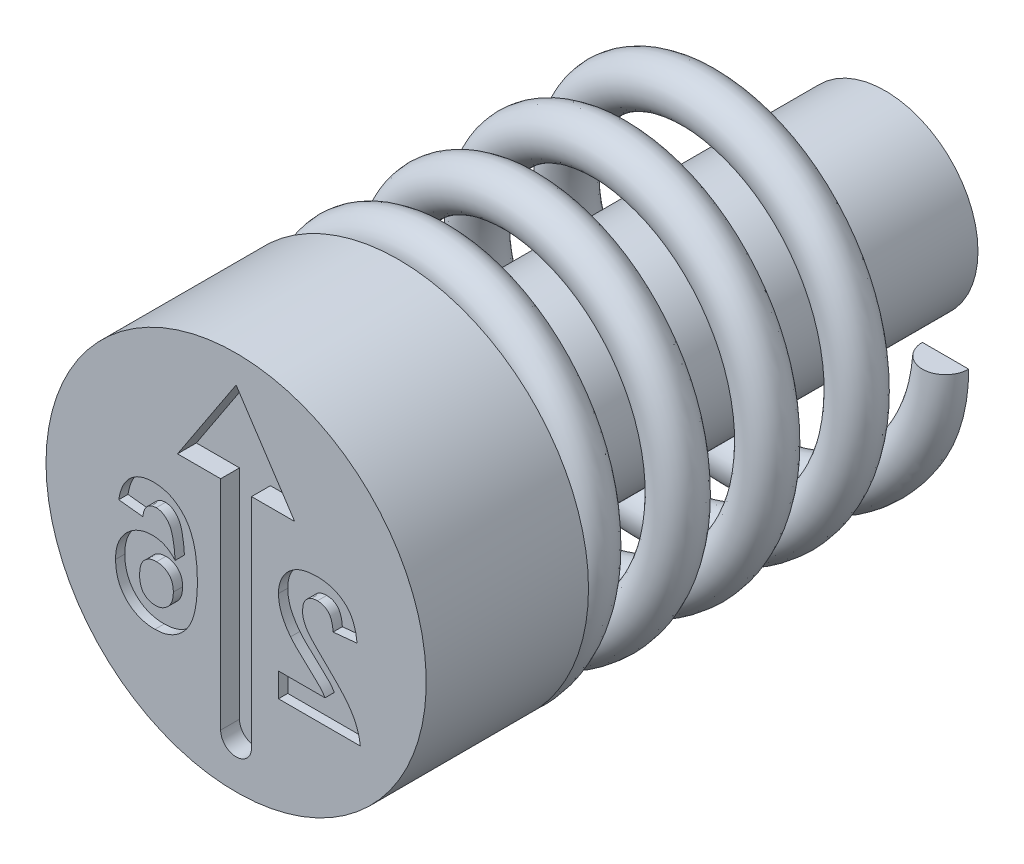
ISO-10303-21;
HEADER;
FILE_DESCRIPTION(('STEP AP214'),'2;1');
FILE_NAME('part.step','',(''),(''),'','','');
FILE_SCHEMA(('AUTOMOTIVE_DESIGN { 1 0 10303 214 1 1 1 1 }'));
ENDSEC;
DATA;
#1=APPLICATION_CONTEXT('core data for automotive mechanical design processes');
#2=APPLICATION_PROTOCOL_DEFINITION('international standard','automotive_design',2000,#1);
#3=PRODUCT_CONTEXT('',#1,'mechanical');
#4=PRODUCT('Part','Part','',(#3));
#5=PRODUCT_RELATED_PRODUCT_CATEGORY('part','',(#4));
#6=PRODUCT_DEFINITION_FORMATION('','',#4);
#7=PRODUCT_DEFINITION_CONTEXT('part definition',#1,'design');
#8=PRODUCT_DEFINITION('design','',#6,#7);
#9=PRODUCT_DEFINITION_SHAPE('','',#8);
#10=(LENGTH_UNIT() NAMED_UNIT(*) SI_UNIT(.MILLI.,.METRE.));
#11=(NAMED_UNIT(*) PLANE_ANGLE_UNIT() SI_UNIT($,.RADIAN.));
#12=(NAMED_UNIT(*) SI_UNIT($,.STERADIAN.) SOLID_ANGLE_UNIT());
#13=UNCERTAINTY_MEASURE_WITH_UNIT(LENGTH_MEASURE(1.E-05),#10,'distance_accuracy_value','');
#14=(GEOMETRIC_REPRESENTATION_CONTEXT(3) GLOBAL_UNCERTAINTY_ASSIGNED_CONTEXT((#13)) GLOBAL_UNIT_ASSIGNED_CONTEXT((#10,
#11,#12)) REPRESENTATION_CONTEXT('',''));
#15=CARTESIAN_POINT('',(0.,0.,0.));
#16=DIRECTION('',(0.,0.,1.));
#17=DIRECTION('',(1.,0.,0.));
#18=AXIS2_PLACEMENT_3D('',#15,#16,#17);
#19=CARTESIAN_POINT('',(3.6,0.,-12.2));
#20=DIRECTION('',(0.,-1.,0.));
#21=DIRECTION('',(0.,0.,-1.));
#22=AXIS2_PLACEMENT_3D('',#19,#20,#21);
#23=PLANE('',#22);
#24=CARTESIAN_POINT('',(3.6,0.,-11.7));
#25=DIRECTION('',(0.,1.,0.));
#26=DIRECTION('',(0.,0.,1.));
#27=AXIS2_PLACEMENT_3D('',#24,#25,#26);
#28=CIRCLE('',#27,0.5);
#29=CARTESIAN_POINT('',(3.1,0.,-11.7));
#30=VERTEX_POINT('',#29);
#31=CARTESIAN_POINT('',(4.1,0.,-11.7));
#32=VERTEX_POINT('',#31);
#33=EDGE_CURVE('E98',#30,#32,#28,.T.);
#34=ORIENTED_EDGE('',*,*,#33,.T.);
#35=DIRECTION('',(-1.,0.,0.));
#36=VECTOR('',#35,1.);
#37=CARTESIAN_POINT('',(3.6,0.,-11.7));
#38=LINE('',#37,#36);
#39=EDGE_CURVE('E78',#32,#30,#38,.T.);
#40=ORIENTED_EDGE('',*,*,#39,.T.);
#41=EDGE_LOOP('',(#34,#40));
#42=FACE_BOUND('',#41,.T.);
#43=ADVANCED_FACE('F51',(#42),#23,.F.);
#44=CARTESIAN_POINT('',(-2.78294577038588E-13,-3.6,-3.99999999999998));
#45=DIRECTION('',(-1.,0.,0.));
#46=DIRECTION('',(0.,-1.,0.));
#47=AXIS2_PLACEMENT_3D('',#44,#45,#46);
#48=PLANE('',#47);
#49=DIRECTION('',(0.,-1.,0.));
#50=VECTOR('',#49,1.);
#51=CARTESIAN_POINT('',(-2.78294577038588E-13,-3.6,-3.5));
#52=LINE('',#51,#50);
#53=CARTESIAN_POINT('',(-2.39645639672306E-13,-3.1,-3.5));
#54=VERTEX_POINT('',#53);
#55=CARTESIAN_POINT('',(-3.1694351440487E-13,-4.1,-3.5));
#56=VERTEX_POINT('',#55);
#57=EDGE_CURVE('E71',#54,#56,#52,.T.);
#58=ORIENTED_EDGE('',*,*,#57,.F.);
#59=CARTESIAN_POINT('',(-2.78294577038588E-13,-3.6,-3.49999999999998));
#60=DIRECTION('',(-1.,0.,0.));
#61=DIRECTION('',(0.,-1.,0.));
#62=AXIS2_PLACEMENT_3D('',#59,#60,#61);
#63=CIRCLE('',#62,0.500000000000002);
#64=EDGE_CURVE('E93',#54,#56,#63,.T.);
#65=ORIENTED_EDGE('',*,*,#64,.T.);
#66=EDGE_LOOP('',(#58,#65));
#67=FACE_BOUND('',#66,.T.);
#68=ADVANCED_FACE('F53',(#67),#48,.T.);
#69=CARTESIAN_POINT('',(3.6,0.,-11.2));
#70=CARTESIAN_POINT('',(3.6,-1.16971090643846,-11.1035294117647));
#71=CARTESIAN_POINT('',(2.91246117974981,-2.1160269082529,-11.0070588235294));
#72=CARTESIAN_POINT('',(2.22492235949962,-3.06234291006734,-10.9105882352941));
#73=CARTESIAN_POINT('',(1.11246117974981,-3.42380345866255,-10.8141176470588));
#74=CARTESIAN_POINT('',(0.,-3.78526400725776,-10.7176470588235));
#75=CARTESIAN_POINT('',(-1.11246117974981,-3.42380345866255,-10.6211764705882));
#76=CARTESIAN_POINT('',(-2.22492235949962,-3.06234291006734,-10.5247058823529));
#77=CARTESIAN_POINT('',(-2.91246117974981,-2.1160269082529,-10.4282352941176));
#78=CARTESIAN_POINT('',(-3.6,-1.16971090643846,-10.3317647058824));
#79=CARTESIAN_POINT('',(-3.6,0.,-10.2352941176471));
#80=CARTESIAN_POINT('',(-3.6,1.16971090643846,-10.1388235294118));
#81=CARTESIAN_POINT('',(-2.91246117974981,2.1160269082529,-10.0423529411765));
#82=CARTESIAN_POINT('',(-2.22492235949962,3.06234291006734,-9.94588235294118));
#83=CARTESIAN_POINT('',(-1.11246117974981,3.42380345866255,-9.84941176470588));
#84=CARTESIAN_POINT('',(0.,3.78526400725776,-9.75294117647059));
#85=CARTESIAN_POINT('',(1.11246117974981,3.42380345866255,-9.65647058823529));
#86=CARTESIAN_POINT('',(2.22492235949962,3.06234291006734,-9.56));
#87=CARTESIAN_POINT('',(2.91246117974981,2.1160269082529,-9.4635294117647));
#88=CARTESIAN_POINT('',(3.6,1.16971090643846,-9.36705882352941));
#89=CARTESIAN_POINT('',(3.6,0.,-9.27058823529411));
#90=CARTESIAN_POINT('',(3.6,-1.16971090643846,-9.17411764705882));
#91=CARTESIAN_POINT('',(2.91246117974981,-2.1160269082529,-9.07764705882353));
#92=CARTESIAN_POINT('',(2.22492235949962,-3.06234291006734,-8.98117647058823));
#93=CARTESIAN_POINT('',(1.11246117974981,-3.42380345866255,-8.88470588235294));
#94=CARTESIAN_POINT('',(0.,-3.78526400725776,-8.78823529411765));
#95=CARTESIAN_POINT('',(-1.11246117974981,-3.42380345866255,-8.69176470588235));
#96=CARTESIAN_POINT('',(-2.22492235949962,-3.06234291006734,-8.59529411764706));
#97=CARTESIAN_POINT('',(-2.91246117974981,-2.1160269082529,-8.49882352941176));
#98=CARTESIAN_POINT('',(-3.6,-1.16971090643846,-8.40235294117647));
#99=CARTESIAN_POINT('',(-3.6,0.,-8.30588235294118));
#100=CARTESIAN_POINT('',(-3.6,1.16971090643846,-8.20941176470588));
#101=CARTESIAN_POINT('',(-2.91246117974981,2.1160269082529,-8.11294117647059));
#102=CARTESIAN_POINT('',(-2.22492235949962,3.06234291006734,-8.01647058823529));
#103=CARTESIAN_POINT('',(-1.11246117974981,3.42380345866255,-7.92));
#104=CARTESIAN_POINT('',(0.,3.78526400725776,-7.8235294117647));
#105=CARTESIAN_POINT('',(1.11246117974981,3.42380345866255,-7.72705882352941));
#106=CARTESIAN_POINT('',(2.22492235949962,3.06234291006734,-7.63058823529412));
#107=CARTESIAN_POINT('',(2.91246117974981,2.1160269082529,-7.53411764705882));
#108=CARTESIAN_POINT('',(3.6,1.16971090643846,-7.43764705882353));
#109=CARTESIAN_POINT('',(3.6,0.,-7.34117647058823));
#110=CARTESIAN_POINT('',(3.6,-1.16971090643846,-7.24470588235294));
#111=CARTESIAN_POINT('',(2.91246117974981,-2.1160269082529,-7.14823529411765));
#112=CARTESIAN_POINT('',(2.22492235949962,-3.06234291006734,-7.05176470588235));
#113=CARTESIAN_POINT('',(1.11246117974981,-3.42380345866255,-6.95529411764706));
#114=CARTESIAN_POINT('',(0.,-3.78526400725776,-6.85882352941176));
#115=CARTESIAN_POINT('',(-1.11246117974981,-3.42380345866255,-6.76235294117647));
#116=CARTESIAN_POINT('',(-2.22492235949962,-3.06234291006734,-6.66588235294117));
#117=CARTESIAN_POINT('',(-2.91246117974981,-2.1160269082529,-6.56941176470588));
#118=CARTESIAN_POINT('',(-3.6,-1.16971090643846,-6.47294117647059));
#119=CARTESIAN_POINT('',(-3.6,0.,-6.37647058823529));
#120=CARTESIAN_POINT('',(-3.6,1.16971090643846,-6.28));
#121=CARTESIAN_POINT('',(-2.91246117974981,2.1160269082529,-6.1835294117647));
#122=CARTESIAN_POINT('',(-2.22492235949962,3.06234291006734,-6.08705882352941));
#123=CARTESIAN_POINT('',(-1.11246117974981,3.42380345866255,-5.99058823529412));
#124=CARTESIAN_POINT('',(0.,3.78526400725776,-5.89411764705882));
#125=CARTESIAN_POINT('',(1.11246117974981,3.42380345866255,-5.79764705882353));
#126=CARTESIAN_POINT('',(2.22492235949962,3.06234291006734,-5.70117647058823));
#127=CARTESIAN_POINT('',(2.91246117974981,2.1160269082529,-5.60470588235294));
#128=CARTESIAN_POINT('',(3.6,1.16971090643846,-5.50823529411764));
#129=CARTESIAN_POINT('',(3.6,0.,-5.41176470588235));
#130=CARTESIAN_POINT('',(3.6,-1.16971090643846,-5.31529411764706));
#131=CARTESIAN_POINT('',(2.91246117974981,-2.1160269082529,-5.21882352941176));
#132=CARTESIAN_POINT('',(2.22492235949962,-3.06234291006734,-5.12235294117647));
#133=CARTESIAN_POINT('',(1.11246117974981,-3.42380345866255,-5.02588235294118));
#134=CARTESIAN_POINT('',(0.,-3.78526400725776,-4.92941176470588));
#135=CARTESIAN_POINT('',(-1.11246117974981,-3.42380345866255,-4.83294117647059));
#136=CARTESIAN_POINT('',(-2.22492235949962,-3.06234291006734,-4.73647058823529));
#137=CARTESIAN_POINT('',(-2.91246117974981,-2.1160269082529,-4.64));
#138=CARTESIAN_POINT('',(-3.6,-1.16971090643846,-4.54352941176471));
#139=CARTESIAN_POINT('',(-3.6,0.,-4.44705882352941));
#140=CARTESIAN_POINT('',(-3.6,1.16971090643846,-4.35058823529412));
#141=CARTESIAN_POINT('',(-2.91246117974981,2.1160269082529,-4.25411764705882));
#142=CARTESIAN_POINT('',(-2.22492235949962,3.06234291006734,-4.15764705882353));
#143=CARTESIAN_POINT('',(-1.11246117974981,3.42380345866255,-4.06117647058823));
#144=CARTESIAN_POINT('',(0.,3.78526400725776,-3.96470588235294));
#145=CARTESIAN_POINT('',(1.11246117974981,3.42380345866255,-3.86823529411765));
#146=CARTESIAN_POINT('',(2.22492235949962,3.06234291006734,-3.77176470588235));
#147=CARTESIAN_POINT('',(2.91246117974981,2.1160269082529,-3.67529411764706));
#148=CARTESIAN_POINT('',(3.6,1.16971090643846,-3.57882352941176));
#149=CARTESIAN_POINT('',(3.6,0.,-3.48235294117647));
#150=CARTESIAN_POINT('',(3.6,-1.16971090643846,-3.38588235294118));
#151=CARTESIAN_POINT('',(2.91246117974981,-2.1160269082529,-3.28941176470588));
#152=CARTESIAN_POINT('',(2.22492235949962,-3.06234291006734,-3.19294117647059));
#153=CARTESIAN_POINT('',(1.11246117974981,-3.42380345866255,-3.09647058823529));
#154=CARTESIAN_POINT('',(0.570183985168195,-3.60000000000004,-3.049445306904));
#155=CARTESIAN_POINT('',(-2.78294577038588E-13,-3.6,-2.99999999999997));
#156=CARTESIAN_POINT('',(4.6,0.,-11.2));
#157=CARTESIAN_POINT('',(4.6,-1.49463060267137,-11.1035294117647));
#158=CARTESIAN_POINT('',(3.72147817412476,-2.70381216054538,-11.0070588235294));
#159=CARTESIAN_POINT('',(2.84295634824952,-3.91299371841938,-10.9105882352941));
#160=CARTESIAN_POINT('',(1.42147817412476,-4.37485997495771,-10.8141176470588));
#161=CARTESIAN_POINT('',(0.,-4.83672623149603,-10.7176470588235));
#162=CARTESIAN_POINT('',(-1.42147817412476,-4.37485997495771,-10.6211764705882));
#163=CARTESIAN_POINT('',(-2.84295634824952,-3.91299371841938,-10.5247058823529));
#164=CARTESIAN_POINT('',(-3.72147817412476,-2.70381216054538,-10.4282352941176));
#165=CARTESIAN_POINT('',(-4.6,-1.49463060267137,-10.3317647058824));
#166=CARTESIAN_POINT('',(-4.6,0.,-10.2352941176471));
#167=CARTESIAN_POINT('',(-4.6,1.49463060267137,-10.1388235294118));
#168=CARTESIAN_POINT('',(-3.72147817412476,2.70381216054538,-10.0423529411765));
#169=CARTESIAN_POINT('',(-2.84295634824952,3.91299371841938,-9.94588235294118));
#170=CARTESIAN_POINT('',(-1.42147817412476,4.37485997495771,-9.84941176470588));
#171=CARTESIAN_POINT('',(0.,4.83672623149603,-9.75294117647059));
#172=CARTESIAN_POINT('',(1.42147817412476,4.37485997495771,-9.65647058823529));
#173=CARTESIAN_POINT('',(2.84295634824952,3.91299371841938,-9.56));
#174=CARTESIAN_POINT('',(3.72147817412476,2.70381216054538,-9.4635294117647));
#175=CARTESIAN_POINT('',(4.6,1.49463060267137,-9.36705882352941));
#176=CARTESIAN_POINT('',(4.6,0.,-9.27058823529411));
#177=CARTESIAN_POINT('',(4.6,-1.49463060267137,-9.17411764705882));
#178=CARTESIAN_POINT('',(3.72147817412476,-2.70381216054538,-9.07764705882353));
#179=CARTESIAN_POINT('',(2.84295634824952,-3.91299371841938,-8.98117647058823));
#180=CARTESIAN_POINT('',(1.42147817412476,-4.37485997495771,-8.88470588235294));
#181=CARTESIAN_POINT('',(0.,-4.83672623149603,-8.78823529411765));
#182=CARTESIAN_POINT('',(-1.42147817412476,-4.37485997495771,-8.69176470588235));
#183=CARTESIAN_POINT('',(-2.84295634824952,-3.91299371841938,-8.59529411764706));
#184=CARTESIAN_POINT('',(-3.72147817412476,-2.70381216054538,-8.49882352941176));
#185=CARTESIAN_POINT('',(-4.6,-1.49463060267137,-8.40235294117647));
#186=CARTESIAN_POINT('',(-4.6,0.,-8.30588235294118));
#187=CARTESIAN_POINT('',(-4.6,1.49463060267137,-8.20941176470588));
#188=CARTESIAN_POINT('',(-3.72147817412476,2.70381216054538,-8.11294117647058));
#189=CARTESIAN_POINT('',(-2.84295634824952,3.91299371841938,-8.01647058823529));
#190=CARTESIAN_POINT('',(-1.42147817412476,4.37485997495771,-7.92));
#191=CARTESIAN_POINT('',(0.,4.83672623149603,-7.8235294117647));
#192=CARTESIAN_POINT('',(1.42147817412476,4.37485997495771,-7.72705882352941));
#193=CARTESIAN_POINT('',(2.84295634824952,3.91299371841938,-7.63058823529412));
#194=CARTESIAN_POINT('',(3.72147817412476,2.70381216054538,-7.53411764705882));
#195=CARTESIAN_POINT('',(4.6,1.49463060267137,-7.43764705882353));
#196=CARTESIAN_POINT('',(4.6,0.,-7.34117647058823));
#197=CARTESIAN_POINT('',(4.6,-1.49463060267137,-7.24470588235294));
#198=CARTESIAN_POINT('',(3.72147817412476,-2.70381216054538,-7.14823529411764));
#199=CARTESIAN_POINT('',(2.84295634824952,-3.91299371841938,-7.05176470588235));
#200=CARTESIAN_POINT('',(1.42147817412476,-4.37485997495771,-6.95529411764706));
#201=CARTESIAN_POINT('',(0.,-4.83672623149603,-6.85882352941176));
#202=CARTESIAN_POINT('',(-1.42147817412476,-4.37485997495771,-6.76235294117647));
#203=CARTESIAN_POINT('',(-2.84295634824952,-3.91299371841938,-6.66588235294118));
#204=CARTESIAN_POINT('',(-3.72147817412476,-2.70381216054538,-6.56941176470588));
#205=CARTESIAN_POINT('',(-4.6,-1.49463060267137,-6.47294117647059));
#206=CARTESIAN_POINT('',(-4.6,0.,-6.37647058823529));
#207=CARTESIAN_POINT('',(-4.6,1.49463060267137,-6.28));
#208=CARTESIAN_POINT('',(-3.72147817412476,2.70381216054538,-6.1835294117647));
#209=CARTESIAN_POINT('',(-2.84295634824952,3.91299371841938,-6.08705882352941));
#210=CARTESIAN_POINT('',(-1.42147817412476,4.37485997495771,-5.99058823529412));
#211=CARTESIAN_POINT('',(0.,4.83672623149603,-5.89411764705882));
#212=CARTESIAN_POINT('',(1.42147817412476,4.37485997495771,-5.79764705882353));
#213=CARTESIAN_POINT('',(2.84295634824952,3.91299371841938,-5.70117647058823));
#214=CARTESIAN_POINT('',(3.72147817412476,2.70381216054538,-5.60470588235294));
#215=CARTESIAN_POINT('',(4.6,1.49463060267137,-5.50823529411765));
#216=CARTESIAN_POINT('',(4.6,0.,-5.41176470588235));
#217=CARTESIAN_POINT('',(4.6,-1.49463060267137,-5.31529411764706));
#218=CARTESIAN_POINT('',(3.72147817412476,-2.70381216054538,-5.21882352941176));
#219=CARTESIAN_POINT('',(2.84295634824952,-3.91299371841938,-5.12235294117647));
#220=CARTESIAN_POINT('',(1.42147817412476,-4.37485997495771,-5.02588235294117));
#221=CARTESIAN_POINT('',(0.,-4.83672623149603,-4.92941176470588));
#222=CARTESIAN_POINT('',(-1.42147817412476,-4.37485997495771,-4.83294117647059));
#223=CARTESIAN_POINT('',(-2.84295634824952,-3.91299371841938,-4.73647058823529));
#224=CARTESIAN_POINT('',(-3.72147817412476,-2.70381216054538,-4.64));
#225=CARTESIAN_POINT('',(-4.6,-1.49463060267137,-4.54352941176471));
#226=CARTESIAN_POINT('',(-4.6,0.,-4.44705882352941));
#227=CARTESIAN_POINT('',(-4.6,1.49463060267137,-4.35058823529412));
#228=CARTESIAN_POINT('',(-3.72147817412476,2.70381216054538,-4.25411764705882));
#229=CARTESIAN_POINT('',(-2.84295634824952,3.91299371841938,-4.15764705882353));
#230=CARTESIAN_POINT('',(-1.42147817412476,4.37485997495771,-4.06117647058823));
#231=CARTESIAN_POINT('',(0.,4.83672623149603,-3.96470588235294));
#232=CARTESIAN_POINT('',(1.42147817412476,4.37485997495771,-3.86823529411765));
#233=CARTESIAN_POINT('',(2.84295634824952,3.91299371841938,-3.77176470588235));
#234=CARTESIAN_POINT('',(3.72147817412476,2.70381216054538,-3.67529411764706));
#235=CARTESIAN_POINT('',(4.6,1.49463060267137,-3.57882352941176));
#236=CARTESIAN_POINT('',(4.6,0.,-3.48235294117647));
#237=CARTESIAN_POINT('',(4.6,-1.49463060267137,-3.38588235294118));
#238=CARTESIAN_POINT('',(3.72147817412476,-2.70381216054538,-3.28941176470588));
#239=CARTESIAN_POINT('',(2.84295634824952,-3.91299371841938,-3.19294117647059));
#240=CARTESIAN_POINT('',(1.42147817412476,-4.37485997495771,-3.09647058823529));
#241=CARTESIAN_POINT('',(0.728568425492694,-4.60000000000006,-3.049445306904));
#242=CARTESIAN_POINT('',(-3.55592451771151E-13,-4.6,-2.99999999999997));
#243=CARTESIAN_POINT('',(4.6,0.,-12.2));
#244=CARTESIAN_POINT('',(4.6,-1.49463060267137,-12.1035294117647));
#245=CARTESIAN_POINT('',(3.72147817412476,-2.70381216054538,-12.0070588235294));
#246=CARTESIAN_POINT('',(2.84295634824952,-3.91299371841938,-11.9105882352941));
#247=CARTESIAN_POINT('',(1.42147817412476,-4.37485997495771,-11.8141176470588));
#248=CARTESIAN_POINT('',(0.,-4.83672623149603,-11.7176470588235));
#249=CARTESIAN_POINT('',(-1.42147817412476,-4.37485997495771,-11.6211764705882));
#250=CARTESIAN_POINT('',(-2.84295634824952,-3.91299371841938,-11.5247058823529));
#251=CARTESIAN_POINT('',(-3.72147817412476,-2.70381216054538,-11.4282352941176));
#252=CARTESIAN_POINT('',(-4.6,-1.49463060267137,-11.3317647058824));
#253=CARTESIAN_POINT('',(-4.6,0.,-11.2352941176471));
#254=CARTESIAN_POINT('',(-4.6,1.49463060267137,-11.1388235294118));
#255=CARTESIAN_POINT('',(-3.72147817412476,2.70381216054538,-11.0423529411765));
#256=CARTESIAN_POINT('',(-2.84295634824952,3.91299371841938,-10.9458823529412));
#257=CARTESIAN_POINT('',(-1.42147817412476,4.37485997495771,-10.8494117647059));
#258=CARTESIAN_POINT('',(0.,4.83672623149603,-10.7529411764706));
#259=CARTESIAN_POINT('',(1.42147817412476,4.37485997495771,-10.6564705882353));
#260=CARTESIAN_POINT('',(2.84295634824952,3.91299371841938,-10.56));
#261=CARTESIAN_POINT('',(3.72147817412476,2.70381216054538,-10.4635294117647));
#262=CARTESIAN_POINT('',(4.6,1.49463060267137,-10.3670588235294));
#263=CARTESIAN_POINT('',(4.6,0.,-10.2705882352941));
#264=CARTESIAN_POINT('',(4.6,-1.49463060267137,-10.1741176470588));
#265=CARTESIAN_POINT('',(3.72147817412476,-2.70381216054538,-10.0776470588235));
#266=CARTESIAN_POINT('',(2.84295634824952,-3.91299371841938,-9.98117647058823));
#267=CARTESIAN_POINT('',(1.42147817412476,-4.37485997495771,-9.88470588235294));
#268=CARTESIAN_POINT('',(0.,-4.83672623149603,-9.78823529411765));
#269=CARTESIAN_POINT('',(-1.42147817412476,-4.37485997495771,-9.69176470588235));
#270=CARTESIAN_POINT('',(-2.84295634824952,-3.91299371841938,-9.59529411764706));
#271=CARTESIAN_POINT('',(-3.72147817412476,-2.70381216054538,-9.49882352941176));
#272=CARTESIAN_POINT('',(-4.6,-1.49463060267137,-9.40235294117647));
#273=CARTESIAN_POINT('',(-4.6,0.,-9.30588235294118));
#274=CARTESIAN_POINT('',(-4.6,1.49463060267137,-9.20941176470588));
#275=CARTESIAN_POINT('',(-3.72147817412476,2.70381216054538,-9.11294117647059));
#276=CARTESIAN_POINT('',(-2.84295634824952,3.91299371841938,-9.01647058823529));
#277=CARTESIAN_POINT('',(-1.42147817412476,4.37485997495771,-8.92));
#278=CARTESIAN_POINT('',(0.,4.83672623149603,-8.82352941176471));
#279=CARTESIAN_POINT('',(1.42147817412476,4.37485997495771,-8.72705882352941));
#280=CARTESIAN_POINT('',(2.84295634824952,3.91299371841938,-8.63058823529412));
#281=CARTESIAN_POINT('',(3.72147817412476,2.70381216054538,-8.53411764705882));
#282=CARTESIAN_POINT('',(4.6,1.49463060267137,-8.43764705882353));
#283=CARTESIAN_POINT('',(4.6,0.,-8.34117647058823));
#284=CARTESIAN_POINT('',(4.6,-1.49463060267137,-8.24470588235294));
#285=CARTESIAN_POINT('',(3.72147817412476,-2.70381216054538,-8.14823529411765));
#286=CARTESIAN_POINT('',(2.84295634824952,-3.91299371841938,-8.05176470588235));
#287=CARTESIAN_POINT('',(1.42147817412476,-4.37485997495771,-7.95529411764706));
#288=CARTESIAN_POINT('',(0.,-4.83672623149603,-7.85882352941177));
#289=CARTESIAN_POINT('',(-1.42147817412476,-4.37485997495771,-7.76235294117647));
#290=CARTESIAN_POINT('',(-2.84295634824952,-3.91299371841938,-7.66588235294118));
#291=CARTESIAN_POINT('',(-3.72147817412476,-2.70381216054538,-7.56941176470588));
#292=CARTESIAN_POINT('',(-4.6,-1.49463060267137,-7.47294117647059));
#293=CARTESIAN_POINT('',(-4.6,0.,-7.37647058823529));
#294=CARTESIAN_POINT('',(-4.6,1.49463060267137,-7.28));
#295=CARTESIAN_POINT('',(-3.72147817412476,2.70381216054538,-7.18352941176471));
#296=CARTESIAN_POINT('',(-2.84295634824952,3.91299371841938,-7.08705882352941));
#297=CARTESIAN_POINT('',(-1.42147817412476,4.37485997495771,-6.99058823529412));
#298=CARTESIAN_POINT('',(0.,4.83672623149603,-6.89411764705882));
#299=CARTESIAN_POINT('',(1.42147817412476,4.37485997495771,-6.79764705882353));
#300=CARTESIAN_POINT('',(2.84295634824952,3.91299371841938,-6.70117647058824));
#301=CARTESIAN_POINT('',(3.72147817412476,2.70381216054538,-6.60470588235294));
#302=CARTESIAN_POINT('',(4.6,1.49463060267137,-6.50823529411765));
#303=CARTESIAN_POINT('',(4.6,0.,-6.41176470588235));
#304=CARTESIAN_POINT('',(4.6,-1.49463060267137,-6.31529411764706));
#305=CARTESIAN_POINT('',(3.72147817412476,-2.70381216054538,-6.21882352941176));
#306=CARTESIAN_POINT('',(2.84295634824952,-3.91299371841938,-6.12235294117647));
#307=CARTESIAN_POINT('',(1.42147817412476,-4.37485997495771,-6.02588235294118));
#308=CARTESIAN_POINT('',(0.,-4.83672623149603,-5.92941176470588));
#309=CARTESIAN_POINT('',(-1.42147817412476,-4.37485997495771,-5.83294117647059));
#310=CARTESIAN_POINT('',(-2.84295634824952,-3.91299371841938,-5.73647058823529));
#311=CARTESIAN_POINT('',(-3.72147817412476,-2.70381216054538,-5.64));
#312=CARTESIAN_POINT('',(-4.6,-1.49463060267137,-5.54352941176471));
#313=CARTESIAN_POINT('',(-4.6,0.,-5.44705882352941));
#314=CARTESIAN_POINT('',(-4.6,1.49463060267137,-5.35058823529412));
#315=CARTESIAN_POINT('',(-3.72147817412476,2.70381216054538,-5.25411764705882));
#316=CARTESIAN_POINT('',(-2.84295634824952,3.91299371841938,-5.15764705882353));
#317=CARTESIAN_POINT('',(-1.42147817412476,4.37485997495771,-5.06117647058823));
#318=CARTESIAN_POINT('',(0.,4.83672623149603,-4.96470588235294));
#319=CARTESIAN_POINT('',(1.42147817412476,4.37485997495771,-4.86823529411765));
#320=CARTESIAN_POINT('',(2.84295634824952,3.91299371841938,-4.77176470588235));
#321=CARTESIAN_POINT('',(3.72147817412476,2.70381216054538,-4.67529411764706));
#322=CARTESIAN_POINT('',(4.6,1.49463060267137,-4.57882352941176));
#323=CARTESIAN_POINT('',(4.6,0.,-4.48235294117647));
#324=CARTESIAN_POINT('',(4.6,-1.49463060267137,-4.38588235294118));
#325=CARTESIAN_POINT('',(3.72147817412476,-2.70381216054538,-4.28941176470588));
#326=CARTESIAN_POINT('',(2.84295634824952,-3.91299371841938,-4.19294117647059));
#327=CARTESIAN_POINT('',(1.42147817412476,-4.37485997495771,-4.09647058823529));
#328=CARTESIAN_POINT('',(0.728568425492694,-4.60000000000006,-4.049445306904));
#329=CARTESIAN_POINT('',(-3.55592451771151E-13,-4.6,-3.99999999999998));
#330=CARTESIAN_POINT('',(3.6,0.,-12.2));
#331=CARTESIAN_POINT('',(3.6,-1.16971090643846,-12.1035294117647));
#332=CARTESIAN_POINT('',(2.91246117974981,-2.1160269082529,-12.0070588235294));
#333=CARTESIAN_POINT('',(2.22492235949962,-3.06234291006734,-11.9105882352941));
#334=CARTESIAN_POINT('',(1.11246117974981,-3.42380345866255,-11.8141176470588));
#335=CARTESIAN_POINT('',(0.,-3.78526400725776,-11.7176470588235));
#336=CARTESIAN_POINT('',(-1.11246117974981,-3.42380345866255,-11.6211764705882));
#337=CARTESIAN_POINT('',(-2.22492235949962,-3.06234291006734,-11.5247058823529));
#338=CARTESIAN_POINT('',(-2.91246117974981,-2.1160269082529,-11.4282352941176));
#339=CARTESIAN_POINT('',(-3.6,-1.16971090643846,-11.3317647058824));
#340=CARTESIAN_POINT('',(-3.6,0.,-11.2352941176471));
#341=CARTESIAN_POINT('',(-3.6,1.16971090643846,-11.1388235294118));
#342=CARTESIAN_POINT('',(-2.91246117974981,2.1160269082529,-11.0423529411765));
#343=CARTESIAN_POINT('',(-2.22492235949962,3.06234291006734,-10.9458823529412));
#344=CARTESIAN_POINT('',(-1.11246117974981,3.42380345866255,-10.8494117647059));
#345=CARTESIAN_POINT('',(0.,3.78526400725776,-10.7529411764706));
#346=CARTESIAN_POINT('',(1.11246117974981,3.42380345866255,-10.6564705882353));
#347=CARTESIAN_POINT('',(2.22492235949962,3.06234291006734,-10.56));
#348=CARTESIAN_POINT('',(2.91246117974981,2.1160269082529,-10.4635294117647));
#349=CARTESIAN_POINT('',(3.6,1.16971090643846,-10.3670588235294));
#350=CARTESIAN_POINT('',(3.6,0.,-10.2705882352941));
#351=CARTESIAN_POINT('',(3.6,-1.16971090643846,-10.1741176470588));
#352=CARTESIAN_POINT('',(2.91246117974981,-2.1160269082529,-10.0776470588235));
#353=CARTESIAN_POINT('',(2.22492235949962,-3.06234291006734,-9.98117647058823));
#354=CARTESIAN_POINT('',(1.11246117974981,-3.42380345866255,-9.88470588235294));
#355=CARTESIAN_POINT('',(0.,-3.78526400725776,-9.78823529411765));
#356=CARTESIAN_POINT('',(-1.11246117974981,-3.42380345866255,-9.69176470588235));
#357=CARTESIAN_POINT('',(-2.22492235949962,-3.06234291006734,-9.59529411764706));
#358=CARTESIAN_POINT('',(-2.91246117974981,-2.1160269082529,-9.49882352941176));
#359=CARTESIAN_POINT('',(-3.6,-1.16971090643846,-9.40235294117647));
#360=CARTESIAN_POINT('',(-3.6,0.,-9.30588235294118));
#361=CARTESIAN_POINT('',(-3.6,1.16971090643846,-9.20941176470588));
#362=CARTESIAN_POINT('',(-2.91246117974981,2.1160269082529,-9.11294117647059));
#363=CARTESIAN_POINT('',(-2.22492235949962,3.06234291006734,-9.01647058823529));
#364=CARTESIAN_POINT('',(-1.11246117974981,3.42380345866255,-8.92));
#365=CARTESIAN_POINT('',(0.,3.78526400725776,-8.82352941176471));
#366=CARTESIAN_POINT('',(1.11246117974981,3.42380345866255,-8.72705882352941));
#367=CARTESIAN_POINT('',(2.22492235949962,3.06234291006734,-8.63058823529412));
#368=CARTESIAN_POINT('',(2.91246117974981,2.1160269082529,-8.53411764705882));
#369=CARTESIAN_POINT('',(3.6,1.16971090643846,-8.43764705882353));
#370=CARTESIAN_POINT('',(3.6,0.,-8.34117647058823));
#371=CARTESIAN_POINT('',(3.6,-1.16971090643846,-8.24470588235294));
#372=CARTESIAN_POINT('',(2.91246117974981,-2.1160269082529,-8.14823529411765));
#373=CARTESIAN_POINT('',(2.22492235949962,-3.06234291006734,-8.05176470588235));
#374=CARTESIAN_POINT('',(1.11246117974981,-3.42380345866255,-7.95529411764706));
#375=CARTESIAN_POINT('',(0.,-3.78526400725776,-7.85882352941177));
#376=CARTESIAN_POINT('',(-1.11246117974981,-3.42380345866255,-7.76235294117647));
#377=CARTESIAN_POINT('',(-2.22492235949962,-3.06234291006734,-7.66588235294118));
#378=CARTESIAN_POINT('',(-2.91246117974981,-2.1160269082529,-7.56941176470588));
#379=CARTESIAN_POINT('',(-3.6,-1.16971090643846,-7.47294117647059));
#380=CARTESIAN_POINT('',(-3.6,0.,-7.37647058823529));
#381=CARTESIAN_POINT('',(-3.6,1.16971090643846,-7.28));
#382=CARTESIAN_POINT('',(-2.91246117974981,2.1160269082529,-7.18352941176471));
#383=CARTESIAN_POINT('',(-2.22492235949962,3.06234291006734,-7.08705882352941));
#384=CARTESIAN_POINT('',(-1.11246117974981,3.42380345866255,-6.99058823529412));
#385=CARTESIAN_POINT('',(0.,3.78526400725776,-6.89411764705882));
#386=CARTESIAN_POINT('',(1.11246117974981,3.42380345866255,-6.79764705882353));
#387=CARTESIAN_POINT('',(2.22492235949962,3.06234291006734,-6.70117647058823));
#388=CARTESIAN_POINT('',(2.91246117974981,2.1160269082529,-6.60470588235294));
#389=CARTESIAN_POINT('',(3.6,1.16971090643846,-6.50823529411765));
#390=CARTESIAN_POINT('',(3.6,0.,-6.41176470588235));
#391=CARTESIAN_POINT('',(3.6,-1.16971090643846,-6.31529411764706));
#392=CARTESIAN_POINT('',(2.91246117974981,-2.1160269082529,-6.21882352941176));
#393=CARTESIAN_POINT('',(2.22492235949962,-3.06234291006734,-6.12235294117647));
#394=CARTESIAN_POINT('',(1.11246117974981,-3.42380345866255,-6.02588235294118));
#395=CARTESIAN_POINT('',(0.,-3.78526400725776,-5.92941176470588));
#396=CARTESIAN_POINT('',(-1.11246117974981,-3.42380345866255,-5.83294117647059));
#397=CARTESIAN_POINT('',(-2.22492235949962,-3.06234291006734,-5.73647058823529));
#398=CARTESIAN_POINT('',(-2.91246117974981,-2.1160269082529,-5.64));
#399=CARTESIAN_POINT('',(-3.6,-1.16971090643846,-5.54352941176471));
#400=CARTESIAN_POINT('',(-3.6,0.,-5.44705882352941));
#401=CARTESIAN_POINT('',(-3.6,1.16971090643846,-5.35058823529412));
#402=CARTESIAN_POINT('',(-2.91246117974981,2.1160269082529,-5.25411764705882));
#403=CARTESIAN_POINT('',(-2.22492235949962,3.06234291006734,-5.15764705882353));
#404=CARTESIAN_POINT('',(-1.11246117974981,3.42380345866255,-5.06117647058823));
#405=CARTESIAN_POINT('',(0.,3.78526400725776,-4.96470588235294));
#406=CARTESIAN_POINT('',(1.11246117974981,3.42380345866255,-4.86823529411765));
#407=CARTESIAN_POINT('',(2.22492235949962,3.06234291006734,-4.77176470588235));
#408=CARTESIAN_POINT('',(2.91246117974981,2.1160269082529,-4.67529411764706));
#409=CARTESIAN_POINT('',(3.6,1.16971090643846,-4.57882352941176));
#410=CARTESIAN_POINT('',(3.6,0.,-4.48235294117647));
#411=CARTESIAN_POINT('',(3.6,-1.16971090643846,-4.38588235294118));
#412=CARTESIAN_POINT('',(2.91246117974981,-2.1160269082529,-4.28941176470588));
#413=CARTESIAN_POINT('',(2.22492235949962,-3.06234291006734,-4.19294117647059));
#414=CARTESIAN_POINT('',(1.11246117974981,-3.42380345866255,-4.09647058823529));
#415=CARTESIAN_POINT('',(0.570183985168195,-3.60000000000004,-4.049445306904));
#416=CARTESIAN_POINT('',(-2.78294577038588E-13,-3.6,-3.99999999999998));
#417=CARTESIAN_POINT('',(2.6,0.,-12.2));
#418=CARTESIAN_POINT('',(2.6,-0.844791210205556,-12.1035294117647));
#419=CARTESIAN_POINT('',(2.10344418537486,-1.52824165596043,-12.0070588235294));
#420=CARTESIAN_POINT('',(1.60688837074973,-2.2116921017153,-11.9105882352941));
#421=CARTESIAN_POINT('',(0.803444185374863,-2.4727469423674,-11.8141176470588));
#422=CARTESIAN_POINT('',(0.,-2.73380178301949,-11.7176470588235));
#423=CARTESIAN_POINT('',(-0.803444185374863,-2.4727469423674,-11.6211764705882));
#424=CARTESIAN_POINT('',(-1.60688837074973,-2.2116921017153,-11.5247058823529));
#425=CARTESIAN_POINT('',(-2.10344418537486,-1.52824165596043,-11.4282352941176));
#426=CARTESIAN_POINT('',(-2.6,-0.844791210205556,-11.3317647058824));
#427=CARTESIAN_POINT('',(-2.6,0.,-11.2352941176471));
#428=CARTESIAN_POINT('',(-2.6,0.844791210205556,-11.1388235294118));
#429=CARTESIAN_POINT('',(-2.10344418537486,1.52824165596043,-11.0423529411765));
#430=CARTESIAN_POINT('',(-1.60688837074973,2.2116921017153,-10.9458823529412));
#431=CARTESIAN_POINT('',(-0.803444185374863,2.4727469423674,-10.8494117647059));
#432=CARTESIAN_POINT('',(0.,2.73380178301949,-10.7529411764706));
#433=CARTESIAN_POINT('',(0.803444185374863,2.4727469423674,-10.6564705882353));
#434=CARTESIAN_POINT('',(1.60688837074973,2.2116921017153,-10.56));
#435=CARTESIAN_POINT('',(2.10344418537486,1.52824165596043,-10.4635294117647));
#436=CARTESIAN_POINT('',(2.6,0.844791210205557,-10.3670588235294));
#437=CARTESIAN_POINT('',(2.6,0.,-10.2705882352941));
#438=CARTESIAN_POINT('',(2.6,-0.844791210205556,-10.1741176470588));
#439=CARTESIAN_POINT('',(2.10344418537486,-1.52824165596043,-10.0776470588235));
#440=CARTESIAN_POINT('',(1.60688837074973,-2.2116921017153,-9.98117647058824));
#441=CARTESIAN_POINT('',(0.803444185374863,-2.4727469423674,-9.88470588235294));
#442=CARTESIAN_POINT('',(0.,-2.73380178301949,-9.78823529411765));
#443=CARTESIAN_POINT('',(-0.803444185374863,-2.4727469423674,-9.69176470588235));
#444=CARTESIAN_POINT('',(-1.60688837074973,-2.2116921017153,-9.59529411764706));
#445=CARTESIAN_POINT('',(-2.10344418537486,-1.52824165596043,-9.49882352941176));
#446=CARTESIAN_POINT('',(-2.6,-0.844791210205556,-9.40235294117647));
#447=CARTESIAN_POINT('',(-2.6,0.,-9.30588235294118));
#448=CARTESIAN_POINT('',(-2.6,0.844791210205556,-9.20941176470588));
#449=CARTESIAN_POINT('',(-2.10344418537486,1.52824165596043,-9.11294117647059));
#450=CARTESIAN_POINT('',(-1.60688837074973,2.2116921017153,-9.01647058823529));
#451=CARTESIAN_POINT('',(-0.803444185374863,2.4727469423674,-8.92));
#452=CARTESIAN_POINT('',(0.,2.73380178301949,-8.82352941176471));
#453=CARTESIAN_POINT('',(0.803444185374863,2.4727469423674,-8.72705882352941));
#454=CARTESIAN_POINT('',(1.60688837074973,2.2116921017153,-8.63058823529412));
#455=CARTESIAN_POINT('',(2.10344418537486,1.52824165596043,-8.53411764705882));
#456=CARTESIAN_POINT('',(2.6,0.844791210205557,-8.43764705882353));
#457=CARTESIAN_POINT('',(2.6,0.,-8.34117647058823));
#458=CARTESIAN_POINT('',(2.6,-0.844791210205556,-8.24470588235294));
#459=CARTESIAN_POINT('',(2.10344418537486,-1.52824165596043,-8.14823529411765));
#460=CARTESIAN_POINT('',(1.60688837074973,-2.2116921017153,-8.05176470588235));
#461=CARTESIAN_POINT('',(0.803444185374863,-2.4727469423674,-7.95529411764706));
#462=CARTESIAN_POINT('',(0.,-2.73380178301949,-7.85882352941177));
#463=CARTESIAN_POINT('',(-0.803444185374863,-2.4727469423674,-7.76235294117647));
#464=CARTESIAN_POINT('',(-1.60688837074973,-2.2116921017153,-7.66588235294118));
#465=CARTESIAN_POINT('',(-2.10344418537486,-1.52824165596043,-7.56941176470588));
#466=CARTESIAN_POINT('',(-2.6,-0.844791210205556,-7.47294117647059));
#467=CARTESIAN_POINT('',(-2.6,0.,-7.37647058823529));
#468=CARTESIAN_POINT('',(-2.6,0.844791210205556,-7.28));
#469=CARTESIAN_POINT('',(-2.10344418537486,1.52824165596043,-7.18352941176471));
#470=CARTESIAN_POINT('',(-1.60688837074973,2.2116921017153,-7.08705882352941));
#471=CARTESIAN_POINT('',(-0.803444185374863,2.4727469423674,-6.99058823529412));
#472=CARTESIAN_POINT('',(0.,2.73380178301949,-6.89411764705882));
#473=CARTESIAN_POINT('',(0.803444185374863,2.4727469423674,-6.79764705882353));
#474=CARTESIAN_POINT('',(1.60688837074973,2.2116921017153,-6.70117647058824));
#475=CARTESIAN_POINT('',(2.10344418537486,1.52824165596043,-6.60470588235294));
#476=CARTESIAN_POINT('',(2.6,0.844791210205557,-6.50823529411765));
#477=CARTESIAN_POINT('',(2.6,0.,-6.41176470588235));
#478=CARTESIAN_POINT('',(2.6,-0.844791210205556,-6.31529411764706));
#479=CARTESIAN_POINT('',(2.10344418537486,-1.52824165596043,-6.21882352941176));
#480=CARTESIAN_POINT('',(1.60688837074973,-2.2116921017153,-6.12235294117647));
#481=CARTESIAN_POINT('',(0.803444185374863,-2.4727469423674,-6.02588235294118));
#482=CARTESIAN_POINT('',(0.,-2.73380178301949,-5.92941176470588));
#483=CARTESIAN_POINT('',(-0.803444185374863,-2.4727469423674,-5.83294117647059));
#484=CARTESIAN_POINT('',(-1.60688837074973,-2.2116921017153,-5.73647058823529));
#485=CARTESIAN_POINT('',(-2.10344418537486,-1.52824165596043,-5.64));
#486=CARTESIAN_POINT('',(-2.6,-0.844791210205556,-5.54352941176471));
#487=CARTESIAN_POINT('',(-2.6,0.,-5.44705882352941));
#488=CARTESIAN_POINT('',(-2.6,0.844791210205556,-5.35058823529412));
#489=CARTESIAN_POINT('',(-2.10344418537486,1.52824165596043,-5.25411764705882));
#490=CARTESIAN_POINT('',(-1.60688837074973,2.2116921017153,-5.15764705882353));
#491=CARTESIAN_POINT('',(-0.803444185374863,2.4727469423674,-5.06117647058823));
#492=CARTESIAN_POINT('',(0.,2.73380178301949,-4.96470588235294));
#493=CARTESIAN_POINT('',(0.803444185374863,2.4727469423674,-4.86823529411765));
#494=CARTESIAN_POINT('',(1.60688837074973,2.2116921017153,-4.77176470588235));
#495=CARTESIAN_POINT('',(2.10344418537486,1.52824165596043,-4.67529411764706));
#496=CARTESIAN_POINT('',(2.6,0.844791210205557,-4.57882352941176));
#497=CARTESIAN_POINT('',(2.6,0.,-4.48235294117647));
#498=CARTESIAN_POINT('',(2.6,-0.844791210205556,-4.38588235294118));
#499=CARTESIAN_POINT('',(2.10344418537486,-1.52824165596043,-4.28941176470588));
#500=CARTESIAN_POINT('',(1.60688837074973,-2.2116921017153,-4.19294117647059));
#501=CARTESIAN_POINT('',(0.803444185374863,-2.4727469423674,-4.09647058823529));
#502=CARTESIAN_POINT('',(0.411799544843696,-2.60000000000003,-4.049445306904));
#503=CARTESIAN_POINT('',(-2.01052272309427E-13,-2.6,-3.99999999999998));
#504=CARTESIAN_POINT('',(2.6,0.,-11.2));
#505=CARTESIAN_POINT('',(2.6,-0.844791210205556,-11.1035294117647));
#506=CARTESIAN_POINT('',(2.10344418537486,-1.52824165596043,-11.0070588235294));
#507=CARTESIAN_POINT('',(1.60688837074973,-2.2116921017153,-10.9105882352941));
#508=CARTESIAN_POINT('',(0.803444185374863,-2.4727469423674,-10.8141176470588));
#509=CARTESIAN_POINT('',(0.,-2.73380178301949,-10.7176470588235));
#510=CARTESIAN_POINT('',(-0.803444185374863,-2.4727469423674,-10.6211764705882));
#511=CARTESIAN_POINT('',(-1.60688837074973,-2.2116921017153,-10.5247058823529));
#512=CARTESIAN_POINT('',(-2.10344418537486,-1.52824165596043,-10.4282352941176));
#513=CARTESIAN_POINT('',(-2.6,-0.844791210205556,-10.3317647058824));
#514=CARTESIAN_POINT('',(-2.6,0.,-10.2352941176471));
#515=CARTESIAN_POINT('',(-2.6,0.844791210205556,-10.1388235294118));
#516=CARTESIAN_POINT('',(-2.10344418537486,1.52824165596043,-10.0423529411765));
#517=CARTESIAN_POINT('',(-1.60688837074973,2.2116921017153,-9.94588235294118));
#518=CARTESIAN_POINT('',(-0.803444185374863,2.4727469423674,-9.84941176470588));
#519=CARTESIAN_POINT('',(0.,2.73380178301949,-9.75294117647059));
#520=CARTESIAN_POINT('',(0.803444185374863,2.4727469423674,-9.65647058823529));
#521=CARTESIAN_POINT('',(1.60688837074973,2.2116921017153,-9.56));
#522=CARTESIAN_POINT('',(2.10344418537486,1.52824165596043,-9.4635294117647));
#523=CARTESIAN_POINT('',(2.6,0.844791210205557,-9.36705882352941));
#524=CARTESIAN_POINT('',(2.6,0.,-9.27058823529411));
#525=CARTESIAN_POINT('',(2.6,-0.844791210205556,-9.17411764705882));
#526=CARTESIAN_POINT('',(2.10344418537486,-1.52824165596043,-9.07764705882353));
#527=CARTESIAN_POINT('',(1.60688837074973,-2.2116921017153,-8.98117647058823));
#528=CARTESIAN_POINT('',(0.803444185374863,-2.4727469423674,-8.88470588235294));
#529=CARTESIAN_POINT('',(0.,-2.73380178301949,-8.78823529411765));
#530=CARTESIAN_POINT('',(-0.803444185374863,-2.4727469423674,-8.69176470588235));
#531=CARTESIAN_POINT('',(-1.60688837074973,-2.2116921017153,-8.59529411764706));
#532=CARTESIAN_POINT('',(-2.10344418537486,-1.52824165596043,-8.49882352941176));
#533=CARTESIAN_POINT('',(-2.6,-0.844791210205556,-8.40235294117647));
#534=CARTESIAN_POINT('',(-2.6,0.,-8.30588235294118));
#535=CARTESIAN_POINT('',(-2.6,0.844791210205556,-8.20941176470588));
#536=CARTESIAN_POINT('',(-2.10344418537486,1.52824165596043,-8.11294117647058));
#537=CARTESIAN_POINT('',(-1.60688837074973,2.2116921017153,-8.01647058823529));
#538=CARTESIAN_POINT('',(-0.803444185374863,2.4727469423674,-7.92));
#539=CARTESIAN_POINT('',(0.,2.73380178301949,-7.8235294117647));
#540=CARTESIAN_POINT('',(0.803444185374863,2.4727469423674,-7.72705882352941));
#541=CARTESIAN_POINT('',(1.60688837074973,2.2116921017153,-7.63058823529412));
#542=CARTESIAN_POINT('',(2.10344418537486,1.52824165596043,-7.53411764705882));
#543=CARTESIAN_POINT('',(2.6,0.844791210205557,-7.43764705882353));
#544=CARTESIAN_POINT('',(2.6,0.,-7.34117647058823));
#545=CARTESIAN_POINT('',(2.6,-0.844791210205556,-7.24470588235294));
#546=CARTESIAN_POINT('',(2.10344418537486,-1.52824165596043,-7.14823529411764));
#547=CARTESIAN_POINT('',(1.60688837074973,-2.2116921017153,-7.05176470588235));
#548=CARTESIAN_POINT('',(0.803444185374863,-2.4727469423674,-6.95529411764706));
#549=CARTESIAN_POINT('',(0.,-2.73380178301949,-6.85882352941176));
#550=CARTESIAN_POINT('',(-0.803444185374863,-2.4727469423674,-6.76235294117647));
#551=CARTESIAN_POINT('',(-1.60688837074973,-2.2116921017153,-6.66588235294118));
#552=CARTESIAN_POINT('',(-2.10344418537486,-1.52824165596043,-6.56941176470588));
#553=CARTESIAN_POINT('',(-2.6,-0.844791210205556,-6.47294117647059));
#554=CARTESIAN_POINT('',(-2.6,0.,-6.37647058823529));
#555=CARTESIAN_POINT('',(-2.6,0.844791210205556,-6.28));
#556=CARTESIAN_POINT('',(-2.10344418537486,1.52824165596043,-6.1835294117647));
#557=CARTESIAN_POINT('',(-1.60688837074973,2.2116921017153,-6.08705882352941));
#558=CARTESIAN_POINT('',(-0.803444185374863,2.4727469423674,-5.99058823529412));
#559=CARTESIAN_POINT('',(0.,2.73380178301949,-5.89411764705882));
#560=CARTESIAN_POINT('',(0.803444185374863,2.4727469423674,-5.79764705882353));
#561=CARTESIAN_POINT('',(1.60688837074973,2.2116921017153,-5.70117647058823));
#562=CARTESIAN_POINT('',(2.10344418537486,1.52824165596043,-5.60470588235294));
#563=CARTESIAN_POINT('',(2.6,0.844791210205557,-5.50823529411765));
#564=CARTESIAN_POINT('',(2.6,0.,-5.41176470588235));
#565=CARTESIAN_POINT('',(2.6,-0.844791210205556,-5.31529411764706));
#566=CARTESIAN_POINT('',(2.10344418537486,-1.52824165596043,-5.21882352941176));
#567=CARTESIAN_POINT('',(1.60688837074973,-2.2116921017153,-5.12235294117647));
#568=CARTESIAN_POINT('',(0.803444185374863,-2.4727469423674,-5.02588235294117));
#569=CARTESIAN_POINT('',(0.,-2.73380178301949,-4.92941176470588));
#570=CARTESIAN_POINT('',(-0.803444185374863,-2.4727469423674,-4.83294117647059));
#571=CARTESIAN_POINT('',(-1.60688837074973,-2.2116921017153,-4.73647058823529));
#572=CARTESIAN_POINT('',(-2.10344418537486,-1.52824165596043,-4.64));
#573=CARTESIAN_POINT('',(-2.6,-0.844791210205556,-4.54352941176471));
#574=CARTESIAN_POINT('',(-2.6,0.,-4.44705882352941));
#575=CARTESIAN_POINT('',(-2.6,0.844791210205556,-4.35058823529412));
#576=CARTESIAN_POINT('',(-2.10344418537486,1.52824165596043,-4.25411764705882));
#577=CARTESIAN_POINT('',(-1.60688837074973,2.2116921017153,-4.15764705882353));
#578=CARTESIAN_POINT('',(-0.803444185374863,2.4727469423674,-4.06117647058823));
#579=CARTESIAN_POINT('',(0.,2.73380178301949,-3.96470588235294));
#580=CARTESIAN_POINT('',(0.803444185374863,2.4727469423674,-3.86823529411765));
#581=CARTESIAN_POINT('',(1.60688837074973,2.2116921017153,-3.77176470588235));
#582=CARTESIAN_POINT('',(2.10344418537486,1.52824165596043,-3.67529411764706));
#583=CARTESIAN_POINT('',(2.6,0.844791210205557,-3.57882352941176));
#584=CARTESIAN_POINT('',(2.6,0.,-3.48235294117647));
#585=CARTESIAN_POINT('',(2.6,-0.844791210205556,-3.38588235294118));
#586=CARTESIAN_POINT('',(2.10344418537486,-1.52824165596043,-3.28941176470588));
#587=CARTESIAN_POINT('',(1.60688837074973,-2.2116921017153,-3.19294117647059));
#588=CARTESIAN_POINT('',(0.803444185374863,-2.4727469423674,-3.09647058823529));
#589=CARTESIAN_POINT('',(0.411799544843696,-2.60000000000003,-3.049445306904));
#590=CARTESIAN_POINT('',(-2.01052272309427E-13,-2.6,-2.99999999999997));
#591=CARTESIAN_POINT('',(3.6,0.,-11.2));
#592=CARTESIAN_POINT('',(3.6,-1.16971090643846,-11.1035294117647));
#593=CARTESIAN_POINT('',(2.91246117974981,-2.1160269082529,-11.0070588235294));
#594=CARTESIAN_POINT('',(2.22492235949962,-3.06234291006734,-10.9105882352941));
#595=CARTESIAN_POINT('',(1.11246117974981,-3.42380345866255,-10.8141176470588));
#596=CARTESIAN_POINT('',(0.,-3.78526400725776,-10.7176470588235));
#597=CARTESIAN_POINT('',(-1.11246117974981,-3.42380345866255,-10.6211764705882));
#598=CARTESIAN_POINT('',(-2.22492235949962,-3.06234291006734,-10.5247058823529));
#599=CARTESIAN_POINT('',(-2.91246117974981,-2.1160269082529,-10.4282352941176));
#600=CARTESIAN_POINT('',(-3.6,-1.16971090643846,-10.3317647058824));
#601=CARTESIAN_POINT('',(-3.6,0.,-10.2352941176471));
#602=CARTESIAN_POINT('',(-3.6,1.16971090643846,-10.1388235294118));
#603=CARTESIAN_POINT('',(-2.91246117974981,2.1160269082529,-10.0423529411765));
#604=CARTESIAN_POINT('',(-2.22492235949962,3.06234291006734,-9.94588235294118));
#605=CARTESIAN_POINT('',(-1.11246117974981,3.42380345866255,-9.84941176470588));
#606=CARTESIAN_POINT('',(0.,3.78526400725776,-9.75294117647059));
#607=CARTESIAN_POINT('',(1.11246117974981,3.42380345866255,-9.65647058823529));
#608=CARTESIAN_POINT('',(2.22492235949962,3.06234291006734,-9.56));
#609=CARTESIAN_POINT('',(2.91246117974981,2.1160269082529,-9.4635294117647));
#610=CARTESIAN_POINT('',(3.6,1.16971090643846,-9.36705882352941));
#611=CARTESIAN_POINT('',(3.6,0.,-9.27058823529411));
#612=CARTESIAN_POINT('',(3.6,-1.16971090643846,-9.17411764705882));
#613=CARTESIAN_POINT('',(2.91246117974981,-2.1160269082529,-9.07764705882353));
#614=CARTESIAN_POINT('',(2.22492235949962,-3.06234291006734,-8.98117647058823));
#615=CARTESIAN_POINT('',(1.11246117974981,-3.42380345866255,-8.88470588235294));
#616=CARTESIAN_POINT('',(0.,-3.78526400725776,-8.78823529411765));
#617=CARTESIAN_POINT('',(-1.11246117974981,-3.42380345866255,-8.69176470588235));
#618=CARTESIAN_POINT('',(-2.22492235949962,-3.06234291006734,-8.59529411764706));
#619=CARTESIAN_POINT('',(-2.91246117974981,-2.1160269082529,-8.49882352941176));
#620=CARTESIAN_POINT('',(-3.6,-1.16971090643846,-8.40235294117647));
#621=CARTESIAN_POINT('',(-3.6,0.,-8.30588235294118));
#622=CARTESIAN_POINT('',(-3.6,1.16971090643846,-8.20941176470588));
#623=CARTESIAN_POINT('',(-2.91246117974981,2.1160269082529,-8.11294117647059));
#624=CARTESIAN_POINT('',(-2.22492235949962,3.06234291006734,-8.01647058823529));
#625=CARTESIAN_POINT('',(-1.11246117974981,3.42380345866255,-7.92));
#626=CARTESIAN_POINT('',(0.,3.78526400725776,-7.8235294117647));
#627=CARTESIAN_POINT('',(1.11246117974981,3.42380345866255,-7.72705882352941));
#628=CARTESIAN_POINT('',(2.22492235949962,3.06234291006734,-7.63058823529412));
#629=CARTESIAN_POINT('',(2.91246117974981,2.1160269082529,-7.53411764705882));
#630=CARTESIAN_POINT('',(3.6,1.16971090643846,-7.43764705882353));
#631=CARTESIAN_POINT('',(3.6,0.,-7.34117647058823));
#632=CARTESIAN_POINT('',(3.6,-1.16971090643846,-7.24470588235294));
#633=CARTESIAN_POINT('',(2.91246117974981,-2.1160269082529,-7.14823529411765));
#634=CARTESIAN_POINT('',(2.22492235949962,-3.06234291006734,-7.05176470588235));
#635=CARTESIAN_POINT('',(1.11246117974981,-3.42380345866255,-6.95529411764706));
#636=CARTESIAN_POINT('',(0.,-3.78526400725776,-6.85882352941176));
#637=CARTESIAN_POINT('',(-1.11246117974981,-3.42380345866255,-6.76235294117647));
#638=CARTESIAN_POINT('',(-2.22492235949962,-3.06234291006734,-6.66588235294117));
#639=CARTESIAN_POINT('',(-2.91246117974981,-2.1160269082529,-6.56941176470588));
#640=CARTESIAN_POINT('',(-3.6,-1.16971090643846,-6.47294117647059));
#641=CARTESIAN_POINT('',(-3.6,0.,-6.37647058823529));
#642=CARTESIAN_POINT('',(-3.6,1.16971090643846,-6.28));
#643=CARTESIAN_POINT('',(-2.91246117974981,2.1160269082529,-6.1835294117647));
#644=CARTESIAN_POINT('',(-2.22492235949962,3.06234291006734,-6.08705882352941));
#645=CARTESIAN_POINT('',(-1.11246117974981,3.42380345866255,-5.99058823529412));
#646=CARTESIAN_POINT('',(0.,3.78526400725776,-5.89411764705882));
#647=CARTESIAN_POINT('',(1.11246117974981,3.42380345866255,-5.79764705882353));
#648=CARTESIAN_POINT('',(2.22492235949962,3.06234291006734,-5.70117647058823));
#649=CARTESIAN_POINT('',(2.91246117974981,2.1160269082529,-5.60470588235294));
#650=CARTESIAN_POINT('',(3.6,1.16971090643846,-5.50823529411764));
#651=CARTESIAN_POINT('',(3.6,0.,-5.41176470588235));
#652=CARTESIAN_POINT('',(3.6,-1.16971090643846,-5.31529411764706));
#653=CARTESIAN_POINT('',(2.91246117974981,-2.1160269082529,-5.21882352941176));
#654=CARTESIAN_POINT('',(2.22492235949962,-3.06234291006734,-5.12235294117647));
#655=CARTESIAN_POINT('',(1.11246117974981,-3.42380345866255,-5.02588235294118));
#656=CARTESIAN_POINT('',(0.,-3.78526400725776,-4.92941176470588));
#657=CARTESIAN_POINT('',(-1.11246117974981,-3.42380345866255,-4.83294117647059));
#658=CARTESIAN_POINT('',(-2.22492235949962,-3.06234291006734,-4.73647058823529));
#659=CARTESIAN_POINT('',(-2.91246117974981,-2.1160269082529,-4.64));
#660=CARTESIAN_POINT('',(-3.6,-1.16971090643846,-4.54352941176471));
#661=CARTESIAN_POINT('',(-3.6,0.,-4.44705882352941));
#662=CARTESIAN_POINT('',(-3.6,1.16971090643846,-4.35058823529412));
#663=CARTESIAN_POINT('',(-2.91246117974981,2.1160269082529,-4.25411764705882));
#664=CARTESIAN_POINT('',(-2.22492235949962,3.06234291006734,-4.15764705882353));
#665=CARTESIAN_POINT('',(-1.11246117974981,3.42380345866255,-4.06117647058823));
#666=CARTESIAN_POINT('',(0.,3.78526400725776,-3.96470588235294));
#667=CARTESIAN_POINT('',(1.11246117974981,3.42380345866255,-3.86823529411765));
#668=CARTESIAN_POINT('',(2.22492235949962,3.06234291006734,-3.77176470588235));
#669=CARTESIAN_POINT('',(2.91246117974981,2.1160269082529,-3.67529411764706));
#670=CARTESIAN_POINT('',(3.6,1.16971090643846,-3.57882352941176));
#671=CARTESIAN_POINT('',(3.6,0.,-3.48235294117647));
#672=CARTESIAN_POINT('',(3.6,-1.16971090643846,-3.38588235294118));
#673=CARTESIAN_POINT('',(2.91246117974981,-2.1160269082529,-3.28941176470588));
#674=CARTESIAN_POINT('',(2.22492235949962,-3.06234291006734,-3.19294117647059));
#675=CARTESIAN_POINT('',(1.11246117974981,-3.42380345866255,-3.09647058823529));
#676=CARTESIAN_POINT('',(0.570183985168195,-3.60000000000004,-3.049445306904));
#677=CARTESIAN_POINT('',(-2.78294577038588E-13,-3.6,-2.99999999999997));
#678=(BOUNDED_SURFACE() B_SPLINE_SURFACE(3,2,((#69,#70,#71,#72,#73,#74,#75,#76,#77,#78,#79,#80,
#81,#82,#83,#84,#85,#86,#87,#88,#89,#90,#91,#92,#93,#94,#95,#96,#97,#98,#99,#100,#101,#102,#103,
#104,#105,#106,#107,#108,#109,#110,#111,#112,#113,#114,#115,#116,#117,#118,#119,#120,#121,#122,
#123,#124,#125,#126,#127,#128,#129,#130,#131,#132,#133,#134,#135,#136,#137,#138,#139,#140,#141,
#142,#143,#144,#145,#146,#147,#148,#149,#150,#151,#152,#153,#154,#155),(#156,#157,#158,#159,
#160,#161,#162,#163,#164,#165,#166,#167,#168,#169,#170,#171,#172,#173,#174,#175,#176,#177,#178,
#179,#180,#181,#182,#183,#184,#185,#186,#187,#188,#189,#190,#191,#192,#193,#194,#195,#196,#197,
#198,#199,#200,#201,#202,#203,#204,#205,#206,#207,#208,#209,#210,#211,#212,#213,#214,#215,#216,
#217,#218,#219,#220,#221,#222,#223,#224,#225,#226,#227,#228,#229,#230,#231,#232,#233,#234,#235,
#236,#237,#238,#239,#240,#241,#242),(#243,#244,#245,#246,#247,#248,#249,#250,#251,#252,#253,
#254,#255,#256,#257,#258,#259,#260,#261,#262,#263,#264,#265,#266,#267,#268,#269,#270,#271,#272,
#273,#274,#275,#276,#277,#278,#279,#280,#281,#282,#283,#284,#285,#286,#287,#288,#289,#290,#291,
#292,#293,#294,#295,#296,#297,#298,#299,#300,#301,#302,#303,#304,#305,#306,#307,#308,#309,#310,
#311,#312,#313,#314,#315,#316,#317,#318,#319,#320,#321,#322,#323,#324,#325,#326,#327,#328,#329),
(#330,#331,#332,#333,#334,#335,#336,#337,#338,#339,#340,#341,#342,#343,#344,#345,#346,#347,#348,
#349,#350,#351,#352,#353,#354,#355,#356,#357,#358,#359,#360,#361,#362,#363,#364,#365,#366,#367,
#368,#369,#370,#371,#372,#373,#374,#375,#376,#377,#378,#379,#380,#381,#382,#383,#384,#385,#386,
#387,#388,#389,#390,#391,#392,#393,#394,#395,#396,#397,#398,#399,#400,#401,#402,#403,#404,#405,
#406,#407,#408,#409,#410,#411,#412,#413,#414,#415,#416),(#417,#418,#419,#420,#421,#422,#423,
#424,#425,#426,#427,#428,#429,#430,#431,#432,#433,#434,#435,#436,#437,#438,#439,#440,#441,#442,
#443,#444,#445,#446,#447,#448,#449,#450,#451,#452,#453,#454,#455,#456,#457,#458,#459,#460,#461,
#462,#463,#464,#465,#466,#467,#468,#469,#470,#471,#472,#473,#474,#475,#476,#477,#478,#479,#480,
#481,#482,#483,#484,#485,#486,#487,#488,#489,#490,#491,#492,#493,#494,#495,#496,#497,#498,#499,
#500,#501,#502,#503),(#504,#505,#506,#507,#508,#509,#510,#511,#512,#513,#514,#515,#516,#517,
#518,#519,#520,#521,#522,#523,#524,#525,#526,#527,#528,#529,#530,#531,#532,#533,#534,#535,#536,
#537,#538,#539,#540,#541,#542,#543,#544,#545,#546,#547,#548,#549,#550,#551,#552,#553,#554,#555,
#556,#557,#558,#559,#560,#561,#562,#563,#564,#565,#566,#567,#568,#569,#570,#571,#572,#573,#574,
#575,#576,#577,#578,#579,#580,#581,#582,#583,#584,#585,#586,#587,#588,#589,#590),(#591,#592,
#593,#594,#595,#596,#597,#598,#599,#600,#601,#602,#603,#604,#605,#606,#607,#608,#609,#610,#611,
#612,#613,#614,#615,#616,#617,#618,#619,#620,#621,#622,#623,#624,#625,#626,#627,#628,#629,#630,
#631,#632,#633,#634,#635,#636,#637,#638,#639,#640,#641,#642,#643,#644,#645,#646,#647,#648,#649,
#650,#651,#652,#653,#654,#655,#656,#657,#658,#659,#660,#661,#662,#663,#664,#665,#666,#667,#668,
#669,#670,#671,#672,#673,#674,#675,#676,#677)),.UNSPECIFIED.,.T.,.F.,
.F.) B_SPLINE_SURFACE_WITH_KNOTS((4,3,4),(3,2,2,2,2,2,2,2,2,2,2,2,2,2,2,2,2,2,2,2,2,2,2,2,2,2,2,
2,2,2,2,2,2,2,2,2,2,2,2,2,2,2,2,3),(0.,0.5,1.),(0.,0.02,0.04,0.06,0.08,0.1,0.12,0.14,0.16,0.18,
0.2,0.22,0.24,0.26,0.28,0.3,0.32,0.34,0.36,0.38,0.4,0.42,0.44,0.46,0.48,0.5,0.52,0.54,0.56,0.58,
0.6,0.62,0.64,0.66,0.68,0.7,0.72,0.74,0.76,0.78,0.8,0.82,0.84,0.850000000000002),
.UNSPECIFIED.) GEOMETRIC_REPRESENTATION_ITEM() RATIONAL_B_SPLINE_SURFACE(((1.,0.951056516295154,
1.,0.951056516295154,1.,0.951056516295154,1.,0.951056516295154,1.,0.951056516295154,1.,
0.951056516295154,1.,0.951056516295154,1.,0.951056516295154,1.,0.951056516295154,1.,
0.951056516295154,1.,0.951056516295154,1.,0.951056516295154,1.,0.951056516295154,1.,
0.951056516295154,1.,0.951056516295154,1.,0.951056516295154,1.,0.951056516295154,1.,
0.951056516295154,1.,0.951056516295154,1.,0.951056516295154,1.,0.951056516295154,1.,
0.951056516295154,1.,0.951056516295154,1.,0.951056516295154,1.,0.951056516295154,1.,
0.951056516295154,1.,0.951056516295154,1.,0.951056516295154,1.,0.951056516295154,1.,
0.951056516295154,1.,0.951056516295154,1.,0.951056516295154,1.,0.951056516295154,1.,
0.951056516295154,1.,0.951056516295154,1.,0.951056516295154,1.,0.951056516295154,1.,
0.951056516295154,1.,0.951056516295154,1.,0.951056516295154,1.,0.951056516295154,1.,
0.951056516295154,1.,0.975528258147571,0.975528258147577),(0.333333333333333,0.317018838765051,
0.333333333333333,0.317018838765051,0.333333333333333,0.317018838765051,0.333333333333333,
0.317018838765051,0.333333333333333,0.317018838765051,0.333333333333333,0.317018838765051,
0.333333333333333,0.317018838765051,0.333333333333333,0.317018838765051,0.333333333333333,
0.317018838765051,0.333333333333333,0.317018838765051,0.333333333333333,0.317018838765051,
0.333333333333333,0.317018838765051,0.333333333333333,0.317018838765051,0.333333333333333,
0.317018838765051,0.333333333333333,0.317018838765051,0.333333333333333,0.317018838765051,
0.333333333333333,0.317018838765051,0.333333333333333,0.317018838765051,0.333333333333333,
0.317018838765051,0.333333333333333,0.317018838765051,0.333333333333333,0.317018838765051,
0.333333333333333,0.317018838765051,0.333333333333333,0.317018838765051,0.333333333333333,
0.317018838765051,0.333333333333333,0.317018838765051,0.333333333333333,0.317018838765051,
0.333333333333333,0.317018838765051,0.333333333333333,0.317018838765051,0.333333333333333,
0.317018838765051,0.333333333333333,0.317018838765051,0.333333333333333,0.317018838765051,
0.333333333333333,0.317018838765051,0.333333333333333,0.317018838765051,0.333333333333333,
0.317018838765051,0.333333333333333,0.317018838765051,0.333333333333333,0.317018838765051,
0.333333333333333,0.317018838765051,0.333333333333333,0.317018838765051,0.333333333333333,
0.317018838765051,0.333333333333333,0.317018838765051,0.333333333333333,0.317018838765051,
0.333333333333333,0.317018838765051,0.333333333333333,0.32517608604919,0.325176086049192),
(0.333333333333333,0.317018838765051,0.333333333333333,0.317018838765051,0.333333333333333,
0.317018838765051,0.333333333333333,0.317018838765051,0.333333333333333,0.317018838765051,
0.333333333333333,0.317018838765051,0.333333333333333,0.317018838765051,0.333333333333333,
0.317018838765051,0.333333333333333,0.317018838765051,0.333333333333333,0.317018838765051,
0.333333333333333,0.317018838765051,0.333333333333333,0.317018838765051,0.333333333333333,
0.317018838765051,0.333333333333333,0.317018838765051,0.333333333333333,0.317018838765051,
0.333333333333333,0.317018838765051,0.333333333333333,0.317018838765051,0.333333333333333,
0.317018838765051,0.333333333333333,0.317018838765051,0.333333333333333,0.317018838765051,
0.333333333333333,0.317018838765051,0.333333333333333,0.317018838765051,0.333333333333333,
0.317018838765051,0.333333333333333,0.317018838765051,0.333333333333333,0.317018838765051,
0.333333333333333,0.317018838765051,0.333333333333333,0.317018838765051,0.333333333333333,
0.317018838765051,0.333333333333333,0.317018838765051,0.333333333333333,0.317018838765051,
0.333333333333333,0.317018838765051,0.333333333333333,0.317018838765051,0.333333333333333,
0.317018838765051,0.333333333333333,0.317018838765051,0.333333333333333,0.317018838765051,
0.333333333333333,0.317018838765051,0.333333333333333,0.317018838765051,0.333333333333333,
0.317018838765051,0.333333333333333,0.317018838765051,0.333333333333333,0.317018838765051,
0.333333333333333,0.317018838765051,0.333333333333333,0.317018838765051,0.333333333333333,
0.32517608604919,0.325176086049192),(1.,0.951056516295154,1.,0.951056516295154,1.,
0.951056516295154,1.,0.951056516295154,1.,0.951056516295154,1.,0.951056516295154,1.,
0.951056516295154,1.,0.951056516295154,1.,0.951056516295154,1.,0.951056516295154,1.,
0.951056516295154,1.,0.951056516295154,1.,0.951056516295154,1.,0.951056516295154,1.,
0.951056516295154,1.,0.951056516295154,1.,0.951056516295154,1.,0.951056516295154,1.,
0.951056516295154,1.,0.951056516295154,1.,0.951056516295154,1.,0.951056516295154,1.,
0.951056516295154,1.,0.951056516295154,1.,0.951056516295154,1.,0.951056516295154,1.,
0.951056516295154,1.,0.951056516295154,1.,0.951056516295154,1.,0.951056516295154,1.,
0.951056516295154,1.,0.951056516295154,1.,0.951056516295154,1.,0.951056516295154,1.,
0.951056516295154,1.,0.951056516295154,1.,0.951056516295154,1.,0.951056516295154,1.,
0.951056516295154,1.,0.951056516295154,1.,0.951056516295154,1.,0.951056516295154,1.,
0.975528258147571,0.975528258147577),(0.333333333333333,0.317018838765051,0.333333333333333,
0.317018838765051,0.333333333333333,0.317018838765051,0.333333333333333,0.317018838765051,
0.333333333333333,0.317018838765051,0.333333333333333,0.317018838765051,0.333333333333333,
0.317018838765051,0.333333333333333,0.317018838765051,0.333333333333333,0.317018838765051,
0.333333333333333,0.317018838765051,0.333333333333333,0.317018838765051,0.333333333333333,
0.317018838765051,0.333333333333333,0.317018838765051,0.333333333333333,0.317018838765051,
0.333333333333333,0.317018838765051,0.333333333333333,0.317018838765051,0.333333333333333,
0.317018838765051,0.333333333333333,0.317018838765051,0.333333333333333,0.317018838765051,
0.333333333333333,0.317018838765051,0.333333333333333,0.317018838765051,0.333333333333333,
0.317018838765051,0.333333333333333,0.317018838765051,0.333333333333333,0.317018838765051,
0.333333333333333,0.317018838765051,0.333333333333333,0.317018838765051,0.333333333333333,
0.317018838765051,0.333333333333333,0.317018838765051,0.333333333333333,0.317018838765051,
0.333333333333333,0.317018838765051,0.333333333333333,0.317018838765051,0.333333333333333,
0.317018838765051,0.333333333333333,0.317018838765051,0.333333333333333,0.317018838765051,
0.333333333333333,0.317018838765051,0.333333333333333,0.317018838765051,0.333333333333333,
0.317018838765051,0.333333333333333,0.317018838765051,0.333333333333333,0.317018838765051,
0.333333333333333,0.317018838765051,0.333333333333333,0.317018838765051,0.333333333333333,
0.317018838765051,0.333333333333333,0.32517608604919,0.325176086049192),(0.333333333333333,
0.317018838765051,0.333333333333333,0.317018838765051,0.333333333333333,0.317018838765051,
0.333333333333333,0.317018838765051,0.333333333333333,0.317018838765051,0.333333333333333,
0.317018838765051,0.333333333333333,0.317018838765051,0.333333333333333,0.317018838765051,
0.333333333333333,0.317018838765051,0.333333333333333,0.317018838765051,0.333333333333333,
0.317018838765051,0.333333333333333,0.317018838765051,0.333333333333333,0.317018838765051,
0.333333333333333,0.317018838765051,0.333333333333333,0.317018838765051,0.333333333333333,
0.317018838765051,0.333333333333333,0.317018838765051,0.333333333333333,0.317018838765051,
0.333333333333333,0.317018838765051,0.333333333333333,0.317018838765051,0.333333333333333,
0.317018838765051,0.333333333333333,0.317018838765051,0.333333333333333,0.317018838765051,
0.333333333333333,0.317018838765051,0.333333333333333,0.317018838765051,0.333333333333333,
0.317018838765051,0.333333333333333,0.317018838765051,0.333333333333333,0.317018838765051,
0.333333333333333,0.317018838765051,0.333333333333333,0.317018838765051,0.333333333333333,
0.317018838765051,0.333333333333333,0.317018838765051,0.333333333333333,0.317018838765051,
0.333333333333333,0.317018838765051,0.333333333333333,0.317018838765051,0.333333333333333,
0.317018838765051,0.333333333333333,0.317018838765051,0.333333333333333,0.317018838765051,
0.333333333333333,0.317018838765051,0.333333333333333,0.317018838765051,0.333333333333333,
0.317018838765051,0.333333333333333,0.317018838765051,0.333333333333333,0.32517608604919,
0.325176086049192),(1.,0.951056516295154,1.,0.951056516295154,1.,0.951056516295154,1.,
0.951056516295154,1.,0.951056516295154,1.,0.951056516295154,1.,0.951056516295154,1.,
0.951056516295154,1.,0.951056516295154,1.,0.951056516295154,1.,0.951056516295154,1.,
0.951056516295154,1.,0.951056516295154,1.,0.951056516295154,1.,0.951056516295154,1.,
0.951056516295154,1.,0.951056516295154,1.,0.951056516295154,1.,0.951056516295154,1.,
0.951056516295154,1.,0.951056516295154,1.,0.951056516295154,1.,0.951056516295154,1.,
0.951056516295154,1.,0.951056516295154,1.,0.951056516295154,1.,0.951056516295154,1.,
0.951056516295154,1.,0.951056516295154,1.,0.951056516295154,1.,0.951056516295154,1.,
0.951056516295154,1.,0.951056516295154,1.,0.951056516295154,1.,0.951056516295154,1.,
0.951056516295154,1.,0.951056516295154,1.,0.951056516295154,1.,0.951056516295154,1.,
0.951056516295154,1.,0.951056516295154,1.,0.951056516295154,1.,0.975528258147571,0.975528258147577))) REPRESENTATION_ITEM('') SURFACE());
#679=CARTESIAN_POINT('',(3.1,0.,-11.7));
#680=CARTESIAN_POINT('',(3.10000472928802,-0.0840369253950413,-11.7));
#681=CARTESIAN_POINT('',(3.09677706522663,-0.168068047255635,-11.7));
#682=CARTESIAN_POINT('',(3.08392718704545,-0.335631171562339,-11.7));
#683=CARTESIAN_POINT('',(3.07430566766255,-0.419163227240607,-11.7));
#684=CARTESIAN_POINT('',(3.04875463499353,-0.585152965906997,-11.7));
#685=CARTESIAN_POINT('',(3.03283320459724,-0.667611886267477,-11.7));
#686=CARTESIAN_POINT('',(2.99480853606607,-0.831068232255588,-11.7));
#687=CARTESIAN_POINT('',(2.97270512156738,-0.912065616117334,-11.7));
#688=CARTESIAN_POINT('',(2.89726616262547,-1.15225882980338,-11.7));
#689=CARTESIAN_POINT('',(2.83479007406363,-1.30873216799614,-11.7));
#690=CARTESIAN_POINT('',(2.72408296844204,-1.53489352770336,-11.7));
#691=CARTESIAN_POINT('',(2.68432623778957,-1.60888793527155,-11.7));
#692=CARTESIAN_POINT('',(2.5993038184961,-1.75367479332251,-11.7));
#693=CARTESIAN_POINT('',(2.55403768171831,-1.82446698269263,-11.7));
#694=CARTESIAN_POINT('',(2.4528712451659,-1.97051904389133,-11.7));
#695=CARTESIAN_POINT('',(2.39634649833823,-2.04534586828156,-11.7));
#696=CARTESIAN_POINT('',(2.27743849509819,-2.19019436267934,-11.7));
#697=CARTESIAN_POINT('',(2.21505485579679,-2.26021571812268,-11.7));
#698=CARTESIAN_POINT('',(2.08487074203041,-2.39507593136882,-11.7));
#699=CARTESIAN_POINT('',(2.01706821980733,-2.45991281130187,-11.7));
#700=CARTESIAN_POINT('',(1.87656605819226,-2.58404442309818,-11.7));
#701=CARTESIAN_POINT('',(1.80386620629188,-2.64333891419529,-11.7));
#702=CARTESIAN_POINT('',(1.65012148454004,-2.75910015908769,-11.7));
#703=CARTESIAN_POINT('',(1.5688385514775,-2.81525061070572,-11.7));
#704=CARTESIAN_POINT('',(1.40204311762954,-2.92086162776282,-11.7));
#705=CARTESIAN_POINT('',(1.31653099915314,-2.97032279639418,-11.7));
#706=CARTESIAN_POINT('',(1.18564248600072,-3.03939169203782,-11.7));
#707=CARTESIAN_POINT('',(1.1415946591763,-3.06155289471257,-11.7));
#708=CARTESIAN_POINT('',(1.05267511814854,-3.10415698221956,-11.7));
#709=CARTESIAN_POINT('',(1.00780338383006,-3.12459982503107,-11.7));
#710=CARTESIAN_POINT('',(0.872189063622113,-3.18361346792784,-11.7));
#711=CARTESIAN_POINT('',(0.780433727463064,-3.21987645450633,-11.7));
#712=CARTESIAN_POINT('',(0.642330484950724,-3.26984429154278,-11.7));
#713=CARTESIAN_POINT('',(0.596709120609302,-3.28561616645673,-11.7));
#714=CARTESIAN_POINT('',(0.505090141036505,-3.31602982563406,-11.7));
#715=CARTESIAN_POINT('',(0.459092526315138,-3.330671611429,-11.7));
#716=CARTESIAN_POINT('',(0.366846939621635,-3.35907715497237,-11.7));
#717=CARTESIAN_POINT('',(0.320599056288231,-3.37284120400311,-11.7));
#718=CARTESIAN_POINT('',(0.227975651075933,-3.39993832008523,-11.7));
#719=CARTESIAN_POINT('',(0.181600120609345,-3.41327135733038,-11.7));
#720=CARTESIAN_POINT('',(0.112660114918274,-3.43348078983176,-11.7));
#721=CARTESIAN_POINT('',(0.0900430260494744,-3.44017340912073,-11.7));
#722=CARTESIAN_POINT('',(0.0449191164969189,-3.45392092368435,-11.7));
#723=CARTESIAN_POINT('',(0.0224122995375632,-3.46097583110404,-11.7));
#724=CARTESIAN_POINT('',(0.,-3.4683351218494,-11.7));
#725=B_SPLINE_CURVE_WITH_KNOTS('',3,(#679,#680,#681,#682,#683,#684,#685,#686,#687,#688,#689,
#690,#691,#692,#693,#694,#695,#696,#697,#698,#699,#700,#701,#702,#703,#704,#705,#706,#707,#708,
#709,#710,#711,#712,#713,#714,#715,#716,#717,#718,#719,#720,#721,#722,#723,#724),.UNSPECIFIED.,
.F.,.F.,(4,2,2,2,2,2,2,2,2,2,2,2,2,2,2,2,2,2,2,2,2,2,4),(0.,0.252038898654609,0.504050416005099,
0.755739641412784,1.00743604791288,1.51059903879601,1.76241227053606,2.01424599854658,
2.29526543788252,2.57630325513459,2.85744778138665,3.13860451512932,3.43465866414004,
3.73068609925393,3.87857986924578,4.0264772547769,4.3222260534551,4.46702784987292,
4.61182945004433,4.75658274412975,4.90134602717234,4.97210330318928,5.04286295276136),.UNSPECIFIED.);
#726=CARTESIAN_POINT('',(0.,-3.46833512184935,-11.7));
#727=VERTEX_POINT('',#726);
#728=EDGE_CURVE('E65',#30,#727,#725,.T.);
#729=CARTESIAN_POINT('',(0.,-3.46833512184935,-11.7));
#730=CARTESIAN_POINT('',(0.,-3.49574314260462,-11.7075122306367));
#731=CARTESIAN_POINT('',(0.,-3.52381438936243,-11.7126341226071));
#732=CARTESIAN_POINT('',(0.,-3.57979801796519,-11.7180042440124));
#733=CARTESIAN_POINT('',(0.,-3.60770039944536,-11.7183568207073));
#734=CARTESIAN_POINT('',(0.,-3.65157483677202,-11.7152451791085));
#735=CARTESIAN_POINT('',(0.,-3.66766840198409,-11.7133117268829));
#736=CARTESIAN_POINT('',(0.,-3.69980072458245,-11.7078597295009));
#737=CARTESIAN_POINT('',(0.,-3.71583603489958,-11.7043208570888));
#738=CARTESIAN_POINT('',(0.,-3.73166487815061,-11.7));
#739=B_SPLINE_CURVE_WITH_KNOTS('',3,(#729,#730,#731,#732,#733,#734,#735,#736,#737,#738),
.UNSPECIFIED.,.F.,.F.,(4,2,2,2,4),(0.,0.0851755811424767,0.16848452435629,0.217042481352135,
0.266233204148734),.UNSPECIFIED.);
#740=CARTESIAN_POINT('',(0.,-3.73166487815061,-11.7));
#741=VERTEX_POINT('',#740);
#742=EDGE_CURVE('E100',#727,#741,#739,.T.);
#743=CARTESIAN_POINT('',(0.,-3.73166487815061,-11.7));
#744=CARTESIAN_POINT('',(0.0201949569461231,-3.7378341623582,-11.7));
#745=CARTESIAN_POINT('',(0.0405538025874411,-3.74343321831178,-11.7));
#746=CARTESIAN_POINT('',(0.0815048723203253,-3.7536498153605,-11.7));
#747=CARTESIAN_POINT('',(0.102096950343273,-3.75826793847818,-11.7));
#748=CARTESIAN_POINT('',(0.143403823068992,-3.7666803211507,-11.7));
#749=CARTESIAN_POINT('',(0.164118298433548,-3.77047617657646,-11.7));
#750=CARTESIAN_POINT('',(0.205669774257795,-3.77734377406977,-11.7));
#751=CARTESIAN_POINT('',(0.226506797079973,-3.78041537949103,-11.7));
#752=CARTESIAN_POINT('',(0.288958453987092,-3.7886229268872,-11.7));
#753=CARTESIAN_POINT('',(0.330702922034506,-3.79278862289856,-11.7));
#754=CARTESIAN_POINT('',(0.414378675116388,-3.79885983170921,-11.7));
#755=CARTESIAN_POINT('',(0.456310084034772,-3.80076351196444,-11.7));
#756=CARTESIAN_POINT('',(0.579693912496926,-3.80333953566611,-11.7));
#757=CARTESIAN_POINT('',(0.661215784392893,-3.80116869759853,-11.7));
#758=CARTESIAN_POINT('',(0.823799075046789,-3.78996812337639,-11.7));
#759=CARTESIAN_POINT('',(0.904860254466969,-3.78093510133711,-11.7));
#760=CARTESIAN_POINT('',(1.02591683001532,-3.76260851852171,-11.7));
#761=CARTESIAN_POINT('',(1.06628355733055,-3.75567931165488,-11.7));
#762=CARTESIAN_POINT('',(1.14670106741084,-3.7402588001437,-11.7));
#763=CARTESIAN_POINT('',(1.18675196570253,-3.73176809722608,-11.7));
#764=CARTESIAN_POINT('',(1.30641219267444,-3.70412527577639,-11.7));
#765=CARTESIAN_POINT('',(1.38552831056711,-3.68280256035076,-11.7));
#766=CARTESIAN_POINT('',(1.54589485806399,-3.63349030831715,-11.7));
#767=CARTESIAN_POINT('',(1.62706048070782,-3.60522575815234,-11.7));
#768=CARTESIAN_POINT('',(1.7871147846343,-3.54289637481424,-11.7));
#769=CARTESIAN_POINT('',(1.86600357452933,-3.50883181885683,-11.7));
#770=CARTESIAN_POINT('',(2.09836955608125,-3.39847426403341,-11.7));
#771=CARTESIAN_POINT('',(2.24797794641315,-3.31388326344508,-11.7));
#772=CARTESIAN_POINT('',(2.55926648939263,-3.10788998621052,-11.7));
#773=CARTESIAN_POINT('',(2.7184081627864,-2.98262427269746,-11.7));
#774=CARTESIAN_POINT('',(2.94043128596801,-2.7768763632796,-11.7));
#775=CARTESIAN_POINT('',(3.01172099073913,-2.70523740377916,-11.7));
#776=CARTESIAN_POINT('',(3.14834568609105,-2.55645608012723,-11.7));
#777=CARTESIAN_POINT('',(3.21368056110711,-2.47931360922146,-11.7));
#778=CARTESIAN_POINT('',(3.34065326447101,-2.3168061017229,-11.7));
#779=CARTESIAN_POINT('',(3.40202344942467,-2.23123235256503,-11.7));
#780=CARTESIAN_POINT('',(3.51763634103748,-2.05539457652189,-11.7));
#781=CARTESIAN_POINT('',(3.57187882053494,-1.96513040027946,-11.7));
#782=CARTESIAN_POINT('',(3.6728495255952,-1.78049756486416,-11.7));
#783=CARTESIAN_POINT('',(3.71957810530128,-1.68612909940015,-11.7));
#784=CARTESIAN_POINT('',(3.80523055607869,-1.49391369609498,-11.7));
#785=CARTESIAN_POINT('',(3.84415425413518,-1.39606668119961,-11.7));
#786=CARTESIAN_POINT('',(3.91556495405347,-1.19294077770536,-11.7));
#787=CARTESIAN_POINT('',(3.94767045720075,-1.08752755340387,-11.7));
#788=CARTESIAN_POINT('',(4.00285246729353,-0.874356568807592,-11.7));
#789=CARTESIAN_POINT('',(4.0259282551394,-0.76659862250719,-11.7));
#790=CARTESIAN_POINT('',(4.06291539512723,-0.549423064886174,-11.7));
#791=CARTESIAN_POINT('',(4.07681855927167,-0.44000405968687,-11.7));
#792=CARTESIAN_POINT('',(4.09536694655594,-0.220389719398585,-11.7));
#793=CARTESIAN_POINT('',(4.10001264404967,-0.110194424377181,-11.7));
#794=CARTESIAN_POINT('',(4.1,0.,-11.7));
#795=B_SPLINE_CURVE_WITH_KNOTS('',3,(#743,#744,#745,#746,#747,#748,#749,#750,#751,#752,#753,
#754,#755,#756,#757,#758,#759,#760,#761,#762,#763,#764,#765,#766,#767,#768,#769,#770,#771,#772,
#773,#774,#775,#776,#777,#778,#779,#780,#781,#782,#783,#784,#785,#786,#787,#788,#789,#790,#791,
#792,#793,#794),.UNSPECIFIED.,.F.,.F.,(4,2,2,2,2,2,2,2,2,2,2,2,2,2,2,2,2,2,2,2,2,2,2,2,2,4),(0.,
0.0633261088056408,0.126614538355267,0.189779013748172,0.252955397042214,0.378730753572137,
0.504607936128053,0.748904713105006,0.993318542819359,1.11616275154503,1.23895972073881,
1.48455590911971,1.74216138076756,1.99975454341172,2.51359783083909,3.11824167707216,
3.42117635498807,3.72411691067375,4.0396856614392,4.35526446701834,4.67082839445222,
4.98639931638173,5.31658240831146,5.64679178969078,5.97729553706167,6.30778234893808),.UNSPECIFIED.);
#796=EDGE_CURVE('E97',#741,#32,#795,.T.);
#797=CARTESIAN_POINT('',(-2.39645639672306E-13,-3.1,-3.5));
#798=CARTESIAN_POINT('',(0.083960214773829,-3.10000681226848,-3.5));
#799=CARTESIAN_POINT('',(0.167919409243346,-3.09680435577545,-3.5));
#800=CARTESIAN_POINT('',(0.33534698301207,-3.08402516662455,-3.5));
#801=CARTESIAN_POINT('',(0.41881538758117,-3.0744487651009,-3.5));
#802=CARTESIAN_POINT('',(0.584678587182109,-3.04898172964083,-3.5));
#803=CARTESIAN_POINT('',(0.667074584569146,-3.03309893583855,-3.5));
#804=CARTESIAN_POINT('',(0.830408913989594,-2.99508160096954,-3.5));
#805=CARTESIAN_POINT('',(0.911347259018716,-2.9729471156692,-3.5));
#806=CARTESIAN_POINT('',(1.07131327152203,-2.92260790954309,-3.5));
#807=CARTESIAN_POINT('',(1.15034103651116,-2.89440349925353,-3.5));
#808=CARTESIAN_POINT('',(1.30604304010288,-2.83217234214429,-3.5));
#809=CARTESIAN_POINT('',(1.38271728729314,-2.79814561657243,-3.5));
#810=CARTESIAN_POINT('',(1.60866172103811,-2.68758496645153,-3.5));
#811=CARTESIAN_POINT('',(1.75391675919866,-2.60255059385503,-3.5));
#812=CARTESIAN_POINT('',(1.96999223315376,-2.4536507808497,-3.5));
#813=CARTESIAN_POINT('',(2.04569904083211,-2.39667439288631,-3.5));
#814=CARTESIAN_POINT('',(2.19215474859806,-2.27663442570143,-3.5));
#815=CARTESIAN_POINT('',(2.26290361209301,-2.21357080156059,-3.5));
#816=CARTESIAN_POINT('',(2.39898456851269,-2.08181312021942,-3.5));
#817=CARTESIAN_POINT('',(2.46431548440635,-2.01311784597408,-3.5));
#818=CARTESIAN_POINT('',(2.5578825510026,-1.90622587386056,-3.5));
#819=CARTESIAN_POINT('',(2.58833686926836,-1.8699489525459,-3.5));
#820=CARTESIAN_POINT('',(2.64780864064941,-1.7962351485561,-3.5));
#821=CARTESIAN_POINT('',(2.67682605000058,-1.75879823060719,-3.5));
#822=CARTESIAN_POINT('',(2.76318780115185,-1.64283453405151,-3.5));
#823=CARTESIAN_POINT('',(2.81819028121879,-1.5625451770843,-3.5));
#824=CARTESIAN_POINT('',(2.92187906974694,-1.39800955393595,-3.5));
#825=CARTESIAN_POINT('',(2.9705654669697,-1.31376334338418,-3.5));
#826=CARTESIAN_POINT('',(3.06159736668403,-1.1420121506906,-3.5));
#827=CARTESIAN_POINT('',(3.1039482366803,-1.05451000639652,-3.5));
#828=CARTESIAN_POINT('',(3.18255149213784,-0.87683043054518,-3.5));
#829=CARTESIAN_POINT('',(3.21880459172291,-0.78665331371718,-3.5));
#830=CARTESIAN_POINT('',(3.26849912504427,-0.651417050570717,-3.5));
#831=CARTESIAN_POINT('',(3.28404984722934,-0.60711652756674,-3.5));
#832=CARTESIAN_POINT('',(3.31400053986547,-0.518133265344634,-3.5));
#833=CARTESIAN_POINT('',(3.32840064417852,-0.47345057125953,-3.5));
#834=CARTESIAN_POINT('',(3.35627545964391,-0.383724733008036,-3.5));
#835=CARTESIAN_POINT('',(3.36974871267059,-0.338681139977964,-3.5));
#836=CARTESIAN_POINT('',(3.39608088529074,-0.248422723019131,-3.5));
#837=CARTESIAN_POINT('',(3.40893988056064,-0.203207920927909,-3.5));
#838=CARTESIAN_POINT('',(3.42828993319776,-0.135388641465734,-3.5));
#839=CARTESIAN_POINT('',(3.43475226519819,-0.112775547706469,-3.5));
#840=CARTESIAN_POINT('',(3.44786133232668,-0.0675870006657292,-3.5));
#841=CARTESIAN_POINT('',(3.45450817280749,-0.045011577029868,-3.5));
#842=CARTESIAN_POINT('',(3.46822193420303,-7.55051744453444E-05,-3.5));
#843=CARTESIAN_POINT('',(3.47528732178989,0.0222856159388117,-3.5));
#844=CARTESIAN_POINT('',(3.49042339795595,0.0666622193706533,-3.5));
#845=CARTESIAN_POINT('',(3.49849283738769,0.0886780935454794,-3.5));
#846=CARTESIAN_POINT('',(3.51055338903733,0.116953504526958,-3.5));
#847=CARTESIAN_POINT('',(3.51353357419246,0.123638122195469,-3.5));
#848=CARTESIAN_POINT('',(3.5198082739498,0.136876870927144,-3.5));
#849=CARTESIAN_POINT('',(3.52310341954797,0.143430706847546,-3.5));
#850=CARTESIAN_POINT('',(3.53038154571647,0.156803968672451,-3.5));
#851=CARTESIAN_POINT('',(3.53439780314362,0.163605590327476,-3.5));
#852=CARTESIAN_POINT('',(3.54314977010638,0.176719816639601,-3.5));
#853=CARTESIAN_POINT('',(3.54788292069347,0.183034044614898,-3.50000000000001));
#854=CARTESIAN_POINT('',(3.5577732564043,0.193944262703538,-3.5000000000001));
#855=CARTESIAN_POINT('',(3.56279627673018,0.198656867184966,-3.50000000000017));
#856=CARTESIAN_POINT('',(3.57421133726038,0.206515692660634,-3.49999999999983));
#857=CARTESIAN_POINT('',(3.58061847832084,0.209643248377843,-3.49999999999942));
#858=CARTESIAN_POINT('',(3.59214333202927,0.212085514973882,-3.5000000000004));
#859=CARTESIAN_POINT('',(3.59705943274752,0.212271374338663,-3.50000000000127));
#860=CARTESIAN_POINT('',(3.60662844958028,0.211014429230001,-3.50000000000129));
#861=CARTESIAN_POINT('',(3.61128212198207,0.20957658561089,-3.50000000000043));
#862=CARTESIAN_POINT('',(3.62308752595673,0.204297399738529,-3.49999999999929));
#863=CARTESIAN_POINT('',(3.62976364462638,0.199483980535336,-3.49999999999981));
#864=CARTESIAN_POINT('',(3.64335322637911,0.18736018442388,-3.50000000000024));
#865=CARTESIAN_POINT('',(3.64993941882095,0.179727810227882,-3.49999999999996));
#866=CARTESIAN_POINT('',(3.66203170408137,0.163612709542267,-3.50000000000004));
#867=CARTESIAN_POINT('',(3.66753107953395,0.155125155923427,-3.50000000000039));
#868=CARTESIAN_POINT('',(3.68100752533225,0.132191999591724,-3.50000000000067));
#869=CARTESIAN_POINT('',(3.68834569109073,0.117379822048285,-3.50000000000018));
#870=CARTESIAN_POINT('',(3.70176207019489,0.0871866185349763,-3.49999999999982));
#871=CARTESIAN_POINT('',(3.70783757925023,0.0718044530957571,-3.49999999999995));
#872=CARTESIAN_POINT('',(3.71905958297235,0.0406717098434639,-3.50000000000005));
#873=CARTESIAN_POINT('',(3.72420415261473,0.0249204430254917,-3.50000000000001));
#874=CARTESIAN_POINT('',(3.73375266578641,-0.00678321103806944,-3.49999999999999));
#875=CARTESIAN_POINT('',(3.73815735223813,-0.0227353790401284,-3.5));
#876=CARTESIAN_POINT('',(3.74903089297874,-0.0651140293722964,-3.50000000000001));
#877=CARTESIAN_POINT('',(3.75500172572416,-0.0916684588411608,-3.5));
#878=CARTESIAN_POINT('',(3.7656454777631,-0.145038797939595,-3.5));
#879=CARTESIAN_POINT('',(3.77031793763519,-0.171854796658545,-3.5));
#880=CARTESIAN_POINT('',(3.78267268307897,-0.252632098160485,-3.5));
#881=CARTESIAN_POINT('',(3.78867582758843,-0.306853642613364,-3.5));
#882=CARTESIAN_POINT('',(3.79697062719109,-0.415600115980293,-3.5));
#883=CARTESIAN_POINT('',(3.79925941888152,-0.470125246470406,-3.5));
#884=CARTESIAN_POINT('',(3.80050026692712,-0.579171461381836,-3.5));
#885=CARTESIAN_POINT('',(3.79945445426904,-0.633692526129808,-3.5));
#886=CARTESIAN_POINT('',(3.79268643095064,-0.776139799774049,-3.5));
#887=CARTESIAN_POINT('',(3.78448052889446,-0.863956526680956,-3.5));
#888=CARTESIAN_POINT('',(3.76068447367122,-1.03860081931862,-3.5));
#889=CARTESIAN_POINT('',(3.74508942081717,-1.12542768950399,-3.5));
#890=CARTESIAN_POINT('',(3.68792037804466,-1.38349265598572,-3.5));
#891=CARTESIAN_POINT('',(3.63595084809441,-1.55251563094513,-3.5));
#892=CARTESIAN_POINT('',(3.50529339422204,-1.8853648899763,-3.5));
#893=CARTESIAN_POINT('',(3.42589067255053,-2.04890855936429,-3.5));
#894=CARTESIAN_POINT('',(3.28912840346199,-2.28378606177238,-3.5));
#895=CARTESIAN_POINT('',(3.24056878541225,-2.36037514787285,-3.5));
#896=CARTESIAN_POINT('',(3.13804328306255,-2.50986800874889,-3.5));
#897=CARTESIAN_POINT('',(3.08407692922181,-2.58277146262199,-3.5));
#898=CARTESIAN_POINT('',(2.96396557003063,-2.73338329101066,-3.5));
#899=CARTESIAN_POINT('',(2.89714159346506,-2.81055177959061,-3.5));
#900=CARTESIAN_POINT('',(2.75751765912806,-2.95924558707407,-3.5));
#901=CARTESIAN_POINT('',(2.68471750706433,-3.03077072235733,-3.5));
#902=CARTESIAN_POINT('',(2.45804957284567,-3.23621936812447,-3.5));
#903=CARTESIAN_POINT('',(2.29582681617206,-3.36112550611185,-3.5));
#904=CARTESIAN_POINT('',(1.9451954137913,-3.58908344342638,-3.5));
#905=CARTESIAN_POINT('',(1.75588683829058,-3.69074328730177,-3.5));
#906=CARTESIAN_POINT('',(1.36306488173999,-3.8614570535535,-3.5));
#907=CARTESIAN_POINT('',(1.15955124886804,-3.93051039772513,-3.5));
#908=CARTESIAN_POINT('',(0.796235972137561,-4.02151508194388,-3.5));
#909=CARTESIAN_POINT('',(0.638268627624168,-4.05093527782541,-3.5));
#910=CARTESIAN_POINT('',(0.399694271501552,-4.08036361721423,-3.5));
#911=CARTESIAN_POINT('',(0.319948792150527,-4.08772272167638,-3.5));
#912=CARTESIAN_POINT('',(0.160140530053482,-4.09754157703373,-3.5));
#913=CARTESIAN_POINT('',(0.0800776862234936,-4.10000033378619,-3.5));
#914=CARTESIAN_POINT('',(-3.16943514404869E-13,-4.1,-3.5));
#915=B_SPLINE_CURVE_WITH_KNOTS('',3,(#797,#798,#799,#800,#801,#802,#803,#804,#805,#806,#807,
#808,#809,#810,#811,#812,#813,#814,#815,#816,#817,#818,#819,#820,#821,#822,#823,#824,#825,#826,
#827,#828,#829,#830,#831,#832,#833,#834,#835,#836,#837,#838,#839,#840,#841,#842,#843,#844,#845,
#846,#847,#848,#849,#850,#851,#852,#853,#854,#855,#856,#857,#858,#859,#860,#861,#862,#863,#864,
#865,#866,#867,#868,#869,#870,#871,#872,#873,#874,#875,#876,#877,#878,#879,#880,#881,#882,#883,
#884,#885,#886,#887,#888,#889,#890,#891,#892,#893,#894,#895,#896,#897,#898,#899,#900,#901,#902,
#903,#904,#905,#906,#907,#908,#909,#910,#911,#912,#913,#914),.UNSPECIFIED.,.F.,.F.,(4,2,2,2,2,2,
2,2,2,2,2,2,2,2,2,2,2,2,2,2,2,2,2,2,2,2,2,2,2,2,2,2,2,2,2,2,2,2,2,2,2,2,2,2,2,2,2,2,2,2,2,2,2,2,
2,2,2,2,4),(0.,0.251817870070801,0.503622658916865,0.755115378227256,1.00660585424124,
1.25808346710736,1.50956016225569,2.01231671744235,2.29630841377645,2.58030220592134,
2.86435753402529,3.00642055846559,3.14848790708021,3.44013205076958,3.73177209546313,
4.02316364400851,4.3145210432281,4.45536018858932,4.59618292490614,4.7372223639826,
4.8782443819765,4.94880005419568,5.01939687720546,5.08974939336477,5.16001524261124,
5.18196625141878,5.2039621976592,5.22763386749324,5.25122295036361,5.2717590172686,
5.2925315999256,5.30697757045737,5.32137952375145,5.34565855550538,5.3757620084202,
5.4060460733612,5.45552522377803,5.50510927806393,5.55479472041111,5.60442997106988,
5.68603807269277,5.76767501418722,5.93116120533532,6.09477336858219,6.25828099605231,
6.52250305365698,6.78690056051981,7.31510018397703,7.85825427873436,8.13010768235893,
8.40198471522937,8.70787440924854,9.01377405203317,9.62515794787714,10.2668788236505,
10.9086110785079,11.3894394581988,11.6295565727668,11.8697223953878),.UNSPECIFIED.);
#916=EDGE_CURVE('E13',#54,#56,#915,.T.);
#917=ORIENTED_EDGE('',*,*,#33,.F.);
#918=ORIENTED_EDGE('',*,*,#728,.T.);
#919=ORIENTED_EDGE('',*,*,#742,.T.);
#920=ORIENTED_EDGE('',*,*,#796,.T.);
#921=EDGE_LOOP('',(#917,#918,#919,#920));
#922=FACE_BOUND('',#921,.T.);
#923=ORIENTED_EDGE('',*,*,#64,.F.);
#924=ORIENTED_EDGE('',*,*,#916,.T.);
#925=EDGE_LOOP('',(#923,#924));
#926=FACE_BOUND('',#925,.T.);
#927=ADVANCED_FACE('F96',(#922,#926),#678,.F.);
#928=CARTESIAN_POINT('',(0.,-4.31099511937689,-11.7));
#929=DIRECTION('',(-1.,0.,0.));
#930=DIRECTION('',(0.,0.,1.));
#931=AXIS2_PLACEMENT_3D('',#928,#929,#930);
#932=PLANE('',#931);
#933=DIRECTION('',(0.,1.,0.));
#934=VECTOR('',#933,1.);
#935=CARTESIAN_POINT('',(0.,-4.31099511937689,-11.7));
#936=LINE('',#935,#934);
#937=EDGE_CURVE('E94',#741,#727,#936,.T.);
#938=ORIENTED_EDGE('',*,*,#937,.F.);
#939=ORIENTED_EDGE('',*,*,#742,.F.);
#940=EDGE_LOOP('',(#938,#939));
#941=FACE_BOUND('',#940,.T.);
#942=ADVANCED_FACE('F123',(#941),#932,.F.);
#943=CARTESIAN_POINT('',(0.,-4.31099511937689,-11.7));
#944=DIRECTION('',(0.,0.,1.));
#945=DIRECTION('',(1.,0.,0.));
#946=AXIS2_PLACEMENT_3D('',#943,#944,#945);
#947=PLANE('',#946);
#948=ORIENTED_EDGE('',*,*,#39,.F.);
#949=ORIENTED_EDGE('',*,*,#796,.F.);
#950=ORIENTED_EDGE('',*,*,#937,.T.);
#951=ORIENTED_EDGE('',*,*,#728,.F.);
#952=EDGE_LOOP('',(#948,#949,#950,#951));
#953=FACE_BOUND('',#952,.T.);
#954=ADVANCED_FACE('F120',(#953),#947,.F.);
#955=CARTESIAN_POINT('',(4.1,-4.31099511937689,-3.5));
#956=DIRECTION('',(0.,0.,-1.));
#957=DIRECTION('',(-1.,0.,0.));
#958=AXIS2_PLACEMENT_3D('',#955,#956,#957);
#959=PLANE('',#958);
#960=ORIENTED_EDGE('',*,*,#57,.T.);
#961=ORIENTED_EDGE('',*,*,#916,.F.);
#962=EDGE_LOOP('',(#960,#961));
#963=FACE_BOUND('',#962,.T.);
#964=ADVANCED_FACE('F88',(#963),#959,.F.);
#965=CLOSED_SHELL('',(#43,#68,#927,#942,#954,#964));
#966=MANIFOLD_SOLID_BREP('B2',#965);
#967=CARTESIAN_POINT('',(2.05,0.,0.));
#968=DIRECTION('',(0.,0.,1.));
#969=DIRECTION('',(1.,0.,0.));
#970=AXIS2_PLACEMENT_3D('',#967,#968,#969);
#971=PLANE('',#970);
#972=CARTESIAN_POINT('',(-1.79001926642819,0.8,0.));
#973=CARTESIAN_POINT('',(-1.8143874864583,0.799561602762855,0.));
#974=CARTESIAN_POINT('',(-1.86202424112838,0.798704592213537,0.));
#975=CARTESIAN_POINT('',(-1.93184276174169,0.789603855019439,0.));
#976=CARTESIAN_POINT('',(-1.99844898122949,0.775687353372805,0.));
#977=CARTESIAN_POINT('',(-2.0620174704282,0.756423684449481,0.));
#978=CARTESIAN_POINT('',(-2.12210066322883,0.730625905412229,0.));
#979=CARTESIAN_POINT('',(-2.17893714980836,0.699198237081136,0.));
#980=CARTESIAN_POINT('',(-2.23271800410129,0.662225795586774,0.));
#981=CARTESIAN_POINT('',(-2.28316339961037,0.619946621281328,0.));
#982=CARTESIAN_POINT('',(-2.32986733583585,0.572232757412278,0.));
#983=CARTESIAN_POINT('',(-2.3720399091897,0.518976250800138,0.));
#984=CARTESIAN_POINT('',(-2.40996040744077,0.460819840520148,0.));
#985=CARTESIAN_POINT('',(-2.44379479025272,0.397811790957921,0.));
#986=CARTESIAN_POINT('',(-2.47217451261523,0.329348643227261,0.));
#987=CARTESIAN_POINT('',(-2.49657156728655,0.255968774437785,0.));
#988=CARTESIAN_POINT('',(-2.51663644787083,0.17751453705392,0.));
#989=CARTESIAN_POINT('',(-2.52614235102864,0.123091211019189,0.));
#990=CARTESIAN_POINT('',(-2.53100484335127,0.0952524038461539,0.));
#991=B_SPLINE_CURVE_WITH_KNOTS('',3,(#972,#973,#974,#975,#976,#977,#978,#979,#980,#981,#982,
#983,#984,#985,#986,#987,#988,#989,#990),.UNSPECIFIED.,.F.,.F.,(4,1,1,1,1,1,1,1,1,1,1,1,1,1,1,1,
4),(0.,0.0647517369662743,0.126581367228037,0.186839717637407,0.245514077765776,
0.302849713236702,0.360345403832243,0.417912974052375,0.476091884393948,0.535068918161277,
0.59510381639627,0.656390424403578,0.719434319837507,0.784953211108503,0.853160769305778,
0.924888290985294,1.),.UNSPECIFIED.);
#992=CARTESIAN_POINT('',(-1.79001926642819,0.8,0.));
#993=VERTEX_POINT('',#992);
#994=CARTESIAN_POINT('',(-2.53100484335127,0.0952524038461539,0.));
#995=VERTEX_POINT('',#994);
#996=EDGE_CURVE('E221',#993,#995,#991,.T.);
#997=ORIENTED_EDGE('',*,*,#996,.F.);
#998=CARTESIAN_POINT('',(-0.834850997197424,-0.586237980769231,0.));
#999=CARTESIAN_POINT('',(-0.83565826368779,-0.527079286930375,0.));
#1000=CARTESIAN_POINT('',(-0.837218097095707,-0.412770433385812,0.));
#1001=CARTESIAN_POINT('',(-0.849769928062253,-0.247724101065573,0.));
#1002=CARTESIAN_POINT('',(-0.869707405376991,-0.0953108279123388,0.));
#1003=CARTESIAN_POINT('',(-0.898751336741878,0.044125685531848,0.));
#1004=CARTESIAN_POINT('',(-0.935900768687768,0.170874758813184,0.));
#1005=CARTESIAN_POINT('',(-0.980938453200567,0.285191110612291,0.));
#1006=CARTESIAN_POINT('',(-1.03499587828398,0.386660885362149,0.));
#1007=CARTESIAN_POINT('',(-1.09784609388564,0.474954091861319,0.));
#1008=CARTESIAN_POINT('',(-1.16699944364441,0.551704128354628,0.));
#1009=CARTESIAN_POINT('',(-1.24130502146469,0.617952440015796,0.));
#1010=CARTESIAN_POINT('',(-1.32047915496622,0.674339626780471,0.));
#1011=CARTESIAN_POINT('',(-1.40451994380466,0.720723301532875,0.));
#1012=CARTESIAN_POINT('',(-1.49411729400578,0.755886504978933,0.));
#1013=CARTESIAN_POINT('',(-1.58842134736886,0.781278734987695,0.));
#1014=CARTESIAN_POINT('',(-1.68759050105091,0.797597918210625,0.));
#1015=CARTESIAN_POINT('',(-1.75551980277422,0.799190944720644,0.));
#1016=CARTESIAN_POINT('',(-1.79001926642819,0.8,0.));
#1017=B_SPLINE_CURVE_WITH_KNOTS('',3,(#998,#999,#1000,#1001,#1002,#1003,#1004,#1005,#1006,#1007,
#1008,#1009,#1010,#1011,#1012,#1013,#1014,#1015,#1016),.UNSPECIFIED.,.F.,.F.,(4,1,1,1,1,1,1,1,1,
1,1,1,1,1,1,1,4),(0.,0.0932311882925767,0.180145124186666,0.260720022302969,0.335343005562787,
0.40439372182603,0.46866345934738,0.528671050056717,0.585123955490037,0.639046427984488,
0.691174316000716,0.741714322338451,0.79194664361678,0.842075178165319,0.893016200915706,
0.945665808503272,1.),.UNSPECIFIED.);
#1018=CARTESIAN_POINT('',(-0.834850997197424,-0.586237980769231,0.));
#1019=VERTEX_POINT('',#1018);
#1020=EDGE_CURVE('E552',#1019,#993,#1017,.T.);
#1021=ORIENTED_EDGE('',*,*,#1020,.F.);
#1022=CARTESIAN_POINT('',(-1.75107695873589,-1.93461538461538,0.));
#1023=CARTESIAN_POINT('',(-1.71839174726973,-1.93370094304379,0.));
#1024=CARTESIAN_POINT('',(-1.65412680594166,-1.93190298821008,0.));
#1025=CARTESIAN_POINT('',(-1.5600500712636,-1.91710673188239,0.));
#1026=CARTESIAN_POINT('',(-1.47060992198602,-1.89207380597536,0.));
#1027=CARTESIAN_POINT('',(-1.38581747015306,-1.85711425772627,0.));
#1028=CARTESIAN_POINT('',(-1.30496794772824,-1.81314055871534,0.));
#1029=CARTESIAN_POINT('',(-1.22881210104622,-1.75851720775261,0.));
#1030=CARTESIAN_POINT('',(-1.15755174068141,-1.69376510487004,0.));
#1031=CARTESIAN_POINT('',(-1.09024433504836,-1.61976114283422,0.));
#1032=CARTESIAN_POINT('',(-1.02899639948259,-1.5342807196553,0.));
#1033=CARTESIAN_POINT('',(-0.976837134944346,-1.43548332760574,0.));
#1034=CARTESIAN_POINT('',(-0.932600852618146,-1.32445099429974,0.));
#1035=CARTESIAN_POINT('',(-0.896586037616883,-1.20089896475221,0.));
#1036=CARTESIAN_POINT('',(-0.86878520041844,-1.06483703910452,0.));
#1037=CARTESIAN_POINT('',(-0.849386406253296,-0.916253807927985,0.));
#1038=CARTESIAN_POINT('',(-0.836501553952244,-0.755394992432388,0.));
#1039=CARTESIAN_POINT('',(-0.835414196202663,-0.643957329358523,0.));
#1040=CARTESIAN_POINT('',(-0.834850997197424,-0.586237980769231,0.));
#1041=B_SPLINE_CURVE_WITH_KNOTS('',3,(#1022,#1023,#1024,#1025,#1026,#1027,#1028,#1029,#1030,
#1031,#1032,#1033,#1034,#1035,#1036,#1037,#1038,#1039,#1040),.UNSPECIFIED.,.F.,.F.,(4,1,1,1,1,1,
1,1,1,1,1,1,1,1,1,1,4),(0.,0.0532594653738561,0.104717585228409,0.154775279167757,
0.20433007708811,0.25391362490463,0.304476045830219,0.356706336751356,0.410596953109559,
0.467274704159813,0.52762561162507,0.59224090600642,0.661798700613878,0.737130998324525,
0.818387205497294,0.905933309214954,1.),.UNSPECIFIED.);
#1042=CARTESIAN_POINT('',(-1.75107695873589,-1.93461538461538,0.));
#1043=VERTEX_POINT('',#1042);
#1044=EDGE_CURVE('E544',#1043,#1019,#1041,.T.);
#1045=ORIENTED_EDGE('',*,*,#1044,.F.);
#1046=CARTESIAN_POINT('',(-2.60023561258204,-1.05408653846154,0.));
#1047=CARTESIAN_POINT('',(-2.59948614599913,-1.08656580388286,0.));
#1048=CARTESIAN_POINT('',(-2.59802450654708,-1.14990815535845,0.));
#1049=CARTESIAN_POINT('',(-2.58726581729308,-1.24267452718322,0.));
#1050=CARTESIAN_POINT('',(-2.56826140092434,-1.3302355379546,0.));
#1051=CARTESIAN_POINT('',(-2.54229726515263,-1.41329369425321,0.));
#1052=CARTESIAN_POINT('',(-2.50871341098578,-1.49119084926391,0.));
#1053=CARTESIAN_POINT('',(-2.46802929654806,-1.56456895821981,0.));
#1054=CARTESIAN_POINT('',(-2.41886813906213,-1.6321740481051,0.));
#1055=CARTESIAN_POINT('',(-2.36346098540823,-1.69491550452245,0.));
#1056=CARTESIAN_POINT('',(-2.30169297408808,-1.75090413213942,0.));
#1057=CARTESIAN_POINT('',(-2.23586581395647,-1.80048272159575,0.));
#1058=CARTESIAN_POINT('',(-2.16524938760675,-1.84169595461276,0.));
#1059=CARTESIAN_POINT('',(-2.09088749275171,-1.8763839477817,0.));
#1060=CARTESIAN_POINT('',(-2.01150291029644,-1.90184038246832,0.));
#1061=CARTESIAN_POINT('',(-1.92849517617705,-1.92093142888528,0.));
#1062=CARTESIAN_POINT('',(-1.84118933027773,-1.93257526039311,0.));
#1063=CARTESIAN_POINT('',(-1.7815816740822,-1.93392476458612,0.));
#1064=CARTESIAN_POINT('',(-1.75107695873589,-1.93461538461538,0.));
#1065=B_SPLINE_CURVE_WITH_KNOTS('',3,(#1046,#1047,#1048,#1049,#1050,#1051,#1052,#1053,#1054,
#1055,#1056,#1057,#1058,#1059,#1060,#1061,#1062,#1063,#1064),.UNSPECIFIED.,.F.,.F.,(4,1,1,1,1,1,
1,1,1,1,1,1,1,1,1,1,4),(0.,0.0708046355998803,0.13808600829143,0.203231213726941,
0.265884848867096,0.327509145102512,0.387868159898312,0.448411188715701,0.509386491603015,
0.570040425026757,0.629864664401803,0.68871511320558,0.747985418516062,0.80839432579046,
0.870086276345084,0.933515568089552,1.),.UNSPECIFIED.);
#1066=CARTESIAN_POINT('',(-2.60023561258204,-1.05408653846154,0.));
#1067=VERTEX_POINT('',#1066);
#1068=EDGE_CURVE('E536',#1067,#1043,#1065,.T.);
#1069=ORIENTED_EDGE('',*,*,#1068,.F.);
#1070=CARTESIAN_POINT('',(-1.80245917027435,-0.203846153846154,0.));
#1071=CARTESIAN_POINT('',(-1.82935311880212,-0.204620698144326,0.));
#1072=CARTESIAN_POINT('',(-1.88245911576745,-0.206150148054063,0.));
#1073=CARTESIAN_POINT('',(-1.96069657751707,-0.216877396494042,0.));
#1074=CARTESIAN_POINT('',(-2.03577056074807,-0.236166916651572,0.));
#1075=CARTESIAN_POINT('',(-2.10802068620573,-0.262260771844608,0.));
#1076=CARTESIAN_POINT('',(-2.17780404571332,-0.295119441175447,0.));
#1077=CARTESIAN_POINT('',(-2.24378575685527,-0.336713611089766,0.));
#1078=CARTESIAN_POINT('',(-2.30700155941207,-0.385210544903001,0.));
#1079=CARTESIAN_POINT('',(-2.36658204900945,-0.440617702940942,0.));
#1080=CARTESIAN_POINT('',(-2.42132219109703,-0.501616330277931,0.));
#1081=CARTESIAN_POINT('',(-2.46965232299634,-0.56749967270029,0.));
#1082=CARTESIAN_POINT('',(-2.5094264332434,-0.638468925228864,0.));
#1083=CARTESIAN_POINT('',(-2.543428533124,-0.712935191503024,0.));
#1084=CARTESIAN_POINT('',(-2.56872739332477,-0.792368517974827,0.));
#1085=CARTESIAN_POINT('',(-2.58709169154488,-0.875625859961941,0.));
#1086=CARTESIAN_POINT('',(-2.59805388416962,-0.96347145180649,0.));
#1087=CARTESIAN_POINT('',(-2.5994969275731,-1.02340627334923,0.));
#1088=CARTESIAN_POINT('',(-2.60023561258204,-1.05408653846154,0.));
#1089=B_SPLINE_CURVE_WITH_KNOTS('',3,(#1070,#1071,#1072,#1073,#1074,#1075,#1076,#1077,#1078,
#1079,#1080,#1081,#1082,#1083,#1084,#1085,#1086,#1087,#1088),.UNSPECIFIED.,.F.,.F.,(4,1,1,1,1,1,
1,1,1,1,1,1,1,1,1,1,4),(0.,0.061959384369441,0.122347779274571,0.181484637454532,
0.240217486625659,0.299114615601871,0.358819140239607,0.419550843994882,0.482449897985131,
0.545990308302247,0.608137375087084,0.670271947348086,0.733113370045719,0.796428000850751,
0.861936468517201,0.9293261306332,1.),.UNSPECIFIED.);
#1090=CARTESIAN_POINT('',(-1.80245917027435,-0.203846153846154,0.));
#1091=VERTEX_POINT('',#1090);
#1092=EDGE_CURVE('E528',#1091,#1067,#1089,.T.);
#1093=ORIENTED_EDGE('',*,*,#1092,.F.);
#1094=CARTESIAN_POINT('',(-1.31459859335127,-0.429927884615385,0.));
#1095=CARTESIAN_POINT('',(-1.33119327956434,-0.411903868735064,0.));
#1096=CARTESIAN_POINT('',(-1.36373371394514,-0.376560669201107,0.));
#1097=CARTESIAN_POINT('',(-1.41772856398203,-0.330481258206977,0.));
#1098=CARTESIAN_POINT('',(-1.47429620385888,-0.291086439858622,0.));
#1099=CARTESIAN_POINT('',(-1.53405216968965,-0.258766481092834,0.));
#1100=CARTESIAN_POINT('',(-1.59732263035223,-0.234714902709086,0.));
#1101=CARTESIAN_POINT('',(-1.6629614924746,-0.216453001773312,0.));
#1102=CARTESIAN_POINT('',(-1.7318279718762,-0.206223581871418,0.));
#1103=CARTESIAN_POINT('',(-1.77862934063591,-0.20464825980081,0.));
#1104=CARTESIAN_POINT('',(-1.80245917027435,-0.203846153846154,0.));
#1105=B_SPLINE_CURVE_WITH_KNOTS('',3,(#1094,#1095,#1096,#1097,#1098,#1099,#1100,#1101,#1102,
#1103,#1104),.UNSPECIFIED.,.F.,.F.,(4,1,1,1,1,1,1,1,4),(0.,0.132218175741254,0.259265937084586,
0.382426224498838,0.503963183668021,0.625109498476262,0.747226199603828,0.871295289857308,1.),.UNSPECIFIED.);
#1106=CARTESIAN_POINT('',(-1.31459859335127,-0.429927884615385,0.));
#1107=VERTEX_POINT('',#1106);
#1108=EDGE_CURVE('E520',#1107,#1091,#1105,.T.);
#1109=ORIENTED_EDGE('',*,*,#1108,.F.);
#1110=CARTESIAN_POINT('',(-1.7234928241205,0.35,0.));
#1111=CARTESIAN_POINT('',(-1.7104706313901,0.34968157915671,0.));
#1112=CARTESIAN_POINT('',(-1.68455712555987,0.349047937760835,0.));
#1113=CARTESIAN_POINT('',(-1.6468109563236,0.341003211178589,0.));
#1114=CARTESIAN_POINT('',(-1.61041910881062,0.329064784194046,0.));
#1115=CARTESIAN_POINT('',(-1.57567859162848,0.312156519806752,0.));
#1116=CARTESIAN_POINT('',(-1.54241606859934,0.290339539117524,0.));
#1117=CARTESIAN_POINT('',(-1.51113720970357,0.263353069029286,0.));
#1118=CARTESIAN_POINT('',(-1.48040399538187,0.232619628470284,0.));
#1119=CARTESIAN_POINT('',(-1.45202535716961,0.195507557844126,0.));
#1120=CARTESIAN_POINT('',(-1.42479935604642,0.151564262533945,0.));
#1121=CARTESIAN_POINT('',(-1.4013566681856,0.0977693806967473,0.));
#1122=CARTESIAN_POINT('',(-1.3804621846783,0.0341728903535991,0.));
#1123=CARTESIAN_POINT('',(-1.36257203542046,-0.0395366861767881,0.));
#1124=CARTESIAN_POINT('',(-1.34633690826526,-0.122891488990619,0.));
#1125=CARTESIAN_POINT('',(-1.33302871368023,-0.216228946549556,0.));
#1126=CARTESIAN_POINT('',(-1.32237957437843,-0.319632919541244,0.));
#1127=CARTESIAN_POINT('',(-1.31727076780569,-0.392049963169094,0.));
#1128=CARTESIAN_POINT('',(-1.31459859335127,-0.429927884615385,0.));
#1129=B_SPLINE_CURVE_WITH_KNOTS('',3,(#1110,#1111,#1112,#1113,#1114,#1115,#1116,#1117,#1118,
#1119,#1120,#1121,#1122,#1123,#1124,#1125,#1126,#1127,#1128),.UNSPECIFIED.,.F.,.F.,(4,1,1,1,1,1,
1,1,1,1,1,1,1,1,1,1,4),(0.,0.0401536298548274,0.0799036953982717,0.118642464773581,
0.158240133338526,0.198858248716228,0.241137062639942,0.285631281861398,0.332856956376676,
0.385095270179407,0.444912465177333,0.513585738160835,0.591645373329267,0.679009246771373,
0.775790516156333,0.882726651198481,1.),.UNSPECIFIED.);
#1130=CARTESIAN_POINT('',(-1.7234928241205,0.35,0.));
#1131=VERTEX_POINT('',#1130);
#1132=EDGE_CURVE('E512',#1131,#1107,#1129,.T.);
#1133=ORIENTED_EDGE('',*,*,#1132,.F.);
#1134=CARTESIAN_POINT('',(-2.0117740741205,0.0384615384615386,0.));
#1135=CARTESIAN_POINT('',(-2.00829539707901,0.0634699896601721,0.));
#1136=CARTESIAN_POINT('',(-2.00174916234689,0.110531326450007,0.));
#1137=CARTESIAN_POINT('',(-1.98235955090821,0.175475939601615,0.));
#1138=CARTESIAN_POINT('',(-1.95536701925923,0.230110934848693,0.));
#1139=CARTESIAN_POINT('',(-1.92071948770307,0.274512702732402,0.));
#1140=CARTESIAN_POINT('',(-1.8794506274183,0.308686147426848,0.));
#1141=CARTESIAN_POINT('',(-1.83242698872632,0.33296846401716,0.));
#1142=CARTESIAN_POINT('',(-1.77967845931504,0.3473830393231,0.));
#1143=CARTESIAN_POINT('',(-1.74269598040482,0.349105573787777,0.));
#1144=CARTESIAN_POINT('',(-1.7234928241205,0.35,0.));
#1145=B_SPLINE_CURVE_WITH_KNOTS('',3,(#1134,#1135,#1136,#1137,#1138,#1139,#1140,#1141,#1142,
#1143,#1144),.UNSPECIFIED.,.F.,.F.,(4,1,1,1,1,1,1,1,4),(0.,0.160089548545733,0.301259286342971,
0.428171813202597,0.544692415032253,0.656041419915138,0.765564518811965,0.878269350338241,1.),.UNSPECIFIED.);
#1146=CARTESIAN_POINT('',(-2.0117740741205,0.0384615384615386,0.));
#1147=VERTEX_POINT('',#1146);
#1148=EDGE_CURVE('E507',#1147,#1131,#1145,.T.);
#1149=ORIENTED_EDGE('',*,*,#1148,.F.);
#1150=DIRECTION('',(0.994071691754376,-0.108726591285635,0.));
#1151=VECTOR('',#1150,1.);
#1152=CARTESIAN_POINT('',(-2.53100484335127,0.0952524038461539,0.));
#1153=LINE('',#1152,#1151);
#1154=EDGE_CURVE('E501',#995,#1147,#1153,.T.);
#1155=ORIENTED_EDGE('',*,*,#1154,.F.);
#1156=EDGE_LOOP('',(#997,#1021,#1045,#1069,#1093,#1109,#1133,#1149,#1155));
#1157=FACE_BOUND('',#1156,.T.);
#1158=DIRECTION('',(-1.,0.,0.));
#1159=VECTOR('',#1158,1.);
#1160=CARTESIAN_POINT('',(1.91722352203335,-1.38076923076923,0.));
#1161=LINE('',#1160,#1159);
#1162=CARTESIAN_POINT('',(1.91722352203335,-1.38076923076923,0.));
#1163=VERTEX_POINT('',#1162);
#1164=CARTESIAN_POINT('',(0.913918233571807,-1.38076923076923,0.));
#1165=VERTEX_POINT('',#1164);
#1166=EDGE_CURVE('E566',#1163,#1165,#1161,.T.);
#1167=ORIENTED_EDGE('',*,*,#1166,.F.);
#1168=CARTESIAN_POINT('',(1.17569707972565,-0.611658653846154,0.));
#1169=CARTESIAN_POINT('',(1.18390938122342,-0.622002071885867,0.));
#1170=CARTESIAN_POINT('',(1.2014982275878,-0.644155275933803,0.));
#1171=CARTESIAN_POINT('',(1.23142147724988,-0.67812378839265,0.));
#1172=CARTESIAN_POINT('',(1.26609994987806,-0.715228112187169,0.));
#1173=CARTESIAN_POINT('',(1.30504382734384,-0.756162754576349,0.));
#1174=CARTESIAN_POINT('',(1.349539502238,-0.799478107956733,0.));
#1175=CARTESIAN_POINT('',(1.39798601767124,-0.846985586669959,0.));
#1176=CARTESIAN_POINT('',(1.45251516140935,-0.89625502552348,0.));
#1177=CARTESIAN_POINT('',(1.50899414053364,-0.948515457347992,0.));
#1178=CARTESIAN_POINT('',(1.56571861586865,-0.999379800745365,0.));
#1179=CARTESIAN_POINT('',(1.61785658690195,-1.04768965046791,0.));
#1180=CARTESIAN_POINT('',(1.66521521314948,-1.09043349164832,0.));
#1181=CARTESIAN_POINT('',(1.70558891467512,-1.12997098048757,0.));
#1182=CARTESIAN_POINT('',(1.74135246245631,-1.16360371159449,0.));
#1183=CARTESIAN_POINT('',(1.77121681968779,-1.19305633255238,0.));
#1184=CARTESIAN_POINT('',(1.79574081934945,-1.21761581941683,0.));
#1185=CARTESIAN_POINT('',(1.82953331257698,-1.25589782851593,0.));
#1186=CARTESIAN_POINT('',(1.87253042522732,-1.3076742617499,0.));
#1187=CARTESIAN_POINT('',(1.90278065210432,-1.35714810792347,0.));
#1188=CARTESIAN_POINT('',(1.91722352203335,-1.38076923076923,0.));
#1189=B_SPLINE_CURVE_WITH_KNOTS('',3,(#1168,#1169,#1170,#1171,#1172,#1173,#1174,#1175,#1176,
#1177,#1178,#1179,#1180,#1181,#1182,#1183,#1184,#1185,#1186,#1187,#1188),.UNSPECIFIED.,.F.,.F.,
(4,1,1,1,1,1,1,1,1,1,1,1,1,1,1,1,1,1,4),(0.,0.0369753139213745,0.0791925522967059,
0.126700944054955,0.17918407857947,0.237368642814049,0.300558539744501,0.369153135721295,
0.443112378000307,0.516018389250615,0.582473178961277,0.642136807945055,0.694619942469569,
0.740679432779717,0.779589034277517,0.812073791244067,0.837814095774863,0.922564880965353,1.),.UNSPECIFIED.);
#1190=CARTESIAN_POINT('',(1.17569707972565,-0.611658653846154,0.));
#1191=VERTEX_POINT('',#1190);
#1192=EDGE_CURVE('E586',#1191,#1163,#1189,.T.);
#1193=ORIENTED_EDGE('',*,*,#1192,.F.);
#1194=CARTESIAN_POINT('',(0.913918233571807,0.0655048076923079,0.));
#1195=CARTESIAN_POINT('',(0.914578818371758,0.0360735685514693,0.));
#1196=CARTESIAN_POINT('',(0.915889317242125,-0.0223134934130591,0.));
#1197=CARTESIAN_POINT('',(0.92843637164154,-0.108627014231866,0.));
#1198=CARTESIAN_POINT('',(0.947605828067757,-0.192950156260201,0.));
#1199=CARTESIAN_POINT('',(0.975936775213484,-0.27548899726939,0.));
#1200=CARTESIAN_POINT('',(1.01184844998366,-0.358223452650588,0.));
#1201=CARTESIAN_POINT('',(1.05813945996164,-0.441339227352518,0.));
#1202=CARTESIAN_POINT('',(1.11188682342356,-0.52734294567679,0.));
#1203=CARTESIAN_POINT('',(1.15396889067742,-0.582948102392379,0.));
#1204=CARTESIAN_POINT('',(1.17569707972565,-0.611658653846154,0.));
#1205=B_SPLINE_CURVE_WITH_KNOTS('',3,(#1194,#1195,#1196,#1197,#1198,#1199,#1200,#1201,#1202,
#1203,#1204),.UNSPECIFIED.,.F.,.F.,(4,1,1,1,1,1,1,1,4),(0.,0.119176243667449,0.236427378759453,
0.352663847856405,0.469086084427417,0.589462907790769,0.717601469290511,0.854189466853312,1.),.UNSPECIFIED.);
#1206=CARTESIAN_POINT('',(0.913918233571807,0.0655048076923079,0.));
#1207=VERTEX_POINT('',#1206);
#1208=EDGE_CURVE('E841',#1207,#1191,#1205,.T.);
#1209=ORIENTED_EDGE('',*,*,#1208,.F.);
#1210=CARTESIAN_POINT('',(1.74252400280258,0.8,0.));
#1211=CARTESIAN_POINT('',(1.71113058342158,0.799396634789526,0.));
#1212=CARTESIAN_POINT('',(1.64998795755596,0.798221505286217,0.));
#1213=CARTESIAN_POINT('',(1.56073057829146,0.788517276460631,0.));
#1214=CARTESIAN_POINT('',(1.47687968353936,0.771596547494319,0.));
#1215=CARTESIAN_POINT('',(1.39770218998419,0.749182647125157,0.));
#1216=CARTESIAN_POINT('',(1.32401120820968,0.719258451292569,0.));
#1217=CARTESIAN_POINT('',(1.2551926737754,0.683081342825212,0.));
#1218=CARTESIAN_POINT('',(1.19232966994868,0.639278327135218,0.));
#1219=CARTESIAN_POINT('',(1.13448513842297,0.590238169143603,0.));
#1220=CARTESIAN_POINT('',(1.08277675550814,0.536309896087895,0.));
#1221=CARTESIAN_POINT('',(1.03748489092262,0.478786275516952,0.));
#1222=CARTESIAN_POINT('',(0.999539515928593,0.417707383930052,0.));
#1223=CARTESIAN_POINT('',(0.967697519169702,0.353817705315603,0.));
#1224=CARTESIAN_POINT('',(0.944055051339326,0.286089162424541,0.));
#1225=CARTESIAN_POINT('',(0.926828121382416,0.215458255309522,0.));
#1226=CARTESIAN_POINT('',(0.915405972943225,0.141595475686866,0.));
#1227=CARTESIAN_POINT('',(0.914419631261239,0.0911488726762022,0.));
#1228=CARTESIAN_POINT('',(0.913918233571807,0.0655048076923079,0.));
#1229=B_SPLINE_CURVE_WITH_KNOTS('',3,(#1210,#1211,#1212,#1213,#1214,#1215,#1216,#1217,#1218,
#1219,#1220,#1221,#1222,#1223,#1224,#1225,#1226,#1227,#1228),.UNSPECIFIED.,.F.,.F.,(4,1,1,1,1,1,
1,1,1,1,1,1,1,1,1,1,4),(0.,0.0756723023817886,0.147381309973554,0.216084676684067,
0.281698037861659,0.345459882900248,0.407485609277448,0.46873129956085,0.529782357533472,
0.590032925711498,0.648548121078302,0.70595351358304,0.763101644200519,0.820289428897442,
0.878479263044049,0.938226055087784,1.),.UNSPECIFIED.);
#1230=CARTESIAN_POINT('',(1.74252400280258,0.8,0.));
#1231=VERTEX_POINT('',#1230);
#1232=EDGE_CURVE('E849',#1231,#1207,#1229,.T.);
#1233=ORIENTED_EDGE('',*,*,#1232,.F.);
#1234=CARTESIAN_POINT('',(2.61007207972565,-0.0145432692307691,0.));
#1235=CARTESIAN_POINT('',(2.60589754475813,0.0205113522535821,0.));
#1236=CARTESIAN_POINT('',(2.59780378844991,0.0884766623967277,0.));
#1237=CARTESIAN_POINT('',(2.57760568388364,0.18609828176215,0.));
#1238=CARTESIAN_POINT('',(2.55202553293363,0.276158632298,0.));
#1239=CARTESIAN_POINT('',(2.51984384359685,0.358490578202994,0.));
#1240=CARTESIAN_POINT('',(2.48239072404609,0.433617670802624,0.));
#1241=CARTESIAN_POINT('',(2.43775575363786,0.50041258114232,0.));
#1242=CARTESIAN_POINT('',(2.38749852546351,0.55961520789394,0.));
#1243=CARTESIAN_POINT('',(2.33157560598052,0.611194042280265,0.));
#1244=CARTESIAN_POINT('',(2.2703425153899,0.655313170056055,0.));
#1245=CARTESIAN_POINT('',(2.20608937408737,0.694696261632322,0.));
#1246=CARTESIAN_POINT('',(2.13756049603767,0.727002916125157,0.));
#1247=CARTESIAN_POINT('',(2.06551038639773,0.753628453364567,0.));
#1248=CARTESIAN_POINT('',(1.98997160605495,0.774907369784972,0.));
#1249=CARTESIAN_POINT('',(1.91059477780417,0.788976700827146,0.));
#1250=CARTESIAN_POINT('',(1.82786978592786,0.798873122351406,0.));
#1251=CARTESIAN_POINT('',(1.77140136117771,0.799618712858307,0.));
#1252=CARTESIAN_POINT('',(1.74252400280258,0.8,0.));
#1253=B_SPLINE_CURVE_WITH_KNOTS('',3,(#1234,#1235,#1236,#1237,#1238,#1239,#1240,#1241,#1242,
#1243,#1244,#1245,#1246,#1247,#1248,#1249,#1250,#1251,#1252),.UNSPECIFIED.,.F.,.F.,(4,1,1,1,1,1,
1,1,1,1,1,1,1,1,1,1,4),(0.,0.0794357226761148,0.154013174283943,0.224141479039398,
0.289934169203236,0.352732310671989,0.41272577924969,0.470302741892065,0.527168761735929,
0.583502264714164,0.639948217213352,0.696584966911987,0.753726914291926,0.812707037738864,
0.872963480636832,0.93503486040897,1.),.UNSPECIFIED.);
#1254=CARTESIAN_POINT('',(2.61007207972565,-0.0145432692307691,0.));
#1255=VERTEX_POINT('',#1254);
#1256=EDGE_CURVE('E857',#1255,#1231,#1253,.T.);
#1257=ORIENTED_EDGE('',*,*,#1256,.F.);
#1258=DIRECTION('',(0.995240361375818,0.0974506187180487,0.));
#1259=VECTOR('',#1258,1.);
#1260=CARTESIAN_POINT('',(2.09084131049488,-0.0653846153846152,0.));
#1261=LINE('',#1260,#1259);
#1262=CARTESIAN_POINT('',(2.09084131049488,-0.0653846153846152,0.));
#1263=VERTEX_POINT('',#1262);
#1264=EDGE_CURVE('E865',#1263,#1255,#1261,.T.);
#1265=ORIENTED_EDGE('',*,*,#1264,.F.);
#1266=CARTESIAN_POINT('',(1.75334131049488,0.35,0.));
#1267=CARTESIAN_POINT('',(1.77689135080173,0.348933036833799,0.));
#1268=CARTESIAN_POINT('',(1.82238494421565,0.346871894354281,0.));
#1269=CARTESIAN_POINT('',(1.88704121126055,0.328866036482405,0.));
#1270=CARTESIAN_POINT('',(1.94360351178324,0.297696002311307,0.));
#1271=CARTESIAN_POINT('',(1.9839128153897,0.262174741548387,0.));
#1272=CARTESIAN_POINT('',(2.01114366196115,0.227632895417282,0.));
#1273=CARTESIAN_POINT('',(2.02969781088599,0.197531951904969,0.));
#1274=CARTESIAN_POINT('',(2.04569003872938,0.163328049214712,0.));
#1275=CARTESIAN_POINT('',(2.05986048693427,0.12540626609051,0.));
#1276=CARTESIAN_POINT('',(2.07105353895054,0.0833321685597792,0.));
#1277=CARTESIAN_POINT('',(2.08006772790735,0.0374261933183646,0.));
#1278=CARTESIAN_POINT('',(2.08733186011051,-0.0125586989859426,0.));
#1279=CARTESIAN_POINT('',(2.08964198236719,-0.0473317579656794,0.));
#1280=CARTESIAN_POINT('',(2.09084131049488,-0.0653846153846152,0.));
#1281=B_SPLINE_CURVE_WITH_KNOTS('',3,(#1266,#1267,#1268,#1269,#1270,#1271,#1272,#1273,#1274,
#1275,#1276,#1277,#1278,#1279,#1280),.UNSPECIFIED.,.F.,.F.,(4,1,1,1,1,1,1,1,1,1,1,1,4),(0.,
0.116899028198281,0.225823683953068,0.330086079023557,0.435451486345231,0.490306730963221,
0.548244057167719,0.610766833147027,0.677675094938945,0.749188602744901,0.826858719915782,
0.910111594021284,1.),.UNSPECIFIED.);
#1282=CARTESIAN_POINT('',(1.75334131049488,0.35,0.));
#1283=VERTEX_POINT('',#1282);
#1284=EDGE_CURVE('E871',#1283,#1263,#1281,.T.);
#1285=ORIENTED_EDGE('',*,*,#1284,.F.);
#1286=CARTESIAN_POINT('',(1.43314900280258,-0.00426682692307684,0.));
#1287=CARTESIAN_POINT('',(1.43412145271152,0.0226720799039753,0.));
#1288=CARTESIAN_POINT('',(1.43596125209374,0.073638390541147,0.));
#1289=CARTESIAN_POINT('',(1.45138828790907,0.145561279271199,0.));
#1290=CARTESIAN_POINT('',(1.47874563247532,0.207389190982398,0.));
#1291=CARTESIAN_POINT('',(1.51641166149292,0.259311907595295,0.));
#1292=CARTESIAN_POINT('',(1.56404043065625,0.29999315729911,0.));
#1293=CARTESIAN_POINT('',(1.61971984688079,0.330052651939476,0.));
#1294=CARTESIAN_POINT('',(1.6842649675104,0.346671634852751,0.));
#1295=CARTESIAN_POINT('',(1.72963108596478,0.3488575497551,0.));
#1296=CARTESIAN_POINT('',(1.75334131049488,0.35,0.));
#1297=B_SPLINE_CURVE_WITH_KNOTS('',3,(#1286,#1287,#1288,#1289,#1290,#1291,#1292,#1293,#1294,
#1295,#1296),.UNSPECIFIED.,.F.,.F.,(4,1,1,1,1,1,1,1,4),(0.,0.149140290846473,0.282161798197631,
0.404655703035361,0.521109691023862,0.634416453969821,0.748796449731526,0.868710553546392,1.),.UNSPECIFIED.);
#1298=CARTESIAN_POINT('',(1.43314900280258,-0.00426682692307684,0.));
#1299=VERTEX_POINT('',#1298);
#1300=EDGE_CURVE('E876',#1299,#1283,#1297,.T.);
#1301=ORIENTED_EDGE('',*,*,#1300,.F.);
#1302=CARTESIAN_POINT('',(1.5359134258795,-0.316346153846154,0.));
#1303=CARTESIAN_POINT('',(1.52028055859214,-0.290378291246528,0.));
#1304=CARTESIAN_POINT('',(1.49012656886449,-0.240289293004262,0.));
#1305=CARTESIAN_POINT('',(1.45706021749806,-0.161523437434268,0.));
#1306=CARTESIAN_POINT('',(1.43721256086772,-0.0827738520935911,0.));
#1307=CARTESIAN_POINT('',(1.43448892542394,-0.0301538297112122,0.));
#1308=CARTESIAN_POINT('',(1.43314900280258,-0.00426682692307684,0.));
#1309=B_SPLINE_CURVE_WITH_KNOTS('',3,(#1302,#1303,#1304,#1305,#1306,#1307,#1308),.UNSPECIFIED.,
.F.,.F.,(4,1,1,1,4),(0.,0.272795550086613,0.526191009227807,0.766904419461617,1.),.UNSPECIFIED.);
#1310=CARTESIAN_POINT('',(1.5359134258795,-0.316346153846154,0.));
#1311=VERTEX_POINT('',#1310);
#1312=EDGE_CURVE('E884',#1311,#1299,#1309,.T.);
#1313=ORIENTED_EDGE('',*,*,#1312,.F.);
#1314=CARTESIAN_POINT('',(1.94913457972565,-0.752283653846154,0.));
#1315=CARTESIAN_POINT('',(1.92243959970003,-0.726515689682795,0.));
#1316=CARTESIAN_POINT('',(1.87162022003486,-0.677461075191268,0.));
#1317=CARTESIAN_POINT('',(1.79925332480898,-0.607216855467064,0.));
#1318=CARTESIAN_POINT('',(1.73563536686,-0.542642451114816,0.));
#1319=CARTESIAN_POINT('',(1.67943618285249,-0.485411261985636,0.));
#1320=CARTESIAN_POINT('',(1.63195405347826,-0.434066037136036,0.));
#1321=CARTESIAN_POINT('',(1.59256439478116,-0.389413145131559,0.));
#1322=CARTESIAN_POINT('',(1.56076834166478,-0.351270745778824,0.));
#1323=CARTESIAN_POINT('',(1.54354757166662,-0.32707318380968,0.));
#1324=CARTESIAN_POINT('',(1.5359134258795,-0.316346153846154,0.));
#1325=B_SPLINE_CURVE_WITH_KNOTS('',3,(#1314,#1315,#1316,#1317,#1318,#1319,#1320,#1321,#1322,
#1323,#1324),.UNSPECIFIED.,.F.,.F.,(4,1,1,1,1,1,1,1,4),(0.,0.18509006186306,0.352356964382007,
0.503079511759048,0.63727946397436,0.752473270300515,0.851885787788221,0.934339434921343,1.),.UNSPECIFIED.);
#1326=CARTESIAN_POINT('',(1.94913457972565,-0.752283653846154,0.));
#1327=VERTEX_POINT('',#1326);
#1328=EDGE_CURVE('E892',#1327,#1311,#1325,.T.);
#1329=ORIENTED_EDGE('',*,*,#1328,.F.);
#1330=CARTESIAN_POINT('',(2.67930284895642,-1.9,0.));
#1331=CARTESIAN_POINT('',(2.67332566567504,-1.85562419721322,0.));
#1332=CARTESIAN_POINT('',(2.66137465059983,-1.76689747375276,0.));
#1333=CARTESIAN_POINT('',(2.62442638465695,-1.637290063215,0.));
#1334=CARTESIAN_POINT('',(2.57511310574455,-1.51081537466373,0.));
#1335=CARTESIAN_POINT('',(2.52159290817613,-1.40789567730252,0.));
#1336=CARTESIAN_POINT('',(2.46836114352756,-1.32504886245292,0.));
#1337=CARTESIAN_POINT('',(2.42006396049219,-1.25716354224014,0.));
#1338=CARTESIAN_POINT('',(2.36244719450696,-1.18493647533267,0.));
#1339=CARTESIAN_POINT('',(2.29634692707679,-1.10778458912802,0.));
#1340=CARTESIAN_POINT('',(2.22212845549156,-1.02546670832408,0.));
#1341=CARTESIAN_POINT('',(2.13923806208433,-0.938288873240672,0.));
#1342=CARTESIAN_POINT('',(2.04728034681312,-0.846668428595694,0.));
#1343=CARTESIAN_POINT('',(1.98258645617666,-0.784453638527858,0.));
#1344=CARTESIAN_POINT('',(1.94913457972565,-0.752283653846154,0.));
#1345=B_SPLINE_CURVE_WITH_KNOTS('',3,(#1330,#1331,#1332,#1333,#1334,#1335,#1336,#1337,#1338,
#1339,#1340,#1341,#1342,#1343,#1344),.UNSPECIFIED.,.F.,.F.,(4,1,1,1,1,1,1,1,1,1,1,1,4),(0.,
0.0963574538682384,0.192660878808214,0.289454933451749,0.388479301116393,0.441921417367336,
0.501521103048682,0.567882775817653,0.640891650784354,0.72037065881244,0.806636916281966,
0.900015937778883,1.),.UNSPECIFIED.);
#1346=CARTESIAN_POINT('',(2.67930284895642,-1.9,0.));
#1347=VERTEX_POINT('',#1346);
#1348=EDGE_CURVE('E900',#1347,#1327,#1345,.T.);
#1349=ORIENTED_EDGE('',*,*,#1348,.F.);
#1350=DIRECTION('',(1.,0.,0.));
#1351=VECTOR('',#1350,1.);
#1352=CARTESIAN_POINT('',(0.913918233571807,-1.9,0.));
#1353=LINE('',#1352,#1351);
#1354=CARTESIAN_POINT('',(0.913918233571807,-1.9,0.));
#1355=VERTEX_POINT('',#1354);
#1356=EDGE_CURVE('E908',#1355,#1347,#1353,.T.);
#1357=ORIENTED_EDGE('',*,*,#1356,.F.);
#1358=DIRECTION('',(0.,-1.,0.));
#1359=VECTOR('',#1358,1.);
#1360=CARTESIAN_POINT('',(0.913918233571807,-1.38076923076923,0.));
#1361=LINE('',#1360,#1359);
#1362=EDGE_CURVE('E914',#1165,#1355,#1361,.T.);
#1363=ORIENTED_EDGE('',*,*,#1362,.F.);
#1364=EDGE_LOOP('',(#1167,#1193,#1209,#1233,#1257,#1265,#1285,#1301,#1313,#1329,#1349,#1357,#1363));
#1365=FACE_BOUND('',#1364,.T.);
#1366=CARTESIAN_POINT('',(2.481571E-13,-3.1082894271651,0.));
#1367=DIRECTION('',(0.,0.,1.));
#1368=DIRECTION('',(1.,0.,0.));
#1369=AXIS2_PLACEMENT_3D('',#1366,#1367,#1368);
#1370=CIRCLE('',#1369,0.333328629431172);
#1371=CARTESIAN_POINT('',(0.333328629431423,-3.1082894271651,0.));
#1372=VERTEX_POINT('',#1371);
#1373=CARTESIAN_POINT('',(-0.333328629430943,-3.1082894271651,0.));
#1374=VERTEX_POINT('',#1373);
#1375=EDGE_CURVE('E697',#1372,#1374,#1370,.F.);
#1376=ORIENTED_EDGE('',*,*,#1375,.T.);
#1377=DIRECTION('',(0.,1.,0.));
#1378=VECTOR('',#1377,1.);
#1379=CARTESIAN_POINT('',(-0.333328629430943,0.,0.));
#1380=LINE('',#1379,#1378);
#1381=CARTESIAN_POINT('',(-0.333328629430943,1.58611817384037,0.));
#1382=VERTEX_POINT('',#1381);
#1383=EDGE_CURVE('E213',#1374,#1382,#1380,.T.);
#1384=ORIENTED_EDGE('',*,*,#1383,.T.);
#1385=DIRECTION('',(1.,0.,0.));
#1386=VECTOR('',#1385,1.);
#1387=CARTESIAN_POINT('',(2.05,1.58611817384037,0.));
#1388=LINE('',#1387,#1386);
#1389=CARTESIAN_POINT('',(-1.26335845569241,1.58611817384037,0.));
#1390=VERTEX_POINT('',#1389);
#1391=EDGE_CURVE('E729',#1382,#1390,#1388,.F.);
#1392=ORIENTED_EDGE('',*,*,#1391,.T.);
#1393=DIRECTION('',(0.550159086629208,0.835059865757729,0.));
#1394=VECTOR('',#1393,1.);
#1395=CARTESIAN_POINT('',(-1.26335845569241,1.58611817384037,0.));
#1396=LINE('',#1395,#1394);
#1397=CARTESIAN_POINT('',(0.,3.50370886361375,0.));
#1398=VERTEX_POINT('',#1397);
#1399=EDGE_CURVE('E738',#1390,#1398,#1396,.T.);
#1400=ORIENTED_EDGE('',*,*,#1399,.T.);
#1401=DIRECTION('',(0.550159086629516,-0.835059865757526,0.));
#1402=VECTOR('',#1401,1.);
#1403=CARTESIAN_POINT('',(0.,3.50370886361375,0.));
#1404=LINE('',#1403,#1402);
#1405=CARTESIAN_POINT('',(1.26335845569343,1.58611817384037,0.));
#1406=VERTEX_POINT('',#1405);
#1407=EDGE_CURVE('E749',#1398,#1406,#1404,.T.);
#1408=ORIENTED_EDGE('',*,*,#1407,.T.);
#1409=DIRECTION('',(1.,0.,0.));
#1410=VECTOR('',#1409,1.);
#1411=CARTESIAN_POINT('',(2.05,1.58611817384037,0.));
#1412=LINE('',#1411,#1410);
#1413=CARTESIAN_POINT('',(0.333328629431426,1.58611817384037,0.));
#1414=VERTEX_POINT('',#1413);
#1415=EDGE_CURVE('E724',#1406,#1414,#1412,.F.);
#1416=ORIENTED_EDGE('',*,*,#1415,.T.);
#1417=DIRECTION('',(0.,1.,0.));
#1418=VECTOR('',#1417,1.);
#1419=CARTESIAN_POINT('',(0.333328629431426,0.,0.));
#1420=LINE('',#1419,#1418);
#1421=EDGE_CURVE('E722',#1414,#1372,#1420,.F.);
#1422=ORIENTED_EDGE('',*,*,#1421,.T.);
#1423=EDGE_LOOP('',(#1376,#1384,#1392,#1400,#1408,#1416,#1422));
#1424=FACE_BOUND('',#1423,.T.);
#1425=CARTESIAN_POINT('',(0.,0.,0.));
#1426=DIRECTION('',(0.,0.,-1.));
#1427=DIRECTION('',(-1.,0.,0.));
#1428=AXIS2_PLACEMENT_3D('',#1425,#1426,#1427);
#1429=CIRCLE('',#1428,4.1);
#1430=CARTESIAN_POINT('',(-4.1,0.,0.));
#1431=VERTEX_POINT('',#1430);
#1432=EDGE_CURVE('E49',#1431,#1431,#1429,.T.);
#1433=ORIENTED_EDGE('',*,*,#1432,.F.);
#1434=EDGE_LOOP('',(#1433));
#1435=FACE_BOUND('',#1434,.T.);
#1436=ADVANCED_FACE('F204',(#1157,#1365,#1424,#1435),#971,.T.);
#1437=CARTESIAN_POINT('',(3.158363E-13,0.239053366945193,-0.4064));
#1438=DIRECTION('',(0.,0.,1.));
#1439=DIRECTION('',(1.,0.,0.));
#1440=AXIS2_PLACEMENT_3D('',#1437,#1438,#1439);
#1441=PLANE('',#1440);
#1442=DIRECTION('',(-0.550159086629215,-0.835059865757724,0.));
#1443=VECTOR('',#1442,1.);
#1444=CARTESIAN_POINT('',(-1.26335845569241,1.58611817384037,-0.4064));
#1445=LINE('',#1444,#1443);
#1446=CARTESIAN_POINT('',(0.,3.50370886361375,-0.4064));
#1447=VERTEX_POINT('',#1446);
#1448=CARTESIAN_POINT('',(-1.26335845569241,1.58611817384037,-0.4064));
#1449=VERTEX_POINT('',#1448);
#1450=EDGE_CURVE('E772',#1447,#1449,#1445,.T.);
#1451=ORIENTED_EDGE('',*,*,#1450,.T.);
#1452=DIRECTION('',(1.,0.,0.));
#1453=VECTOR('',#1452,1.);
#1454=CARTESIAN_POINT('',(-0.333328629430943,1.58611817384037,-0.4064));
#1455=LINE('',#1454,#1453);
#1456=CARTESIAN_POINT('',(-0.333328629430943,1.58611817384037,-0.4064));
#1457=VERTEX_POINT('',#1456);
#1458=EDGE_CURVE('E718',#1449,#1457,#1455,.T.);
#1459=ORIENTED_EDGE('',*,*,#1458,.T.);
#1460=DIRECTION('',(0.,1.,0.));
#1461=VECTOR('',#1460,1.);
#1462=CARTESIAN_POINT('',(-0.333328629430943,-3.1082894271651,-0.4064));
#1463=LINE('',#1462,#1461);
#1464=CARTESIAN_POINT('',(-0.333328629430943,-3.1082894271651,-0.4064));
#1465=VERTEX_POINT('',#1464);
#1466=EDGE_CURVE('E730',#1457,#1465,#1463,.F.);
#1467=ORIENTED_EDGE('',*,*,#1466,.T.);
#1468=CARTESIAN_POINT('',(2.481571E-13,-3.1082894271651,-0.4064));
#1469=DIRECTION('',(0.,0.,1.));
#1470=DIRECTION('',(1.,0.,0.));
#1471=AXIS2_PLACEMENT_3D('',#1468,#1469,#1470);
#1472=CIRCLE('',#1471,0.333328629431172);
#1473=CARTESIAN_POINT('',(0.333328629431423,-3.1082894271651,-0.4064));
#1474=VERTEX_POINT('',#1473);
#1475=EDGE_CURVE('E208',#1465,#1474,#1472,.T.);
#1476=ORIENTED_EDGE('',*,*,#1475,.T.);
#1477=DIRECTION('',(0.,1.,0.));
#1478=VECTOR('',#1477,1.);
#1479=CARTESIAN_POINT('',(0.333328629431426,1.58611817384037,-0.4064));
#1480=LINE('',#1479,#1478);
#1481=CARTESIAN_POINT('',(0.333328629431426,1.58611817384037,-0.4064));
#1482=VERTEX_POINT('',#1481);
#1483=EDGE_CURVE('E744',#1474,#1482,#1480,.T.);
#1484=ORIENTED_EDGE('',*,*,#1483,.T.);
#1485=DIRECTION('',(1.,0.,0.));
#1486=VECTOR('',#1485,1.);
#1487=CARTESIAN_POINT('',(1.26335845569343,1.58611817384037,-0.4064));
#1488=LINE('',#1487,#1486);
#1489=CARTESIAN_POINT('',(1.26335845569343,1.58611817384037,-0.4064));
#1490=VERTEX_POINT('',#1489);
#1491=EDGE_CURVE('E754',#1482,#1490,#1488,.T.);
#1492=ORIENTED_EDGE('',*,*,#1491,.T.);
#1493=DIRECTION('',(-0.550159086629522,0.835059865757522,0.));
#1494=VECTOR('',#1493,1.);
#1495=CARTESIAN_POINT('',(0.,3.50370886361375,-0.4064));
#1496=LINE('',#1495,#1494);
#1497=EDGE_CURVE('E763',#1490,#1447,#1496,.T.);
#1498=ORIENTED_EDGE('',*,*,#1497,.T.);
#1499=EDGE_LOOP('',(#1451,#1459,#1467,#1476,#1484,#1492,#1498));
#1500=FACE_BOUND('',#1499,.T.);
#1501=ADVANCED_FACE('F206',(#1500),#1441,.T.);
#1502=CARTESIAN_POINT('',(-0.333328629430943,1.58611817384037,-0.4064));
#1503=DIRECTION('',(0.,-1.,0.));
#1504=DIRECTION('',(0.,0.,-1.));
#1505=AXIS2_PLACEMENT_3D('',#1502,#1503,#1504);
#1506=PLANE('',#1505);
#1507=DIRECTION('',(0.,0.,1.));
#1508=VECTOR('',#1507,1.);
#1509=CARTESIAN_POINT('',(-0.333328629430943,1.58611817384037,-0.4064));
#1510=LINE('',#1509,#1508);
#1511=EDGE_CURVE('E731',#1382,#1457,#1510,.F.);
#1512=ORIENTED_EDGE('',*,*,#1511,.T.);
#1513=ORIENTED_EDGE('',*,*,#1458,.F.);
#1514=DIRECTION('',(0.,0.,1.));
#1515=VECTOR('',#1514,1.);
#1516=CARTESIAN_POINT('',(-1.26335845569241,1.58611817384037,-0.4064));
#1517=LINE('',#1516,#1515);
#1518=EDGE_CURVE('E770',#1449,#1390,#1517,.T.);
#1519=ORIENTED_EDGE('',*,*,#1518,.T.);
#1520=ORIENTED_EDGE('',*,*,#1391,.F.);
#1521=EDGE_LOOP('',(#1512,#1513,#1519,#1520));
#1522=FACE_BOUND('',#1521,.T.);
#1523=ADVANCED_FACE('F670',(#1522),#1506,.F.);
#1524=CARTESIAN_POINT('',(-1.26335845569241,1.58611817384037,-0.4064));
#1525=DIRECTION('',(-0.835059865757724,0.550159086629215,0.));
#1526=DIRECTION('',(-0.550159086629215,-0.835059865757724,0.));
#1527=AXIS2_PLACEMENT_3D('',#1524,#1525,#1526);
#1528=PLANE('',#1527);
#1529=ORIENTED_EDGE('',*,*,#1518,.F.);
#1530=ORIENTED_EDGE('',*,*,#1450,.F.);
#1531=DIRECTION('',(0.,0.,1.));
#1532=VECTOR('',#1531,1.);
#1533=CARTESIAN_POINT('',(0.,3.50370886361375,-0.4064));
#1534=LINE('',#1533,#1532);
#1535=EDGE_CURVE('E761',#1447,#1398,#1534,.T.);
#1536=ORIENTED_EDGE('',*,*,#1535,.T.);
#1537=ORIENTED_EDGE('',*,*,#1399,.F.);
#1538=EDGE_LOOP('',(#1529,#1530,#1536,#1537));
#1539=FACE_BOUND('',#1538,.T.);
#1540=ADVANCED_FACE('F667',(#1539),#1528,.F.);
#1541=CARTESIAN_POINT('',(0.,3.50370886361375,-0.4064));
#1542=DIRECTION('',(0.835059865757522,0.550159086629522,0.));
#1543=DIRECTION('',(-0.550159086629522,0.835059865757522,0.));
#1544=AXIS2_PLACEMENT_3D('',#1541,#1542,#1543);
#1545=PLANE('',#1544);
#1546=ORIENTED_EDGE('',*,*,#1535,.F.);
#1547=ORIENTED_EDGE('',*,*,#1497,.F.);
#1548=DIRECTION('',(0.,0.,-1.));
#1549=VECTOR('',#1548,1.);
#1550=CARTESIAN_POINT('',(1.26335845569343,1.58611817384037,-0.4064));
#1551=LINE('',#1550,#1549);
#1552=EDGE_CURVE('E752',#1490,#1406,#1551,.F.);
#1553=ORIENTED_EDGE('',*,*,#1552,.T.);
#1554=ORIENTED_EDGE('',*,*,#1407,.F.);
#1555=EDGE_LOOP('',(#1546,#1547,#1553,#1554));
#1556=FACE_BOUND('',#1555,.T.);
#1557=ADVANCED_FACE('F663',(#1556),#1545,.F.);
#1558=CARTESIAN_POINT('',(1.26335845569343,1.58611817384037,-0.4064));
#1559=DIRECTION('',(0.,-1.,0.));
#1560=DIRECTION('',(0.,0.,-1.));
#1561=AXIS2_PLACEMENT_3D('',#1558,#1559,#1560);
#1562=PLANE('',#1561);
#1563=ORIENTED_EDGE('',*,*,#1552,.F.);
#1564=ORIENTED_EDGE('',*,*,#1491,.F.);
#1565=DIRECTION('',(0.,0.,-1.));
#1566=VECTOR('',#1565,1.);
#1567=CARTESIAN_POINT('',(0.333328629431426,1.58611817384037,-0.4064));
#1568=LINE('',#1567,#1566);
#1569=EDGE_CURVE('E742',#1482,#1414,#1568,.F.);
#1570=ORIENTED_EDGE('',*,*,#1569,.T.);
#1571=ORIENTED_EDGE('',*,*,#1415,.F.);
#1572=EDGE_LOOP('',(#1563,#1564,#1570,#1571));
#1573=FACE_BOUND('',#1572,.T.);
#1574=ADVANCED_FACE('F659',(#1573),#1562,.F.);
#1575=CARTESIAN_POINT('',(0.333328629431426,1.58611817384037,-0.4064));
#1576=DIRECTION('',(1.,0.,0.));
#1577=DIRECTION('',(0.,0.,-1.));
#1578=AXIS2_PLACEMENT_3D('',#1575,#1576,#1577);
#1579=PLANE('',#1578);
#1580=ORIENTED_EDGE('',*,*,#1569,.F.);
#1581=ORIENTED_EDGE('',*,*,#1483,.F.);
#1582=DIRECTION('',(0.,0.,1.));
#1583=VECTOR('',#1582,1.);
#1584=CARTESIAN_POINT('',(0.33332862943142,-3.1082894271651,-0.4064));
#1585=LINE('',#1584,#1583);
#1586=EDGE_CURVE('E733',#1474,#1372,#1585,.T.);
#1587=ORIENTED_EDGE('',*,*,#1586,.T.);
#1588=ORIENTED_EDGE('',*,*,#1421,.F.);
#1589=EDGE_LOOP('',(#1580,#1581,#1587,#1588));
#1590=FACE_BOUND('',#1589,.T.);
#1591=ADVANCED_FACE('F655',(#1590),#1579,.F.);
#1592=CARTESIAN_POINT('',(2.481571E-13,-3.1082894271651,-0.4064));
#1593=DIRECTION('',(0.,0.,1.));
#1594=DIRECTION('',(1.,0.,0.));
#1595=AXIS2_PLACEMENT_3D('',#1592,#1593,#1594);
#1596=CYLINDRICAL_SURFACE('',#1595,0.333328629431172);
#1597=ORIENTED_EDGE('',*,*,#1586,.F.);
#1598=ORIENTED_EDGE('',*,*,#1475,.F.);
#1599=DIRECTION('',(0.,0.,1.));
#1600=VECTOR('',#1599,1.);
#1601=CARTESIAN_POINT('',(-0.333328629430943,-3.1082894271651,-0.4064));
#1602=LINE('',#1601,#1600);
#1603=EDGE_CURVE('E727',#1465,#1374,#1602,.T.);
#1604=ORIENTED_EDGE('',*,*,#1603,.T.);
#1605=ORIENTED_EDGE('',*,*,#1375,.F.);
#1606=EDGE_LOOP('',(#1597,#1598,#1604,#1605));
#1607=FACE_BOUND('',#1606,.T.);
#1608=ADVANCED_FACE('F651',(#1607),#1596,.F.);
#1609=CARTESIAN_POINT('',(-0.333328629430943,-3.1082894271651,-0.4064));
#1610=DIRECTION('',(-1.,0.,0.));
#1611=DIRECTION('',(0.,0.,1.));
#1612=AXIS2_PLACEMENT_3D('',#1609,#1610,#1611);
#1613=PLANE('',#1612);
#1614=ORIENTED_EDGE('',*,*,#1603,.F.);
#1615=ORIENTED_EDGE('',*,*,#1466,.F.);
#1616=ORIENTED_EDGE('',*,*,#1511,.F.);
#1617=ORIENTED_EDGE('',*,*,#1383,.F.);
#1618=EDGE_LOOP('',(#1614,#1615,#1616,#1617));
#1619=FACE_BOUND('',#1618,.T.);
#1620=ADVANCED_FACE('F642',(#1619),#1613,.F.);
#1621=CARTESIAN_POINT('',(0.,0.,-1.25));
#1622=DIRECTION('',(0.,0.,-1.));
#1623=DIRECTION('',(-1.,0.,0.));
#1624=AXIS2_PLACEMENT_3D('',#1621,#1622,#1623);
#1625=CYLINDRICAL_SURFACE('',#1624,4.1);
#1626=ORIENTED_EDGE('',*,*,#1432,.T.);
#1627=EDGE_LOOP('',(#1626));
#1628=FACE_BOUND('',#1627,.T.);
#1629=CARTESIAN_POINT('',(0.,0.,-3.5));
#1630=DIRECTION('',(0.,0.,1.));
#1631=DIRECTION('',(1.,0.,0.));
#1632=AXIS2_PLACEMENT_3D('',#1629,#1630,#1631);
#1633=CIRCLE('',#1632,4.1);
#1634=CARTESIAN_POINT('',(4.1,0.,-3.5));
#1635=VERTEX_POINT('',#1634);
#1636=EDGE_CURVE('E702',#1635,#1635,#1633,.T.);
#1637=ORIENTED_EDGE('',*,*,#1636,.T.);
#1638=EDGE_LOOP('',(#1637));
#1639=FACE_BOUND('',#1638,.T.);
#1640=ADVANCED_FACE('F635',(#1628,#1639),#1625,.T.);
#1641=CARTESIAN_POINT('',(0.,0.,-2.5));
#1642=DIRECTION('',(0.,0.,1.));
#1643=DIRECTION('',(1.,0.,0.));
#1644=AXIS2_PLACEMENT_3D('',#1641,#1642,#1643);
#1645=CYLINDRICAL_SURFACE('',#1644,2.);
#1646=CARTESIAN_POINT('',(0.,0.,-14.));
#1647=DIRECTION('',(0.,0.,1.));
#1648=DIRECTION('',(1.,0.,0.));
#1649=AXIS2_PLACEMENT_3D('',#1646,#1647,#1648);
#1650=CIRCLE('',#1649,2.);
#1651=CARTESIAN_POINT('',(2.,0.,-14.));
#1652=VERTEX_POINT('',#1651);
#1653=EDGE_CURVE('E708',#1652,#1652,#1650,.T.);
#1654=ORIENTED_EDGE('',*,*,#1653,.T.);
#1655=EDGE_LOOP('',(#1654));
#1656=FACE_BOUND('',#1655,.T.);
#1657=CARTESIAN_POINT('',(0.,0.,-3.5));
#1658=DIRECTION('',(0.,0.,1.));
#1659=DIRECTION('',(1.,0.,0.));
#1660=AXIS2_PLACEMENT_3D('',#1657,#1658,#1659);
#1661=CIRCLE('',#1660,2.);
#1662=CARTESIAN_POINT('',(2.,0.,-3.5));
#1663=VERTEX_POINT('',#1662);
#1664=EDGE_CURVE('E704',#1663,#1663,#1661,.T.);
#1665=ORIENTED_EDGE('',*,*,#1664,.F.);
#1666=EDGE_LOOP('',(#1665));
#1667=FACE_BOUND('',#1666,.T.);
#1668=ADVANCED_FACE('F631',(#1656,#1667),#1645,.T.);
#1669=CARTESIAN_POINT('',(4.1,0.,-3.5));
#1670=DIRECTION('',(0.,0.,-1.));
#1671=DIRECTION('',(-1.,0.,0.));
#1672=AXIS2_PLACEMENT_3D('',#1669,#1670,#1671);
#1673=PLANE('',#1672);
#1674=ORIENTED_EDGE('',*,*,#1664,.T.);
#1675=EDGE_LOOP('',(#1674));
#1676=FACE_BOUND('',#1675,.T.);
#1677=ORIENTED_EDGE('',*,*,#1636,.F.);
#1678=EDGE_LOOP('',(#1677));
#1679=FACE_BOUND('',#1678,.T.);
#1680=ADVANCED_FACE('F628',(#1676,#1679),#1673,.T.);
#1681=CARTESIAN_POINT('',(0.985576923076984,0.,-14.));
#1682=DIRECTION('',(0.,0.,-1.));
#1683=DIRECTION('',(-1.,0.,0.));
#1684=AXIS2_PLACEMENT_3D('',#1681,#1682,#1683);
#1685=PLANE('',#1684);
#1686=ORIENTED_EDGE('',*,*,#1653,.F.);
#1687=EDGE_LOOP('',(#1686));
#1688=FACE_BOUND('',#1687,.T.);
#1689=ADVANCED_FACE('F626',(#1688),#1685,.T.);
#1690=CARTESIAN_POINT('',(1.91722352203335,-1.38076923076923,-0.2));
#1691=DIRECTION('',(0.,1.,0.));
#1692=DIRECTION('',(0.,0.,1.));
#1693=AXIS2_PLACEMENT_3D('',#1690,#1691,#1692);
#1694=PLANE('',#1693);
#1695=ORIENTED_EDGE('',*,*,#1166,.T.);
#1696=DIRECTION('',(0.,0.,1.));
#1697=VECTOR('',#1696,1.);
#1698=CARTESIAN_POINT('',(0.913918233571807,-1.38076923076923,-0.2));
#1699=LINE('',#1698,#1697);
#1700=CARTESIAN_POINT('',(0.913918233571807,-1.38076923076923,-0.2));
#1701=VERTEX_POINT('',#1700);
#1702=EDGE_CURVE('E713',#1701,#1165,#1699,.T.);
#1703=ORIENTED_EDGE('',*,*,#1702,.F.);
#1704=DIRECTION('',(-1.,0.,0.));
#1705=VECTOR('',#1704,1.);
#1706=CARTESIAN_POINT('',(1.91722352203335,-1.38076923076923,-0.2));
#1707=LINE('',#1706,#1705);
#1708=CARTESIAN_POINT('',(1.91722352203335,-1.38076923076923,-0.2));
#1709=VERTEX_POINT('',#1708);
#1710=EDGE_CURVE('E582',#1709,#1701,#1707,.T.);
#1711=ORIENTED_EDGE('',*,*,#1710,.F.);
#1712=DIRECTION('',(0.,0.,1.));
#1713=VECTOR('',#1712,1.);
#1714=CARTESIAN_POINT('',(1.91722352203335,-1.38076923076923,-0.2));
#1715=LINE('',#1714,#1713);
#1716=EDGE_CURVE('E705',#1709,#1163,#1715,.T.);
#1717=ORIENTED_EDGE('',*,*,#1716,.T.);
#1718=EDGE_LOOP('',(#1695,#1703,#1711,#1717));
#1719=FACE_BOUND('',#1718,.T.);
#1720=ADVANCED_FACE('F622',(#1719),#1694,.F.);
#1721=CARTESIAN_POINT('',(1.17569707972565,-0.611658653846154,-0.2));
#1722=CARTESIAN_POINT('',(1.18390938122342,-0.622002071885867,-0.2));
#1723=CARTESIAN_POINT('',(1.2014982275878,-0.644155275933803,-0.2));
#1724=CARTESIAN_POINT('',(1.23142147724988,-0.67812378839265,-0.2));
#1725=CARTESIAN_POINT('',(1.26609994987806,-0.715228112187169,-0.2));
#1726=CARTESIAN_POINT('',(1.30504382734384,-0.756162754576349,-0.2));
#1727=CARTESIAN_POINT('',(1.349539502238,-0.799478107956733,-0.2));
#1728=CARTESIAN_POINT('',(1.39798601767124,-0.846985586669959,-0.2));
#1729=CARTESIAN_POINT('',(1.45251516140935,-0.89625502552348,-0.2));
#1730=CARTESIAN_POINT('',(1.50899414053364,-0.948515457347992,-0.2));
#1731=CARTESIAN_POINT('',(1.56571861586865,-0.999379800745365,-0.2));
#1732=CARTESIAN_POINT('',(1.61785658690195,-1.04768965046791,-0.2));
#1733=CARTESIAN_POINT('',(1.66521521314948,-1.09043349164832,-0.2));
#1734=CARTESIAN_POINT('',(1.70558891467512,-1.12997098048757,-0.2));
#1735=CARTESIAN_POINT('',(1.74135246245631,-1.16360371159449,-0.2));
#1736=CARTESIAN_POINT('',(1.77121681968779,-1.19305633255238,-0.2));
#1737=CARTESIAN_POINT('',(1.79574081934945,-1.21761581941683,-0.2));
#1738=CARTESIAN_POINT('',(1.82953331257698,-1.25589782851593,-0.2));
#1739=CARTESIAN_POINT('',(1.87253042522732,-1.3076742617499,-0.2));
#1740=CARTESIAN_POINT('',(1.90278065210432,-1.35714810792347,-0.2));
#1741=CARTESIAN_POINT('',(1.91722352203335,-1.38076923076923,-0.2));
#1742=B_SPLINE_CURVE_WITH_KNOTS('',3,(#1721,#1722,#1723,#1724,#1725,#1726,#1727,#1728,#1729,
#1730,#1731,#1732,#1733,#1734,#1735,#1736,#1737,#1738,#1739,#1740,#1741),.UNSPECIFIED.,.F.,.F.,
(4,1,1,1,1,1,1,1,1,1,1,1,1,1,1,1,1,1,4),(0.,0.0369753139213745,0.0791925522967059,
0.126700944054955,0.17918407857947,0.237368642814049,0.300558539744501,0.369153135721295,
0.443112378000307,0.516018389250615,0.582473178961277,0.642136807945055,0.694619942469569,
0.740679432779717,0.779589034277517,0.812073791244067,0.837814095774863,0.922564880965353,1.),.UNSPECIFIED.);
#1743=DIRECTION('',(0.,0.,1.));
#1744=VECTOR('',#1743,1.);
#1745=SURFACE_OF_LINEAR_EXTRUSION('',#1742,#1744);
#1746=ORIENTED_EDGE('',*,*,#1192,.T.);
#1747=ORIENTED_EDGE('',*,*,#1716,.F.);
#1748=CARTESIAN_POINT('',(1.17569707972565,-0.611658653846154,-0.2));
#1749=VERTEX_POINT('',#1748);
#1750=EDGE_CURVE('E816',#1749,#1709,#1742,.T.);
#1751=ORIENTED_EDGE('',*,*,#1750,.F.);
#1752=DIRECTION('',(0.,0.,1.));
#1753=VECTOR('',#1752,1.);
#1754=CARTESIAN_POINT('',(1.17569707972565,-0.611658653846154,-0.2));
#1755=LINE('',#1754,#1753);
#1756=EDGE_CURVE('E710',#1749,#1191,#1755,.T.);
#1757=ORIENTED_EDGE('',*,*,#1756,.T.);
#1758=EDGE_LOOP('',(#1746,#1747,#1751,#1757));
#1759=FACE_BOUND('',#1758,.T.);
#1760=ADVANCED_FACE('F625',(#1759),#1745,.F.);
#1761=CARTESIAN_POINT('',(0.913918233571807,0.0655048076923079,-0.2));
#1762=CARTESIAN_POINT('',(0.914578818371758,0.0360735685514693,-0.2));
#1763=CARTESIAN_POINT('',(0.915889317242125,-0.0223134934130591,-0.2));
#1764=CARTESIAN_POINT('',(0.92843637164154,-0.108627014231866,-0.2));
#1765=CARTESIAN_POINT('',(0.947605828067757,-0.192950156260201,-0.2));
#1766=CARTESIAN_POINT('',(0.975936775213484,-0.27548899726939,-0.2));
#1767=CARTESIAN_POINT('',(1.01184844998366,-0.358223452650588,-0.2));
#1768=CARTESIAN_POINT('',(1.05813945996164,-0.441339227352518,-0.2));
#1769=CARTESIAN_POINT('',(1.11188682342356,-0.52734294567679,-0.2));
#1770=CARTESIAN_POINT('',(1.15396889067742,-0.582948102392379,-0.2));
#1771=CARTESIAN_POINT('',(1.17569707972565,-0.611658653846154,-0.2));
#1772=B_SPLINE_CURVE_WITH_KNOTS('',3,(#1761,#1762,#1763,#1764,#1765,#1766,#1767,#1768,#1769,
#1770,#1771),.UNSPECIFIED.,.F.,.F.,(4,1,1,1,1,1,1,1,4),(0.,0.119176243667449,0.236427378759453,
0.352663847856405,0.469086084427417,0.589462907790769,0.717601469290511,0.854189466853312,1.),.UNSPECIFIED.);
#1773=DIRECTION('',(0.,0.,1.));
#1774=VECTOR('',#1773,1.);
#1775=SURFACE_OF_LINEAR_EXTRUSION('',#1772,#1774);
#1776=ORIENTED_EDGE('',*,*,#1208,.T.);
#1777=ORIENTED_EDGE('',*,*,#1756,.F.);
#1778=CARTESIAN_POINT('',(0.913918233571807,0.0655048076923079,-0.2));
#1779=VERTEX_POINT('',#1778);
#1780=EDGE_CURVE('E923',#1779,#1749,#1772,.T.);
#1781=ORIENTED_EDGE('',*,*,#1780,.F.);
#1782=DIRECTION('',(0.,0.,1.));
#1783=VECTOR('',#1782,1.);
#1784=CARTESIAN_POINT('',(0.913918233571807,0.0655048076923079,-0.2));
#1785=LINE('',#1784,#1783);
#1786=EDGE_CURVE('E834',#1779,#1207,#1785,.T.);
#1787=ORIENTED_EDGE('',*,*,#1786,.T.);
#1788=EDGE_LOOP('',(#1776,#1777,#1781,#1787));
#1789=FACE_BOUND('',#1788,.T.);
#1790=ADVANCED_FACE('F935',(#1789),#1775,.F.);
#1791=CARTESIAN_POINT('',(1.74252400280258,0.8,-0.2));
#1792=CARTESIAN_POINT('',(1.71113058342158,0.799396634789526,-0.2));
#1793=CARTESIAN_POINT('',(1.64998795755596,0.798221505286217,-0.2));
#1794=CARTESIAN_POINT('',(1.56073057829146,0.788517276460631,-0.2));
#1795=CARTESIAN_POINT('',(1.47687968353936,0.771596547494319,-0.2));
#1796=CARTESIAN_POINT('',(1.39770218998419,0.749182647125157,-0.2));
#1797=CARTESIAN_POINT('',(1.32401120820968,0.719258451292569,-0.2));
#1798=CARTESIAN_POINT('',(1.2551926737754,0.683081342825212,-0.2));
#1799=CARTESIAN_POINT('',(1.19232966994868,0.639278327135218,-0.2));
#1800=CARTESIAN_POINT('',(1.13448513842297,0.590238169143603,-0.2));
#1801=CARTESIAN_POINT('',(1.08277675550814,0.536309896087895,-0.2));
#1802=CARTESIAN_POINT('',(1.03748489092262,0.478786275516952,-0.2));
#1803=CARTESIAN_POINT('',(0.999539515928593,0.417707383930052,-0.2));
#1804=CARTESIAN_POINT('',(0.967697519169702,0.353817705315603,-0.2));
#1805=CARTESIAN_POINT('',(0.944055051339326,0.286089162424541,-0.2));
#1806=CARTESIAN_POINT('',(0.926828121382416,0.215458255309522,-0.2));
#1807=CARTESIAN_POINT('',(0.915405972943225,0.141595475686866,-0.2));
#1808=CARTESIAN_POINT('',(0.914419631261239,0.0911488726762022,-0.2));
#1809=CARTESIAN_POINT('',(0.913918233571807,0.0655048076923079,-0.2));
#1810=B_SPLINE_CURVE_WITH_KNOTS('',3,(#1791,#1792,#1793,#1794,#1795,#1796,#1797,#1798,#1799,
#1800,#1801,#1802,#1803,#1804,#1805,#1806,#1807,#1808,#1809),.UNSPECIFIED.,.F.,.F.,(4,1,1,1,1,1,
1,1,1,1,1,1,1,1,1,1,4),(0.,0.0756723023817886,0.147381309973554,0.216084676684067,
0.281698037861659,0.345459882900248,0.407485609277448,0.46873129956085,0.529782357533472,
0.590032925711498,0.648548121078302,0.70595351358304,0.763101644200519,0.820289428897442,
0.878479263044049,0.938226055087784,1.),.UNSPECIFIED.);
#1811=DIRECTION('',(0.,0.,1.));
#1812=VECTOR('',#1811,1.);
#1813=SURFACE_OF_LINEAR_EXTRUSION('',#1810,#1812);
#1814=ORIENTED_EDGE('',*,*,#1232,.T.);
#1815=ORIENTED_EDGE('',*,*,#1786,.F.);
#1816=CARTESIAN_POINT('',(1.74252400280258,0.8,-0.2));
#1817=VERTEX_POINT('',#1816);
#1818=EDGE_CURVE('E948',#1817,#1779,#1810,.T.);
#1819=ORIENTED_EDGE('',*,*,#1818,.F.);
#1820=DIRECTION('',(0.,0.,1.));
#1821=VECTOR('',#1820,1.);
#1822=CARTESIAN_POINT('',(1.74252400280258,0.8,-0.2));
#1823=LINE('',#1822,#1821);
#1824=EDGE_CURVE('E832',#1817,#1231,#1823,.T.);
#1825=ORIENTED_EDGE('',*,*,#1824,.T.);
#1826=EDGE_LOOP('',(#1814,#1815,#1819,#1825));
#1827=FACE_BOUND('',#1826,.T.);
#1828=ADVANCED_FACE('F940',(#1827),#1813,.F.);
#1829=CARTESIAN_POINT('',(2.61007207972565,-0.0145432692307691,-0.2));
#1830=CARTESIAN_POINT('',(2.60589754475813,0.0205113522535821,-0.2));
#1831=CARTESIAN_POINT('',(2.59780378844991,0.0884766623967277,-0.2));
#1832=CARTESIAN_POINT('',(2.57760568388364,0.18609828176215,-0.2));
#1833=CARTESIAN_POINT('',(2.55202553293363,0.276158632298,-0.2));
#1834=CARTESIAN_POINT('',(2.51984384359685,0.358490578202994,-0.2));
#1835=CARTESIAN_POINT('',(2.48239072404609,0.433617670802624,-0.2));
#1836=CARTESIAN_POINT('',(2.43775575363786,0.50041258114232,-0.2));
#1837=CARTESIAN_POINT('',(2.38749852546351,0.55961520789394,-0.2));
#1838=CARTESIAN_POINT('',(2.33157560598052,0.611194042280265,-0.2));
#1839=CARTESIAN_POINT('',(2.2703425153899,0.655313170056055,-0.2));
#1840=CARTESIAN_POINT('',(2.20608937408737,0.694696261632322,-0.2));
#1841=CARTESIAN_POINT('',(2.13756049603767,0.727002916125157,-0.2));
#1842=CARTESIAN_POINT('',(2.06551038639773,0.753628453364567,-0.2));
#1843=CARTESIAN_POINT('',(1.98997160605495,0.774907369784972,-0.2));
#1844=CARTESIAN_POINT('',(1.91059477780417,0.788976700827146,-0.2));
#1845=CARTESIAN_POINT('',(1.82786978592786,0.798873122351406,-0.2));
#1846=CARTESIAN_POINT('',(1.77140136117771,0.799618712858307,-0.2));
#1847=CARTESIAN_POINT('',(1.74252400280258,0.8,-0.2));
#1848=B_SPLINE_CURVE_WITH_KNOTS('',3,(#1829,#1830,#1831,#1832,#1833,#1834,#1835,#1836,#1837,
#1838,#1839,#1840,#1841,#1842,#1843,#1844,#1845,#1846,#1847),.UNSPECIFIED.,.F.,.F.,(4,1,1,1,1,1,
1,1,1,1,1,1,1,1,1,1,4),(0.,0.0794357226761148,0.154013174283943,0.224141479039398,
0.289934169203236,0.352732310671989,0.41272577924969,0.470302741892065,0.527168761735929,
0.583502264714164,0.639948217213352,0.696584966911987,0.753726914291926,0.812707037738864,
0.872963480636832,0.93503486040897,1.),.UNSPECIFIED.);
#1849=DIRECTION('',(0.,0.,1.));
#1850=VECTOR('',#1849,1.);
#1851=SURFACE_OF_LINEAR_EXTRUSION('',#1848,#1850);
#1852=ORIENTED_EDGE('',*,*,#1256,.T.);
#1853=ORIENTED_EDGE('',*,*,#1824,.F.);
#1854=CARTESIAN_POINT('',(2.61007207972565,-0.0145432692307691,-0.2));
#1855=VERTEX_POINT('',#1854);
#1856=EDGE_CURVE('E953',#1855,#1817,#1848,.T.);
#1857=ORIENTED_EDGE('',*,*,#1856,.F.);
#1858=DIRECTION('',(0.,0.,1.));
#1859=VECTOR('',#1858,1.);
#1860=CARTESIAN_POINT('',(2.61007207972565,-0.0145432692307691,-0.2));
#1861=LINE('',#1860,#1859);
#1862=EDGE_CURVE('E830',#1855,#1255,#1861,.T.);
#1863=ORIENTED_EDGE('',*,*,#1862,.T.);
#1864=EDGE_LOOP('',(#1852,#1853,#1857,#1863));
#1865=FACE_BOUND('',#1864,.T.);
#1866=ADVANCED_FACE('F944',(#1865),#1851,.F.);
#1867=CARTESIAN_POINT('',(2.09084131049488,-0.0653846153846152,-0.2));
#1868=DIRECTION('',(0.0974506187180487,-0.995240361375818,0.));
#1869=DIRECTION('',(0.995240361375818,0.0974506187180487,0.));
#1870=AXIS2_PLACEMENT_3D('',#1867,#1868,#1869);
#1871=PLANE('',#1870);
#1872=ORIENTED_EDGE('',*,*,#1264,.T.);
#1873=ORIENTED_EDGE('',*,*,#1862,.F.);
#1874=DIRECTION('',(0.995240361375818,0.0974506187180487,0.));
#1875=VECTOR('',#1874,1.);
#1876=CARTESIAN_POINT('',(2.09084131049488,-0.0653846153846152,-0.2));
#1877=LINE('',#1876,#1875);
#1878=CARTESIAN_POINT('',(2.09084131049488,-0.0653846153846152,-0.2));
#1879=VERTEX_POINT('',#1878);
#1880=EDGE_CURVE('E962',#1879,#1855,#1877,.T.);
#1881=ORIENTED_EDGE('',*,*,#1880,.F.);
#1882=DIRECTION('',(0.,0.,1.));
#1883=VECTOR('',#1882,1.);
#1884=CARTESIAN_POINT('',(2.09084131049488,-0.0653846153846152,-0.2));
#1885=LINE('',#1884,#1883);
#1886=EDGE_CURVE('E828',#1879,#1263,#1885,.T.);
#1887=ORIENTED_EDGE('',*,*,#1886,.T.);
#1888=EDGE_LOOP('',(#1872,#1873,#1881,#1887));
#1889=FACE_BOUND('',#1888,.T.);
#1890=ADVANCED_FACE('F986',(#1889),#1871,.F.);
#1891=CARTESIAN_POINT('',(1.75334131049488,0.35,-0.2));
#1892=CARTESIAN_POINT('',(1.77689135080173,0.348933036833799,-0.2));
#1893=CARTESIAN_POINT('',(1.82238494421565,0.346871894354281,-0.2));
#1894=CARTESIAN_POINT('',(1.88704121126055,0.328866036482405,-0.2));
#1895=CARTESIAN_POINT('',(1.94360351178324,0.297696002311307,-0.2));
#1896=CARTESIAN_POINT('',(1.9839128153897,0.262174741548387,-0.2));
#1897=CARTESIAN_POINT('',(2.01114366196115,0.227632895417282,-0.2));
#1898=CARTESIAN_POINT('',(2.02969781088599,0.197531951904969,-0.2));
#1899=CARTESIAN_POINT('',(2.04569003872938,0.163328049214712,-0.2));
#1900=CARTESIAN_POINT('',(2.05986048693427,0.12540626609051,-0.2));
#1901=CARTESIAN_POINT('',(2.07105353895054,0.0833321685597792,-0.2));
#1902=CARTESIAN_POINT('',(2.08006772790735,0.0374261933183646,-0.2));
#1903=CARTESIAN_POINT('',(2.08733186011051,-0.0125586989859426,-0.2));
#1904=CARTESIAN_POINT('',(2.08964198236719,-0.0473317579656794,-0.2));
#1905=CARTESIAN_POINT('',(2.09084131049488,-0.0653846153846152,-0.2));
#1906=B_SPLINE_CURVE_WITH_KNOTS('',3,(#1891,#1892,#1893,#1894,#1895,#1896,#1897,#1898,#1899,
#1900,#1901,#1902,#1903,#1904,#1905),.UNSPECIFIED.,.F.,.F.,(4,1,1,1,1,1,1,1,1,1,1,1,4),(0.,
0.116899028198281,0.225823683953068,0.330086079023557,0.435451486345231,0.490306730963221,
0.548244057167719,0.610766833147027,0.677675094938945,0.749188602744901,0.826858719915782,
0.910111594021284,1.),.UNSPECIFIED.);
#1907=DIRECTION('',(0.,0.,1.));
#1908=VECTOR('',#1907,1.);
#1909=SURFACE_OF_LINEAR_EXTRUSION('',#1906,#1908);
#1910=ORIENTED_EDGE('',*,*,#1284,.T.);
#1911=ORIENTED_EDGE('',*,*,#1886,.F.);
#1912=CARTESIAN_POINT('',(1.75334131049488,0.35,-0.2));
#1913=VERTEX_POINT('',#1912);
#1914=EDGE_CURVE('E968',#1913,#1879,#1906,.T.);
#1915=ORIENTED_EDGE('',*,*,#1914,.F.);
#1916=DIRECTION('',(0.,0.,1.));
#1917=VECTOR('',#1916,1.);
#1918=CARTESIAN_POINT('',(1.75334131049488,0.35,-0.2));
#1919=LINE('',#1918,#1917);
#1920=EDGE_CURVE('E826',#1913,#1283,#1919,.T.);
#1921=ORIENTED_EDGE('',*,*,#1920,.T.);
#1922=EDGE_LOOP('',(#1910,#1911,#1915,#1921));
#1923=FACE_BOUND('',#1922,.T.);
#1924=ADVANCED_FACE('F982',(#1923),#1909,.F.);
#1925=CARTESIAN_POINT('',(1.43314900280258,-0.00426682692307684,-0.2));
#1926=CARTESIAN_POINT('',(1.43412145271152,0.0226720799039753,-0.2));
#1927=CARTESIAN_POINT('',(1.43596125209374,0.073638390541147,-0.2));
#1928=CARTESIAN_POINT('',(1.45138828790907,0.145561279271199,-0.2));
#1929=CARTESIAN_POINT('',(1.47874563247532,0.207389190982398,-0.2));
#1930=CARTESIAN_POINT('',(1.51641166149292,0.259311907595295,-0.2));
#1931=CARTESIAN_POINT('',(1.56404043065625,0.29999315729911,-0.2));
#1932=CARTESIAN_POINT('',(1.61971984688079,0.330052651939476,-0.2));
#1933=CARTESIAN_POINT('',(1.6842649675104,0.346671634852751,-0.2));
#1934=CARTESIAN_POINT('',(1.72963108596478,0.3488575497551,-0.2));
#1935=CARTESIAN_POINT('',(1.75334131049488,0.35,-0.2));
#1936=B_SPLINE_CURVE_WITH_KNOTS('',3,(#1925,#1926,#1927,#1928,#1929,#1930,#1931,#1932,#1933,
#1934,#1935),.UNSPECIFIED.,.F.,.F.,(4,1,1,1,1,1,1,1,4),(0.,0.149140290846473,0.282161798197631,
0.404655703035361,0.521109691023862,0.634416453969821,0.748796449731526,0.868710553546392,1.),.UNSPECIFIED.);
#1937=DIRECTION('',(0.,0.,1.));
#1938=VECTOR('',#1937,1.);
#1939=SURFACE_OF_LINEAR_EXTRUSION('',#1936,#1938);
#1940=ORIENTED_EDGE('',*,*,#1300,.T.);
#1941=ORIENTED_EDGE('',*,*,#1920,.F.);
#1942=CARTESIAN_POINT('',(1.43314900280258,-0.00426682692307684,-0.2));
#1943=VERTEX_POINT('',#1942);
#1944=EDGE_CURVE('E974',#1943,#1913,#1936,.T.);
#1945=ORIENTED_EDGE('',*,*,#1944,.F.);
#1946=DIRECTION('',(0.,0.,1.));
#1947=VECTOR('',#1946,1.);
#1948=CARTESIAN_POINT('',(1.43314900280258,-0.00426682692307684,-0.2));
#1949=LINE('',#1948,#1947);
#1950=EDGE_CURVE('E824',#1943,#1299,#1949,.T.);
#1951=ORIENTED_EDGE('',*,*,#1950,.T.);
#1952=EDGE_LOOP('',(#1940,#1941,#1945,#1951));
#1953=FACE_BOUND('',#1952,.T.);
#1954=ADVANCED_FACE('F985',(#1953),#1939,.F.);
#1955=CARTESIAN_POINT('',(1.5359134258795,-0.316346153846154,-0.2));
#1956=CARTESIAN_POINT('',(1.52028055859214,-0.290378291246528,-0.2));
#1957=CARTESIAN_POINT('',(1.49012656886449,-0.240289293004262,-0.2));
#1958=CARTESIAN_POINT('',(1.45706021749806,-0.161523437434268,-0.2));
#1959=CARTESIAN_POINT('',(1.43721256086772,-0.0827738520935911,-0.2));
#1960=CARTESIAN_POINT('',(1.43448892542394,-0.0301538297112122,-0.2));
#1961=CARTESIAN_POINT('',(1.43314900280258,-0.00426682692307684,-0.2));
#1962=B_SPLINE_CURVE_WITH_KNOTS('',3,(#1955,#1956,#1957,#1958,#1959,#1960,#1961),.UNSPECIFIED.,
.F.,.F.,(4,1,1,1,4),(0.,0.272795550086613,0.526191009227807,0.766904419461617,1.),.UNSPECIFIED.);
#1963=DIRECTION('',(0.,0.,1.));
#1964=VECTOR('',#1963,1.);
#1965=SURFACE_OF_LINEAR_EXTRUSION('',#1962,#1964);
#1966=ORIENTED_EDGE('',*,*,#1312,.T.);
#1967=ORIENTED_EDGE('',*,*,#1950,.F.);
#1968=CARTESIAN_POINT('',(1.5359134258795,-0.316346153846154,-0.2));
#1969=VERTEX_POINT('',#1968);
#1970=EDGE_CURVE('E993',#1969,#1943,#1962,.T.);
#1971=ORIENTED_EDGE('',*,*,#1970,.F.);
#1972=DIRECTION('',(0.,0.,1.));
#1973=VECTOR('',#1972,1.);
#1974=CARTESIAN_POINT('',(1.5359134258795,-0.316346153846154,-0.2));
#1975=LINE('',#1974,#1973);
#1976=EDGE_CURVE('E822',#1969,#1311,#1975,.T.);
#1977=ORIENTED_EDGE('',*,*,#1976,.T.);
#1978=EDGE_LOOP('',(#1966,#1967,#1971,#1977));
#1979=FACE_BOUND('',#1978,.T.);
#1980=ADVANCED_FACE('F989',(#1979),#1965,.F.);
#1981=CARTESIAN_POINT('',(1.94913457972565,-0.752283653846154,-0.2));
#1982=CARTESIAN_POINT('',(1.92243959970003,-0.726515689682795,-0.2));
#1983=CARTESIAN_POINT('',(1.87162022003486,-0.677461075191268,-0.2));
#1984=CARTESIAN_POINT('',(1.79925332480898,-0.607216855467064,-0.2));
#1985=CARTESIAN_POINT('',(1.73563536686,-0.542642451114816,-0.2));
#1986=CARTESIAN_POINT('',(1.67943618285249,-0.485411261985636,-0.2));
#1987=CARTESIAN_POINT('',(1.63195405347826,-0.434066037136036,-0.2));
#1988=CARTESIAN_POINT('',(1.59256439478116,-0.389413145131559,-0.2));
#1989=CARTESIAN_POINT('',(1.56076834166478,-0.351270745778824,-0.2));
#1990=CARTESIAN_POINT('',(1.54354757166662,-0.32707318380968,-0.2));
#1991=CARTESIAN_POINT('',(1.5359134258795,-0.316346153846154,-0.2));
#1992=B_SPLINE_CURVE_WITH_KNOTS('',3,(#1981,#1982,#1983,#1984,#1985,#1986,#1987,#1988,#1989,
#1990,#1991),.UNSPECIFIED.,.F.,.F.,(4,1,1,1,1,1,1,1,4),(0.,0.18509006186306,0.352356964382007,
0.503079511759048,0.63727946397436,0.752473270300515,0.851885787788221,0.934339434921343,1.),.UNSPECIFIED.);
#1993=DIRECTION('',(0.,0.,1.));
#1994=VECTOR('',#1993,1.);
#1995=SURFACE_OF_LINEAR_EXTRUSION('',#1992,#1994);
#1996=ORIENTED_EDGE('',*,*,#1328,.T.);
#1997=ORIENTED_EDGE('',*,*,#1976,.F.);
#1998=CARTESIAN_POINT('',(1.94913457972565,-0.752283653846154,-0.2));
#1999=VERTEX_POINT('',#1998);
#2000=EDGE_CURVE('E598',#1999,#1969,#1992,.T.);
#2001=ORIENTED_EDGE('',*,*,#2000,.F.);
#2002=DIRECTION('',(0.,0.,1.));
#2003=VECTOR('',#2002,1.);
#2004=CARTESIAN_POINT('',(1.94913457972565,-0.752283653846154,-0.2));
#2005=LINE('',#2004,#2003);
#2006=EDGE_CURVE('E820',#1999,#1327,#2005,.T.);
#2007=ORIENTED_EDGE('',*,*,#2006,.T.);
#2008=EDGE_LOOP('',(#1996,#1997,#2001,#2007));
#2009=FACE_BOUND('',#2008,.T.);
#2010=ADVANCED_FACE('F612',(#2009),#1995,.F.);
#2011=CARTESIAN_POINT('',(2.67930284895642,-1.9,-0.2));
#2012=CARTESIAN_POINT('',(2.67332566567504,-1.85562419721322,-0.2));
#2013=CARTESIAN_POINT('',(2.66137465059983,-1.76689747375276,-0.2));
#2014=CARTESIAN_POINT('',(2.62442638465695,-1.637290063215,-0.2));
#2015=CARTESIAN_POINT('',(2.57511310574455,-1.51081537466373,-0.2));
#2016=CARTESIAN_POINT('',(2.52159290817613,-1.40789567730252,-0.2));
#2017=CARTESIAN_POINT('',(2.46836114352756,-1.32504886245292,-0.2));
#2018=CARTESIAN_POINT('',(2.42006396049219,-1.25716354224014,-0.2));
#2019=CARTESIAN_POINT('',(2.36244719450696,-1.18493647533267,-0.2));
#2020=CARTESIAN_POINT('',(2.29634692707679,-1.10778458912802,-0.2));
#2021=CARTESIAN_POINT('',(2.22212845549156,-1.02546670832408,-0.2));
#2022=CARTESIAN_POINT('',(2.13923806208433,-0.938288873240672,-0.2));
#2023=CARTESIAN_POINT('',(2.04728034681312,-0.846668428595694,-0.2));
#2024=CARTESIAN_POINT('',(1.98258645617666,-0.784453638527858,-0.2));
#2025=CARTESIAN_POINT('',(1.94913457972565,-0.752283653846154,-0.2));
#2026=B_SPLINE_CURVE_WITH_KNOTS('',3,(#2011,#2012,#2013,#2014,#2015,#2016,#2017,#2018,#2019,
#2020,#2021,#2022,#2023,#2024,#2025),.UNSPECIFIED.,.F.,.F.,(4,1,1,1,1,1,1,1,1,1,1,1,4),(0.,
0.0963574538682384,0.192660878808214,0.289454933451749,0.388479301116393,0.441921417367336,
0.501521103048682,0.567882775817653,0.640891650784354,0.72037065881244,0.806636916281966,
0.900015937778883,1.),.UNSPECIFIED.);
#2027=DIRECTION('',(0.,0.,1.));
#2028=VECTOR('',#2027,1.);
#2029=SURFACE_OF_LINEAR_EXTRUSION('',#2026,#2028);
#2030=ORIENTED_EDGE('',*,*,#1348,.T.);
#2031=ORIENTED_EDGE('',*,*,#2006,.F.);
#2032=CARTESIAN_POINT('',(2.67930284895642,-1.9,-0.2));
#2033=VERTEX_POINT('',#2032);
#2034=EDGE_CURVE('E592',#2033,#1999,#2026,.T.);
#2035=ORIENTED_EDGE('',*,*,#2034,.F.);
#2036=DIRECTION('',(0.,0.,1.));
#2037=VECTOR('',#2036,1.);
#2038=CARTESIAN_POINT('',(2.67930284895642,-1.9,-0.2));
#2039=LINE('',#2038,#2037);
#2040=EDGE_CURVE('E818',#2033,#1347,#2039,.T.);
#2041=ORIENTED_EDGE('',*,*,#2040,.T.);
#2042=EDGE_LOOP('',(#2030,#2031,#2035,#2041));
#2043=FACE_BOUND('',#2042,.T.);
#2044=ADVANCED_FACE('F607',(#2043),#2029,.F.);
#2045=CARTESIAN_POINT('',(0.913918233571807,-1.9,-0.2));
#2046=DIRECTION('',(0.,-1.,0.));
#2047=DIRECTION('',(0.,0.,-1.));
#2048=AXIS2_PLACEMENT_3D('',#2045,#2046,#2047);
#2049=PLANE('',#2048);
#2050=ORIENTED_EDGE('',*,*,#1356,.T.);
#2051=ORIENTED_EDGE('',*,*,#2040,.F.);
#2052=DIRECTION('',(1.,0.,0.));
#2053=VECTOR('',#2052,1.);
#2054=CARTESIAN_POINT('',(0.913918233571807,-1.9,-0.2));
#2055=LINE('',#2054,#2053);
#2056=CARTESIAN_POINT('',(0.913918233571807,-1.9,-0.2));
#2057=VERTEX_POINT('',#2056);
#2058=EDGE_CURVE('E589',#2057,#2033,#2055,.T.);
#2059=ORIENTED_EDGE('',*,*,#2058,.F.);
#2060=DIRECTION('',(0.,0.,1.));
#2061=VECTOR('',#2060,1.);
#2062=CARTESIAN_POINT('',(0.913918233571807,-1.9,-0.2));
#2063=LINE('',#2062,#2061);
#2064=EDGE_CURVE('E815',#2057,#1355,#2063,.T.);
#2065=ORIENTED_EDGE('',*,*,#2064,.T.);
#2066=EDGE_LOOP('',(#2050,#2051,#2059,#2065));
#2067=FACE_BOUND('',#2066,.T.);
#2068=ADVANCED_FACE('F611',(#2067),#2049,.F.);
#2069=CARTESIAN_POINT('',(0.913918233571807,-1.38076923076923,-0.2));
#2070=DIRECTION('',(-1.,0.,0.));
#2071=DIRECTION('',(0.,0.,1.));
#2072=AXIS2_PLACEMENT_3D('',#2069,#2070,#2071);
#2073=PLANE('',#2072);
#2074=ORIENTED_EDGE('',*,*,#1362,.T.);
#2075=ORIENTED_EDGE('',*,*,#2064,.F.);
#2076=DIRECTION('',(0.,-1.,0.));
#2077=VECTOR('',#2076,1.);
#2078=CARTESIAN_POINT('',(0.913918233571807,-1.38076923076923,-0.2));
#2079=LINE('',#2078,#2077);
#2080=EDGE_CURVE('E585',#1701,#2057,#2079,.T.);
#2081=ORIENTED_EDGE('',*,*,#2080,.F.);
#2082=ORIENTED_EDGE('',*,*,#1702,.T.);
#2083=EDGE_LOOP('',(#2074,#2075,#2081,#2082));
#2084=FACE_BOUND('',#2083,.T.);
#2085=ADVANCED_FACE('F617',(#2084),#2073,.F.);
#2086=CARTESIAN_POINT('',(2.42258139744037,-1.26185059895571,-0.2));
#2087=DIRECTION('',(0.,0.,-1.));
#2088=DIRECTION('',(-1.,0.,0.));
#2089=AXIS2_PLACEMENT_3D('',#2086,#2087,#2088);
#2090=PLANE('',#2089);
#2091=ORIENTED_EDGE('',*,*,#1710,.T.);
#2092=ORIENTED_EDGE('',*,*,#2080,.T.);
#2093=ORIENTED_EDGE('',*,*,#2058,.T.);
#2094=ORIENTED_EDGE('',*,*,#2034,.T.);
#2095=ORIENTED_EDGE('',*,*,#2000,.T.);
#2096=ORIENTED_EDGE('',*,*,#1970,.T.);
#2097=ORIENTED_EDGE('',*,*,#1944,.T.);
#2098=ORIENTED_EDGE('',*,*,#1914,.T.);
#2099=ORIENTED_EDGE('',*,*,#1880,.T.);
#2100=ORIENTED_EDGE('',*,*,#1856,.T.);
#2101=ORIENTED_EDGE('',*,*,#1818,.T.);
#2102=ORIENTED_EDGE('',*,*,#1780,.T.);
#2103=ORIENTED_EDGE('',*,*,#1750,.T.);
#2104=EDGE_LOOP('',(#2091,#2092,#2093,#2094,#2095,#2096,#2097,#2098,#2099,#2100,#2101,#2102,#2103));
#2105=FACE_BOUND('',#2104,.T.);
#2106=ADVANCED_FACE('F473',(#2105),#2090,.F.);
#2107=CARTESIAN_POINT('',(-2.30164344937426,0.60062640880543,-0.2));
#2108=DIRECTION('',(0.,0.,-1.));
#2109=DIRECTION('',(-1.,0.,0.));
#2110=AXIS2_PLACEMENT_3D('',#2107,#2108,#2109);
#2111=PLANE('',#2110);
#2112=CARTESIAN_POINT('',(-1.79001926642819,0.8,-0.2));
#2113=CARTESIAN_POINT('',(-1.8143874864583,0.799561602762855,-0.2));
#2114=CARTESIAN_POINT('',(-1.86202424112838,0.798704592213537,-0.2));
#2115=CARTESIAN_POINT('',(-1.93184276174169,0.789603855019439,-0.2));
#2116=CARTESIAN_POINT('',(-1.99844898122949,0.775687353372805,-0.2));
#2117=CARTESIAN_POINT('',(-2.0620174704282,0.756423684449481,-0.2));
#2118=CARTESIAN_POINT('',(-2.12210066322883,0.730625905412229,-0.2));
#2119=CARTESIAN_POINT('',(-2.17893714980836,0.699198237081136,-0.2));
#2120=CARTESIAN_POINT('',(-2.23271800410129,0.662225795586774,-0.2));
#2121=CARTESIAN_POINT('',(-2.28316339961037,0.619946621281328,-0.2));
#2122=CARTESIAN_POINT('',(-2.32986733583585,0.572232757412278,-0.2));
#2123=CARTESIAN_POINT('',(-2.3720399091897,0.518976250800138,-0.2));
#2124=CARTESIAN_POINT('',(-2.40996040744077,0.460819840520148,-0.2));
#2125=CARTESIAN_POINT('',(-2.44379479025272,0.397811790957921,-0.2));
#2126=CARTESIAN_POINT('',(-2.47217451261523,0.329348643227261,-0.2));
#2127=CARTESIAN_POINT('',(-2.49657156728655,0.255968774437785,-0.2));
#2128=CARTESIAN_POINT('',(-2.51663644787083,0.17751453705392,-0.2));
#2129=CARTESIAN_POINT('',(-2.52614235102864,0.123091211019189,-0.2));
#2130=CARTESIAN_POINT('',(-2.53100484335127,0.0952524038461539,-0.2));
#2131=B_SPLINE_CURVE_WITH_KNOTS('',3,(#2112,#2113,#2114,#2115,#2116,#2117,#2118,#2119,#2120,
#2121,#2122,#2123,#2124,#2125,#2126,#2127,#2128,#2129,#2130),.UNSPECIFIED.,.F.,.F.,(4,1,1,1,1,1,
1,1,1,1,1,1,1,1,1,1,4),(0.,0.0647517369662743,0.126581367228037,0.186839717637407,
0.245514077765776,0.302849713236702,0.360345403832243,0.417912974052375,0.476091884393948,
0.535068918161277,0.59510381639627,0.656390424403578,0.719434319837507,0.784953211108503,
0.853160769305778,0.924888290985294,1.),.UNSPECIFIED.);
#2132=CARTESIAN_POINT('',(-1.79001926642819,0.8,-0.2));
#2133=VERTEX_POINT('',#2132);
#2134=CARTESIAN_POINT('',(-2.53100484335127,0.0952524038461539,-0.2));
#2135=VERTEX_POINT('',#2134);
#2136=EDGE_CURVE('E560',#2133,#2135,#2131,.T.);
#2137=ORIENTED_EDGE('',*,*,#2136,.T.);
#2138=DIRECTION('',(0.994071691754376,-0.108726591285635,0.));
#2139=VECTOR('',#2138,1.);
#2140=CARTESIAN_POINT('',(-2.53100484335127,0.0952524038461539,-0.2));
#2141=LINE('',#2140,#2139);
#2142=CARTESIAN_POINT('',(-2.0117740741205,0.0384615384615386,-0.2));
#2143=VERTEX_POINT('',#2142);
#2144=EDGE_CURVE('E1440',#2135,#2143,#2141,.T.);
#2145=ORIENTED_EDGE('',*,*,#2144,.T.);
#2146=CARTESIAN_POINT('',(-2.0117740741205,0.0384615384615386,-0.2));
#2147=CARTESIAN_POINT('',(-2.00829539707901,0.0634699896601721,-0.2));
#2148=CARTESIAN_POINT('',(-2.00174916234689,0.110531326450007,-0.2));
#2149=CARTESIAN_POINT('',(-1.98235955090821,0.175475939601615,-0.2));
#2150=CARTESIAN_POINT('',(-1.95536701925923,0.230110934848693,-0.2));
#2151=CARTESIAN_POINT('',(-1.92071948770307,0.274512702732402,-0.2));
#2152=CARTESIAN_POINT('',(-1.8794506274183,0.308686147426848,-0.2));
#2153=CARTESIAN_POINT('',(-1.83242698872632,0.33296846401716,-0.2));
#2154=CARTESIAN_POINT('',(-1.77967845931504,0.3473830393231,-0.2));
#2155=CARTESIAN_POINT('',(-1.74269598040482,0.349105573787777,-0.2));
#2156=CARTESIAN_POINT('',(-1.7234928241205,0.35,-0.2));
#2157=B_SPLINE_CURVE_WITH_KNOTS('',3,(#2146,#2147,#2148,#2149,#2150,#2151,#2152,#2153,#2154,
#2155,#2156),.UNSPECIFIED.,.F.,.F.,(4,1,1,1,1,1,1,1,4),(0.,0.160089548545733,0.301259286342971,
0.428171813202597,0.544692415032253,0.656041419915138,0.765564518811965,0.878269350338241,1.),.UNSPECIFIED.);
#2158=CARTESIAN_POINT('',(-1.7234928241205,0.35,-0.2));
#2159=VERTEX_POINT('',#2158);
#2160=EDGE_CURVE('E1446',#2143,#2159,#2157,.T.);
#2161=ORIENTED_EDGE('',*,*,#2160,.T.);
#2162=CARTESIAN_POINT('',(-1.7234928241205,0.35,-0.2));
#2163=CARTESIAN_POINT('',(-1.7104706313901,0.34968157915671,-0.2));
#2164=CARTESIAN_POINT('',(-1.68455712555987,0.349047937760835,-0.2));
#2165=CARTESIAN_POINT('',(-1.6468109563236,0.341003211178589,-0.2));
#2166=CARTESIAN_POINT('',(-1.61041910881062,0.329064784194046,-0.2));
#2167=CARTESIAN_POINT('',(-1.57567859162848,0.312156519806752,-0.2));
#2168=CARTESIAN_POINT('',(-1.54241606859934,0.290339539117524,-0.2));
#2169=CARTESIAN_POINT('',(-1.51113720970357,0.263353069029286,-0.2));
#2170=CARTESIAN_POINT('',(-1.48040399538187,0.232619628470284,-0.2));
#2171=CARTESIAN_POINT('',(-1.45202535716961,0.195507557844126,-0.2));
#2172=CARTESIAN_POINT('',(-1.42479935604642,0.151564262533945,-0.2));
#2173=CARTESIAN_POINT('',(-1.4013566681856,0.0977693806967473,-0.2));
#2174=CARTESIAN_POINT('',(-1.3804621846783,0.0341728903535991,-0.2));
#2175=CARTESIAN_POINT('',(-1.36257203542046,-0.0395366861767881,-0.2));
#2176=CARTESIAN_POINT('',(-1.34633690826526,-0.122891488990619,-0.2));
#2177=CARTESIAN_POINT('',(-1.33302871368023,-0.216228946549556,-0.2));
#2178=CARTESIAN_POINT('',(-1.32237957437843,-0.319632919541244,-0.2));
#2179=CARTESIAN_POINT('',(-1.31727076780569,-0.392049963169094,-0.2));
#2180=CARTESIAN_POINT('',(-1.31459859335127,-0.429927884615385,-0.2));
#2181=B_SPLINE_CURVE_WITH_KNOTS('',3,(#2162,#2163,#2164,#2165,#2166,#2167,#2168,#2169,#2170,
#2171,#2172,#2173,#2174,#2175,#2176,#2177,#2178,#2179,#2180),.UNSPECIFIED.,.F.,.F.,(4,1,1,1,1,1,
1,1,1,1,1,1,1,1,1,1,4),(0.,0.0401536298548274,0.0799036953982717,0.118642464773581,
0.158240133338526,0.198858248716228,0.241137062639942,0.285631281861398,0.332856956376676,
0.385095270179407,0.444912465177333,0.513585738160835,0.591645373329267,0.679009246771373,
0.775790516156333,0.882726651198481,1.),.UNSPECIFIED.);
#2182=CARTESIAN_POINT('',(-1.31459859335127,-0.429927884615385,-0.2));
#2183=VERTEX_POINT('',#2182);
#2184=EDGE_CURVE('E1451',#2159,#2183,#2181,.T.);
#2185=ORIENTED_EDGE('',*,*,#2184,.T.);
#2186=CARTESIAN_POINT('',(-1.31459859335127,-0.429927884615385,-0.2));
#2187=CARTESIAN_POINT('',(-1.33119327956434,-0.411903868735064,-0.2));
#2188=CARTESIAN_POINT('',(-1.36373371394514,-0.376560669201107,-0.2));
#2189=CARTESIAN_POINT('',(-1.41772856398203,-0.330481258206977,-0.2));
#2190=CARTESIAN_POINT('',(-1.47429620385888,-0.291086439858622,-0.2));
#2191=CARTESIAN_POINT('',(-1.53405216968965,-0.258766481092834,-0.2));
#2192=CARTESIAN_POINT('',(-1.59732263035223,-0.234714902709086,-0.2));
#2193=CARTESIAN_POINT('',(-1.6629614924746,-0.216453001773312,-0.2));
#2194=CARTESIAN_POINT('',(-1.7318279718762,-0.206223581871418,-0.2));
#2195=CARTESIAN_POINT('',(-1.77862934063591,-0.20464825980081,-0.2));
#2196=CARTESIAN_POINT('',(-1.80245917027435,-0.203846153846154,-0.2));
#2197=B_SPLINE_CURVE_WITH_KNOTS('',3,(#2186,#2187,#2188,#2189,#2190,#2191,#2192,#2193,#2194,
#2195,#2196),.UNSPECIFIED.,.F.,.F.,(4,1,1,1,1,1,1,1,4),(0.,0.132218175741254,0.259265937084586,
0.382426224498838,0.503963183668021,0.625109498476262,0.747226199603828,0.871295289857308,1.),.UNSPECIFIED.);
#2198=CARTESIAN_POINT('',(-1.80245917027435,-0.203846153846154,-0.2));
#2199=VERTEX_POINT('',#2198);
#2200=EDGE_CURVE('E1460',#2183,#2199,#2197,.T.);
#2201=ORIENTED_EDGE('',*,*,#2200,.T.);
#2202=CARTESIAN_POINT('',(-1.80245917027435,-0.203846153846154,-0.2));
#2203=CARTESIAN_POINT('',(-1.82935311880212,-0.204620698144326,-0.2));
#2204=CARTESIAN_POINT('',(-1.88245911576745,-0.206150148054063,-0.2));
#2205=CARTESIAN_POINT('',(-1.96069657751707,-0.216877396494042,-0.2));
#2206=CARTESIAN_POINT('',(-2.03577056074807,-0.236166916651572,-0.2));
#2207=CARTESIAN_POINT('',(-2.10802068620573,-0.262260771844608,-0.2));
#2208=CARTESIAN_POINT('',(-2.17780404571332,-0.295119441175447,-0.2));
#2209=CARTESIAN_POINT('',(-2.24378575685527,-0.336713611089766,-0.2));
#2210=CARTESIAN_POINT('',(-2.30700155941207,-0.385210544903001,-0.2));
#2211=CARTESIAN_POINT('',(-2.36658204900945,-0.440617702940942,-0.2));
#2212=CARTESIAN_POINT('',(-2.42132219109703,-0.501616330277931,-0.2));
#2213=CARTESIAN_POINT('',(-2.46965232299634,-0.56749967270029,-0.2));
#2214=CARTESIAN_POINT('',(-2.5094264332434,-0.638468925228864,-0.2));
#2215=CARTESIAN_POINT('',(-2.543428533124,-0.712935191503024,-0.2));
#2216=CARTESIAN_POINT('',(-2.56872739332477,-0.792368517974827,-0.2));
#2217=CARTESIAN_POINT('',(-2.58709169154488,-0.875625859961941,-0.2));
#2218=CARTESIAN_POINT('',(-2.59805388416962,-0.96347145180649,-0.2));
#2219=CARTESIAN_POINT('',(-2.5994969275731,-1.02340627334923,-0.2));
#2220=CARTESIAN_POINT('',(-2.60023561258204,-1.05408653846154,-0.2));
#2221=B_SPLINE_CURVE_WITH_KNOTS('',3,(#2202,#2203,#2204,#2205,#2206,#2207,#2208,#2209,#2210,
#2211,#2212,#2213,#2214,#2215,#2216,#2217,#2218,#2219,#2220),.UNSPECIFIED.,.F.,.F.,(4,1,1,1,1,1,
1,1,1,1,1,1,1,1,1,1,4),(0.,0.061959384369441,0.122347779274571,0.181484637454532,
0.240217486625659,0.299114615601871,0.358819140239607,0.419550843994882,0.482449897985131,
0.545990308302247,0.608137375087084,0.670271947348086,0.733113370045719,0.796428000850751,
0.861936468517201,0.9293261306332,1.),.UNSPECIFIED.);
#2222=CARTESIAN_POINT('',(-2.60023561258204,-1.05408653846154,-0.2));
#2223=VERTEX_POINT('',#2222);
#2224=EDGE_CURVE('E1469',#2199,#2223,#2221,.T.);
#2225=ORIENTED_EDGE('',*,*,#2224,.T.);
#2226=CARTESIAN_POINT('',(-2.60023561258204,-1.05408653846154,-0.2));
#2227=CARTESIAN_POINT('',(-2.59948614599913,-1.08656580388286,-0.2));
#2228=CARTESIAN_POINT('',(-2.59802450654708,-1.14990815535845,-0.2));
#2229=CARTESIAN_POINT('',(-2.58726581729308,-1.24267452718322,-0.2));
#2230=CARTESIAN_POINT('',(-2.56826140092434,-1.3302355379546,-0.2));
#2231=CARTESIAN_POINT('',(-2.54229726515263,-1.41329369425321,-0.2));
#2232=CARTESIAN_POINT('',(-2.50871341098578,-1.49119084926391,-0.2));
#2233=CARTESIAN_POINT('',(-2.46802929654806,-1.56456895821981,-0.2));
#2234=CARTESIAN_POINT('',(-2.41886813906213,-1.6321740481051,-0.2));
#2235=CARTESIAN_POINT('',(-2.36346098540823,-1.69491550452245,-0.2));
#2236=CARTESIAN_POINT('',(-2.30169297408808,-1.75090413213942,-0.2));
#2237=CARTESIAN_POINT('',(-2.23586581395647,-1.80048272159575,-0.2));
#2238=CARTESIAN_POINT('',(-2.16524938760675,-1.84169595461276,-0.2));
#2239=CARTESIAN_POINT('',(-2.09088749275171,-1.8763839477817,-0.2));
#2240=CARTESIAN_POINT('',(-2.01150291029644,-1.90184038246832,-0.2));
#2241=CARTESIAN_POINT('',(-1.92849517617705,-1.92093142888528,-0.2));
#2242=CARTESIAN_POINT('',(-1.84118933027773,-1.93257526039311,-0.2));
#2243=CARTESIAN_POINT('',(-1.7815816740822,-1.93392476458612,-0.2));
#2244=CARTESIAN_POINT('',(-1.75107695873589,-1.93461538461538,-0.2));
#2245=B_SPLINE_CURVE_WITH_KNOTS('',3,(#2226,#2227,#2228,#2229,#2230,#2231,#2232,#2233,#2234,
#2235,#2236,#2237,#2238,#2239,#2240,#2241,#2242,#2243,#2244),.UNSPECIFIED.,.F.,.F.,(4,1,1,1,1,1,
1,1,1,1,1,1,1,1,1,1,4),(0.,0.0708046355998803,0.13808600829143,0.203231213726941,
0.265884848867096,0.327509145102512,0.387868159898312,0.448411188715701,0.509386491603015,
0.570040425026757,0.629864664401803,0.68871511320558,0.747985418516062,0.80839432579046,
0.870086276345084,0.933515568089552,1.),.UNSPECIFIED.);
#2246=CARTESIAN_POINT('',(-1.75107695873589,-1.93461538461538,-0.2));
#2247=VERTEX_POINT('',#2246);
#2248=EDGE_CURVE('E1476',#2223,#2247,#2245,.T.);
#2249=ORIENTED_EDGE('',*,*,#2248,.T.);
#2250=CARTESIAN_POINT('',(-1.75107695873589,-1.93461538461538,-0.2));
#2251=CARTESIAN_POINT('',(-1.71839174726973,-1.93370094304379,-0.2));
#2252=CARTESIAN_POINT('',(-1.65412680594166,-1.93190298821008,-0.2));
#2253=CARTESIAN_POINT('',(-1.5600500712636,-1.91710673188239,-0.2));
#2254=CARTESIAN_POINT('',(-1.47060992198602,-1.89207380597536,-0.2));
#2255=CARTESIAN_POINT('',(-1.38581747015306,-1.85711425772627,-0.2));
#2256=CARTESIAN_POINT('',(-1.30496794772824,-1.81314055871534,-0.2));
#2257=CARTESIAN_POINT('',(-1.22881210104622,-1.75851720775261,-0.2));
#2258=CARTESIAN_POINT('',(-1.15755174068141,-1.69376510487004,-0.2));
#2259=CARTESIAN_POINT('',(-1.09024433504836,-1.61976114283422,-0.2));
#2260=CARTESIAN_POINT('',(-1.02899639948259,-1.5342807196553,-0.2));
#2261=CARTESIAN_POINT('',(-0.976837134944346,-1.43548332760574,-0.2));
#2262=CARTESIAN_POINT('',(-0.932600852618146,-1.32445099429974,-0.2));
#2263=CARTESIAN_POINT('',(-0.896586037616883,-1.20089896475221,-0.2));
#2264=CARTESIAN_POINT('',(-0.86878520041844,-1.06483703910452,-0.2));
#2265=CARTESIAN_POINT('',(-0.849386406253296,-0.916253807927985,-0.2));
#2266=CARTESIAN_POINT('',(-0.836501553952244,-0.755394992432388,-0.2));
#2267=CARTESIAN_POINT('',(-0.835414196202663,-0.643957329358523,-0.2));
#2268=CARTESIAN_POINT('',(-0.834850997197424,-0.586237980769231,-0.2));
#2269=B_SPLINE_CURVE_WITH_KNOTS('',3,(#2250,#2251,#2252,#2253,#2254,#2255,#2256,#2257,#2258,
#2259,#2260,#2261,#2262,#2263,#2264,#2265,#2266,#2267,#2268),.UNSPECIFIED.,.F.,.F.,(4,1,1,1,1,1,
1,1,1,1,1,1,1,1,1,1,4),(0.,0.0532594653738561,0.104717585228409,0.154775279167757,
0.20433007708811,0.25391362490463,0.304476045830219,0.356706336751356,0.410596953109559,
0.467274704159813,0.52762561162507,0.59224090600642,0.661798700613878,0.737130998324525,
0.818387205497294,0.905933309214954,1.),.UNSPECIFIED.);
#2270=CARTESIAN_POINT('',(-0.834850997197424,-0.586237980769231,-0.2));
#2271=VERTEX_POINT('',#2270);
#2272=EDGE_CURVE('E490',#2247,#2271,#2269,.T.);
#2273=ORIENTED_EDGE('',*,*,#2272,.T.);
#2274=CARTESIAN_POINT('',(-0.834850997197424,-0.586237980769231,-0.2));
#2275=CARTESIAN_POINT('',(-0.83565826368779,-0.527079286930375,-0.2));
#2276=CARTESIAN_POINT('',(-0.837218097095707,-0.412770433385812,-0.2));
#2277=CARTESIAN_POINT('',(-0.849769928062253,-0.247724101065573,-0.2));
#2278=CARTESIAN_POINT('',(-0.869707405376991,-0.0953108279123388,-0.2));
#2279=CARTESIAN_POINT('',(-0.898751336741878,0.044125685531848,-0.2));
#2280=CARTESIAN_POINT('',(-0.935900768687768,0.170874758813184,-0.2));
#2281=CARTESIAN_POINT('',(-0.980938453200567,0.285191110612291,-0.2));
#2282=CARTESIAN_POINT('',(-1.03499587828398,0.386660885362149,-0.2));
#2283=CARTESIAN_POINT('',(-1.09784609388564,0.474954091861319,-0.2));
#2284=CARTESIAN_POINT('',(-1.16699944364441,0.551704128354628,-0.2));
#2285=CARTESIAN_POINT('',(-1.24130502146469,0.617952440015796,-0.2));
#2286=CARTESIAN_POINT('',(-1.32047915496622,0.674339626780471,-0.2));
#2287=CARTESIAN_POINT('',(-1.40451994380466,0.720723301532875,-0.2));
#2288=CARTESIAN_POINT('',(-1.49411729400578,0.755886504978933,-0.2));
#2289=CARTESIAN_POINT('',(-1.58842134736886,0.781278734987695,-0.2));
#2290=CARTESIAN_POINT('',(-1.68759050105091,0.797597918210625,-0.2));
#2291=CARTESIAN_POINT('',(-1.75551980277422,0.799190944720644,-0.2));
#2292=CARTESIAN_POINT('',(-1.79001926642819,0.8,-0.2));
#2293=B_SPLINE_CURVE_WITH_KNOTS('',3,(#2274,#2275,#2276,#2277,#2278,#2279,#2280,#2281,#2282,
#2283,#2284,#2285,#2286,#2287,#2288,#2289,#2290,#2291,#2292),.UNSPECIFIED.,.F.,.F.,(4,1,1,1,1,1,
1,1,1,1,1,1,1,1,1,1,4),(0.,0.0932311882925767,0.180145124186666,0.260720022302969,
0.335343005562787,0.40439372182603,0.46866345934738,0.528671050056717,0.585123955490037,
0.639046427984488,0.691174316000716,0.741714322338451,0.79194664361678,0.842075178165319,
0.893016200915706,0.945665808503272,1.),.UNSPECIFIED.);
#2294=EDGE_CURVE('E483',#2271,#2133,#2293,.T.);
#2295=ORIENTED_EDGE('',*,*,#2294,.T.);
#2296=EDGE_LOOP('',(#2137,#2145,#2161,#2185,#2201,#2225,#2249,#2273,#2295));
#2297=FACE_BOUND('',#2296,.T.);
#2298=CARTESIAN_POINT('',(-1.35408176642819,-1.0421875,-0.2));
#2299=CARTESIAN_POINT('',(-1.35427890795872,-1.05933571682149,-0.2));
#2300=CARTESIAN_POINT('',(-1.35466411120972,-1.0928423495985,-0.2));
#2301=CARTESIAN_POINT('',(-1.36098074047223,-1.14146291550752,-0.2));
#2302=CARTESIAN_POINT('',(-1.37006035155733,-1.18704382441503,-0.2));
#2303=CARTESIAN_POINT('',(-1.38229008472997,-1.22983819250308,-0.2));
#2304=CARTESIAN_POINT('',(-1.399241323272,-1.2691983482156,-0.2));
#2305=CARTESIAN_POINT('',(-1.4193524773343,-1.30591375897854,-0.2));
#2306=CARTESIAN_POINT('',(-1.44314118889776,-1.33965174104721,-0.2));
#2307=CARTESIAN_POINT('',(-1.47964208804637,-1.37923624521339,-0.2));
#2308=CARTESIAN_POINT('',(-1.53007936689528,-1.42081196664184,-0.2));
#2309=CARTESIAN_POINT('',(-1.59627089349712,-1.45783500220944,-0.2));
#2310=CARTESIAN_POINT('',(-1.66719333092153,-1.48084903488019,-0.2));
#2311=CARTESIAN_POINT('',(-1.71611327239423,-1.48335218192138,-0.2));
#2312=CARTESIAN_POINT('',(-1.74080051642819,-1.48461538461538,-0.2));
#2313=B_SPLINE_CURVE_WITH_KNOTS('',3,(#2298,#2299,#2300,#2301,#2302,#2303,#2304,#2305,#2306,
#2307,#2308,#2309,#2310,#2311,#2312),.UNSPECIFIED.,.F.,.F.,(4,1,1,1,1,1,1,1,1,1,1,1,4),(0.,
0.0781805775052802,0.152760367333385,0.223254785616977,0.290144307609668,0.355379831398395,
0.41833530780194,0.480870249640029,0.543172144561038,0.663550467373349,0.777317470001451,
0.887624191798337,1.),.UNSPECIFIED.);
#2314=CARTESIAN_POINT('',(-1.35408176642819,-1.0421875,-0.2));
#2315=VERTEX_POINT('',#2314);
#2316=CARTESIAN_POINT('',(-1.74080051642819,-1.48461538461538,-0.2));
#2317=VERTEX_POINT('',#2316);
#2318=EDGE_CURVE('E425',#2315,#2317,#2313,.T.);
#2319=ORIENTED_EDGE('',*,*,#2318,.T.);
#2320=CARTESIAN_POINT('',(-1.74080051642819,-1.48461538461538,-0.2));
#2321=CARTESIAN_POINT('',(-1.76418691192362,-1.48356576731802,-0.2));
#2322=CARTESIAN_POINT('',(-1.80970599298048,-1.48152280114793,-0.2));
#2323=CARTESIAN_POINT('',(-1.87470830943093,-1.4628516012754,-0.2));
#2324=CARTESIAN_POINT('',(-1.93375309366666,-1.43340518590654,-0.2));
#2325=CARTESIAN_POINT('',(-1.97703749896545,-1.39883480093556,-0.2));
#2326=CARTESIAN_POINT('',(-2.00721877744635,-1.36521086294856,-0.2));
#2327=CARTESIAN_POINT('',(-2.02749990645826,-1.33572362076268,-0.2));
#2328=CARTESIAN_POINT('',(-2.04400876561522,-1.30208601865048,-0.2));
#2329=CARTESIAN_POINT('',(-2.0575056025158,-1.26485205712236,-0.2));
#2330=CARTESIAN_POINT('',(-2.06837720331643,-1.22416575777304,-0.2));
#2331=CARTESIAN_POINT('',(-2.07579975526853,-1.1796183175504,-0.2));
#2332=CARTESIAN_POINT('',(-2.08000992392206,-1.13133173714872,-0.2));
#2333=CARTESIAN_POINT('',(-2.08066532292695,-1.0979051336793,-0.2));
#2334=CARTESIAN_POINT('',(-2.08100484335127,-1.08058894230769,-0.2));
#2335=B_SPLINE_CURVE_WITH_KNOTS('',3,(#2320,#2321,#2322,#2323,#2324,#2325,#2326,#2327,#2328,
#2329,#2330,#2331,#2332,#2333,#2334),.UNSPECIFIED.,.F.,.F.,(4,1,1,1,1,1,1,1,1,1,1,1,4),(0.,
0.116639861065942,0.227026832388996,0.33500523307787,0.444610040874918,0.501396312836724,
0.560370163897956,0.622819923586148,0.688091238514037,0.758021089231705,0.832965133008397,
0.913469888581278,1.),.UNSPECIFIED.);
#2336=CARTESIAN_POINT('',(-2.08100484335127,-1.08058894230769,-0.2));
#2337=VERTEX_POINT('',#2336);
#2338=EDGE_CURVE('E445',#2317,#2337,#2335,.T.);
#2339=ORIENTED_EDGE('',*,*,#2338,.T.);
#2340=CARTESIAN_POINT('',(-2.08100484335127,-1.08058894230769,-0.2));
#2341=CARTESIAN_POINT('',(-2.08071523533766,-1.06272886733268,-0.2));
#2342=CARTESIAN_POINT('',(-2.08015533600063,-1.02819997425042,-0.2));
#2343=CARTESIAN_POINT('',(-2.07525578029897,-0.97829423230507,-0.2));
#2344=CARTESIAN_POINT('',(-2.06724027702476,-0.932158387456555,-0.2));
#2345=CARTESIAN_POINT('',(-2.05603397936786,-0.8894664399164,-0.2));
#2346=CARTESIAN_POINT('',(-2.04086505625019,-0.850789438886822,-0.2));
#2347=CARTESIAN_POINT('',(-2.02296946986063,-0.815347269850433,-0.2));
#2348=CARTESIAN_POINT('',(-2.00124265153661,-0.784101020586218,-0.2));
#2349=CARTESIAN_POINT('',(-1.96895300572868,-0.747351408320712,-0.2));
#2350=CARTESIAN_POINT('',(-1.92200261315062,-0.710321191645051,-0.2));
#2351=CARTESIAN_POINT('',(-1.85926803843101,-0.676592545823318,-0.2));
#2352=CARTESIAN_POINT('',(-1.78894923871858,-0.657471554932,-0.2));
#2353=CARTESIAN_POINT('',(-1.74001043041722,-0.655077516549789,-0.2));
#2354=CARTESIAN_POINT('',(-1.71483897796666,-0.653846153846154,-0.2));
#2355=B_SPLINE_CURVE_WITH_KNOTS('',3,(#2340,#2341,#2342,#2343,#2344,#2345,#2346,#2347,#2348,
#2349,#2350,#2351,#2352,#2353,#2354),.UNSPECIFIED.,.F.,.F.,(4,1,1,1,1,1,1,1,1,1,1,1,4),(0.,
0.0840320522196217,0.16245921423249,0.235689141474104,0.304222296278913,0.369765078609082,
0.430857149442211,0.490633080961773,0.548338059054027,0.660566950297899,0.769864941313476,
0.881631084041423,1.),.UNSPECIFIED.);
#2356=CARTESIAN_POINT('',(-1.71483897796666,-0.653846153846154,-0.2));
#2357=VERTEX_POINT('',#2356);
#2358=EDGE_CURVE('E428',#2337,#2357,#2355,.T.);
#2359=ORIENTED_EDGE('',*,*,#2358,.T.);
#2360=CARTESIAN_POINT('',(-1.71483897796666,-0.653846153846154,-0.2));
#2361=CARTESIAN_POINT('',(-1.69036593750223,-0.654843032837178,-0.2));
#2362=CARTESIAN_POINT('',(-1.6428354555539,-0.656779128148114,-0.2));
#2363=CARTESIAN_POINT('',(-1.57452853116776,-0.676221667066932,-0.2));
#2364=CARTESIAN_POINT('',(-1.51202698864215,-0.707158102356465,-0.2));
#2365=CARTESIAN_POINT('',(-1.46599082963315,-0.743502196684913,-0.2));
#2366=CARTESIAN_POINT('',(-1.4335437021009,-0.777755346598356,-0.2));
#2367=CARTESIAN_POINT('',(-1.41229224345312,-0.806919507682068,-0.2));
#2368=CARTESIAN_POINT('',(-1.39379389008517,-0.838671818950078,-0.2));
#2369=CARTESIAN_POINT('',(-1.37918529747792,-0.873833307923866,-0.2));
#2370=CARTESIAN_POINT('',(-1.36792229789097,-0.911744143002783,-0.2));
#2371=CARTESIAN_POINT('',(-1.35984407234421,-0.952663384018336,-0.2));
#2372=CARTESIAN_POINT('',(-1.35495566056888,-0.996455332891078,-0.2));
#2373=CARTESIAN_POINT('',(-1.35437829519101,-1.02666971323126,-0.2));
#2374=CARTESIAN_POINT('',(-1.35408176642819,-1.0421875,-0.2));
#2375=B_SPLINE_CURVE_WITH_KNOTS('',3,(#2360,#2361,#2362,#2363,#2364,#2365,#2366,#2367,#2368,
#2369,#2370,#2371,#2372,#2373,#2374),.UNSPECIFIED.,.F.,.F.,(4,1,1,1,1,1,1,1,1,1,1,1,4),(0.,
0.122419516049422,0.237757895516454,0.352954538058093,0.470116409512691,0.529583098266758,
0.589056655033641,0.650602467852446,0.713383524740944,0.779436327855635,0.848564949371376,
0.922224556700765,1.),.UNSPECIFIED.);
#2376=EDGE_CURVE('E420',#2357,#2315,#2375,.T.);
#2377=ORIENTED_EDGE('',*,*,#2376,.T.);
#2378=EDGE_LOOP('',(#2319,#2339,#2359,#2377));
#2379=FACE_BOUND('',#2378,.T.);
#2380=ADVANCED_FACE('F422',(#2297,#2379),#2111,.F.);
#2381=DIRECTION('',(0.,0.,1.));
#2382=VECTOR('',#2381,1.);
#2383=SURFACE_OF_LINEAR_EXTRUSION('',#2131,#2382);
#2384=ORIENTED_EDGE('',*,*,#996,.T.);
#2385=DIRECTION('',(0.,0.,1.));
#2386=VECTOR('',#2385,1.);
#2387=CARTESIAN_POINT('',(-2.53100484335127,0.0952524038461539,-0.2));
#2388=LINE('',#2387,#2386);
#2389=EDGE_CURVE('E489',#2135,#995,#2388,.T.);
#2390=ORIENTED_EDGE('',*,*,#2389,.F.);
#2391=ORIENTED_EDGE('',*,*,#2136,.F.);
#2392=DIRECTION('',(0.,0.,1.));
#2393=VECTOR('',#2392,1.);
#2394=CARTESIAN_POINT('',(-1.79001926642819,0.8,-0.2));
#2395=LINE('',#2394,#2393);
#2396=EDGE_CURVE('E561',#2133,#993,#2395,.T.);
#2397=ORIENTED_EDGE('',*,*,#2396,.T.);
#2398=EDGE_LOOP('',(#2384,#2390,#2391,#2397));
#2399=FACE_BOUND('',#2398,.T.);
#2400=ADVANCED_FACE('F472',(#2399),#2383,.F.);
#2401=DIRECTION('',(0.,0.,1.));
#2402=VECTOR('',#2401,1.);
#2403=SURFACE_OF_LINEAR_EXTRUSION('',#2293,#2402);
#2404=ORIENTED_EDGE('',*,*,#1020,.T.);
#2405=ORIENTED_EDGE('',*,*,#2396,.F.);
#2406=ORIENTED_EDGE('',*,*,#2294,.F.);
#2407=DIRECTION('',(0.,0.,1.));
#2408=VECTOR('',#2407,1.);
#2409=CARTESIAN_POINT('',(-0.834850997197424,-0.586237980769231,-0.2));
#2410=LINE('',#2409,#2408);
#2411=EDGE_CURVE('E567',#2271,#1019,#2410,.T.);
#2412=ORIENTED_EDGE('',*,*,#2411,.T.);
#2413=EDGE_LOOP('',(#2404,#2405,#2406,#2412));
#2414=FACE_BOUND('',#2413,.T.);
#2415=ADVANCED_FACE('F475',(#2414),#2403,.F.);
#2416=DIRECTION('',(0.,0.,1.));
#2417=VECTOR('',#2416,1.);
#2418=SURFACE_OF_LINEAR_EXTRUSION('',#2269,#2417);
#2419=ORIENTED_EDGE('',*,*,#1044,.T.);
#2420=ORIENTED_EDGE('',*,*,#2411,.F.);
#2421=ORIENTED_EDGE('',*,*,#2272,.F.);
#2422=DIRECTION('',(0.,0.,1.));
#2423=VECTOR('',#2422,1.);
#2424=CARTESIAN_POINT('',(-1.75107695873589,-1.93461538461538,-0.2));
#2425=LINE('',#2424,#2423);
#2426=EDGE_CURVE('E569',#2247,#1043,#2425,.T.);
#2427=ORIENTED_EDGE('',*,*,#2426,.T.);
#2428=EDGE_LOOP('',(#2419,#2420,#2421,#2427));
#2429=FACE_BOUND('',#2428,.T.);
#2430=ADVANCED_FACE('F479',(#2429),#2418,.F.);
#2431=DIRECTION('',(0.,0.,1.));
#2432=VECTOR('',#2431,1.);
#2433=SURFACE_OF_LINEAR_EXTRUSION('',#2245,#2432);
#2434=ORIENTED_EDGE('',*,*,#1068,.T.);
#2435=ORIENTED_EDGE('',*,*,#2426,.F.);
#2436=ORIENTED_EDGE('',*,*,#2248,.F.);
#2437=DIRECTION('',(0.,0.,1.));
#2438=VECTOR('',#2437,1.);
#2439=CARTESIAN_POINT('',(-2.60023561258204,-1.05408653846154,-0.2));
#2440=LINE('',#2439,#2438);
#2441=EDGE_CURVE('E571',#2223,#1067,#2440,.T.);
#2442=ORIENTED_EDGE('',*,*,#2441,.T.);
#2443=EDGE_LOOP('',(#2434,#2435,#2436,#2442));
#2444=FACE_BOUND('',#2443,.T.);
#2445=ADVANCED_FACE('F1090',(#2444),#2433,.F.);
#2446=DIRECTION('',(0.,0.,1.));
#2447=VECTOR('',#2446,1.);
#2448=SURFACE_OF_LINEAR_EXTRUSION('',#2221,#2447);
#2449=ORIENTED_EDGE('',*,*,#1092,.T.);
#2450=ORIENTED_EDGE('',*,*,#2441,.F.);
#2451=ORIENTED_EDGE('',*,*,#2224,.F.);
#2452=DIRECTION('',(0.,0.,1.));
#2453=VECTOR('',#2452,1.);
#2454=CARTESIAN_POINT('',(-1.80245917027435,-0.203846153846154,-0.2));
#2455=LINE('',#2454,#2453);
#2456=EDGE_CURVE('E573',#2199,#1091,#2455,.T.);
#2457=ORIENTED_EDGE('',*,*,#2456,.T.);
#2458=EDGE_LOOP('',(#2449,#2450,#2451,#2457));
#2459=FACE_BOUND('',#2458,.T.);
#2460=ADVANCED_FACE('F1097',(#2459),#2448,.F.);
#2461=DIRECTION('',(0.,0.,1.));
#2462=VECTOR('',#2461,1.);
#2463=SURFACE_OF_LINEAR_EXTRUSION('',#2197,#2462);
#2464=ORIENTED_EDGE('',*,*,#1108,.T.);
#2465=ORIENTED_EDGE('',*,*,#2456,.F.);
#2466=ORIENTED_EDGE('',*,*,#2200,.F.);
#2467=DIRECTION('',(0.,0.,1.));
#2468=VECTOR('',#2467,1.);
#2469=CARTESIAN_POINT('',(-1.31459859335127,-0.429927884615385,-0.2));
#2470=LINE('',#2469,#2468);
#2471=EDGE_CURVE('E575',#2183,#1107,#2470,.T.);
#2472=ORIENTED_EDGE('',*,*,#2471,.T.);
#2473=EDGE_LOOP('',(#2464,#2465,#2466,#2472));
#2474=FACE_BOUND('',#2473,.T.);
#2475=ADVANCED_FACE('F1104',(#2474),#2463,.F.);
#2476=DIRECTION('',(0.,0.,1.));
#2477=VECTOR('',#2476,1.);
#2478=SURFACE_OF_LINEAR_EXTRUSION('',#2181,#2477);
#2479=ORIENTED_EDGE('',*,*,#1132,.T.);
#2480=ORIENTED_EDGE('',*,*,#2471,.F.);
#2481=ORIENTED_EDGE('',*,*,#2184,.F.);
#2482=DIRECTION('',(0.,0.,1.));
#2483=VECTOR('',#2482,1.);
#2484=CARTESIAN_POINT('',(-1.7234928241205,0.35,-0.2));
#2485=LINE('',#2484,#2483);
#2486=EDGE_CURVE('E577',#2159,#1131,#2485,.T.);
#2487=ORIENTED_EDGE('',*,*,#2486,.T.);
#2488=EDGE_LOOP('',(#2479,#2480,#2481,#2487));
#2489=FACE_BOUND('',#2488,.T.);
#2490=ADVANCED_FACE('F1112',(#2489),#2478,.F.);
#2491=DIRECTION('',(0.,0.,1.));
#2492=VECTOR('',#2491,1.);
#2493=SURFACE_OF_LINEAR_EXTRUSION('',#2157,#2492);
#2494=ORIENTED_EDGE('',*,*,#1148,.T.);
#2495=ORIENTED_EDGE('',*,*,#2486,.F.);
#2496=ORIENTED_EDGE('',*,*,#2160,.F.);
#2497=DIRECTION('',(0.,0.,1.));
#2498=VECTOR('',#2497,1.);
#2499=CARTESIAN_POINT('',(-2.0117740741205,0.0384615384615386,-0.2));
#2500=LINE('',#2499,#2498);
#2501=EDGE_CURVE('E579',#2143,#1147,#2500,.T.);
#2502=ORIENTED_EDGE('',*,*,#2501,.T.);
#2503=EDGE_LOOP('',(#2494,#2495,#2496,#2502));
#2504=FACE_BOUND('',#2503,.T.);
#2505=ADVANCED_FACE('F1120',(#2504),#2493,.F.);
#2506=CARTESIAN_POINT('',(-2.53100484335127,0.0952524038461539,-0.2));
#2507=DIRECTION('',(-0.108726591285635,-0.994071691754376,0.));
#2508=DIRECTION('',(0.994071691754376,-0.108726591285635,0.));
#2509=AXIS2_PLACEMENT_3D('',#2506,#2507,#2508);
#2510=PLANE('',#2509);
#2511=ORIENTED_EDGE('',*,*,#1154,.T.);
#2512=ORIENTED_EDGE('',*,*,#2501,.F.);
#2513=ORIENTED_EDGE('',*,*,#2144,.F.);
#2514=ORIENTED_EDGE('',*,*,#2389,.T.);
#2515=EDGE_LOOP('',(#2511,#2512,#2513,#2514));
#2516=FACE_BOUND('',#2515,.T.);
#2517=ADVANCED_FACE('F469',(#2516),#2510,.F.);
#2518=DIRECTION('',(0.,0.,1.));
#2519=VECTOR('',#2518,1.);
#2520=SURFACE_OF_LINEAR_EXTRUSION('',#2375,#2519);
#2521=CARTESIAN_POINT('',(-1.71483897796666,-0.653846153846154,0.));
#2522=CARTESIAN_POINT('',(-1.69036593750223,-0.654843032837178,0.));
#2523=CARTESIAN_POINT('',(-1.6428354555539,-0.656779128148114,0.));
#2524=CARTESIAN_POINT('',(-1.57452853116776,-0.676221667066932,0.));
#2525=CARTESIAN_POINT('',(-1.51202698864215,-0.707158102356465,0.));
#2526=CARTESIAN_POINT('',(-1.46599082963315,-0.743502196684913,0.));
#2527=CARTESIAN_POINT('',(-1.4335437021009,-0.777755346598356,0.));
#2528=CARTESIAN_POINT('',(-1.41229224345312,-0.806919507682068,0.));
#2529=CARTESIAN_POINT('',(-1.39379389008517,-0.838671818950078,0.));
#2530=CARTESIAN_POINT('',(-1.37918529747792,-0.873833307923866,0.));
#2531=CARTESIAN_POINT('',(-1.36792229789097,-0.911744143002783,0.));
#2532=CARTESIAN_POINT('',(-1.35984407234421,-0.952663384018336,0.));
#2533=CARTESIAN_POINT('',(-1.35495566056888,-0.996455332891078,0.));
#2534=CARTESIAN_POINT('',(-1.35437829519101,-1.02666971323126,0.));
#2535=CARTESIAN_POINT('',(-1.35408176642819,-1.0421875,0.));
#2536=B_SPLINE_CURVE_WITH_KNOTS('',3,(#2521,#2522,#2523,#2524,#2525,#2526,#2527,#2528,#2529,
#2530,#2531,#2532,#2533,#2534,#2535),.UNSPECIFIED.,.F.,.F.,(4,1,1,1,1,1,1,1,1,1,1,1,4),(0.,
0.122419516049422,0.237757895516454,0.352954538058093,0.470116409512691,0.529583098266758,
0.589056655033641,0.650602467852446,0.713383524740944,0.779436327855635,0.848564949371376,
0.922224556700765,1.),.UNSPECIFIED.);
#2537=CARTESIAN_POINT('',(-1.71483897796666,-0.653846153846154,0.));
#2538=VERTEX_POINT('',#2537);
#2539=CARTESIAN_POINT('',(-1.35408176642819,-1.0421875,0.));
#2540=VERTEX_POINT('',#2539);
#2541=EDGE_CURVE('E437',#2538,#2540,#2536,.T.);
#2542=ORIENTED_EDGE('',*,*,#2541,.T.);
#2543=DIRECTION('',(0.,0.,1.));
#2544=VECTOR('',#2543,1.);
#2545=CARTESIAN_POINT('',(-1.35408176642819,-1.0421875,-0.2));
#2546=LINE('',#2545,#2544);
#2547=EDGE_CURVE('E434',#2315,#2540,#2546,.T.);
#2548=ORIENTED_EDGE('',*,*,#2547,.F.);
#2549=ORIENTED_EDGE('',*,*,#2376,.F.);
#2550=DIRECTION('',(0.,0.,1.));
#2551=VECTOR('',#2550,1.);
#2552=CARTESIAN_POINT('',(-1.71483897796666,-0.653846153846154,-0.2));
#2553=LINE('',#2552,#2551);
#2554=EDGE_CURVE('E1402',#2357,#2538,#2553,.T.);
#2555=ORIENTED_EDGE('',*,*,#2554,.T.);
#2556=EDGE_LOOP('',(#2542,#2548,#2549,#2555));
#2557=FACE_BOUND('',#2556,.T.);
#2558=ADVANCED_FACE('F435',(#2557),#2520,.F.);
#2559=DIRECTION('',(0.,0.,1.));
#2560=VECTOR('',#2559,1.);
#2561=SURFACE_OF_LINEAR_EXTRUSION('',#2313,#2560);
#2562=CARTESIAN_POINT('',(-1.35408176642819,-1.0421875,0.));
#2563=CARTESIAN_POINT('',(-1.35427890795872,-1.05933571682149,0.));
#2564=CARTESIAN_POINT('',(-1.35466411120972,-1.0928423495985,0.));
#2565=CARTESIAN_POINT('',(-1.36098074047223,-1.14146291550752,0.));
#2566=CARTESIAN_POINT('',(-1.37006035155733,-1.18704382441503,0.));
#2567=CARTESIAN_POINT('',(-1.38229008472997,-1.22983819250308,0.));
#2568=CARTESIAN_POINT('',(-1.399241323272,-1.2691983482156,0.));
#2569=CARTESIAN_POINT('',(-1.4193524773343,-1.30591375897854,0.));
#2570=CARTESIAN_POINT('',(-1.44314118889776,-1.33965174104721,0.));
#2571=CARTESIAN_POINT('',(-1.47964208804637,-1.37923624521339,0.));
#2572=CARTESIAN_POINT('',(-1.53007936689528,-1.42081196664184,0.));
#2573=CARTESIAN_POINT('',(-1.59627089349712,-1.45783500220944,0.));
#2574=CARTESIAN_POINT('',(-1.66719333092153,-1.48084903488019,0.));
#2575=CARTESIAN_POINT('',(-1.71611327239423,-1.48335218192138,0.));
#2576=CARTESIAN_POINT('',(-1.74080051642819,-1.48461538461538,0.));
#2577=B_SPLINE_CURVE_WITH_KNOTS('',3,(#2562,#2563,#2564,#2565,#2566,#2567,#2568,#2569,#2570,
#2571,#2572,#2573,#2574,#2575,#2576),.UNSPECIFIED.,.F.,.F.,(4,1,1,1,1,1,1,1,1,1,1,1,4),(0.,
0.0781805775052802,0.152760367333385,0.223254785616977,0.290144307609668,0.355379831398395,
0.41833530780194,0.480870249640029,0.543172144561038,0.663550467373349,0.777317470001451,
0.887624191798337,1.),.UNSPECIFIED.);
#2578=CARTESIAN_POINT('',(-1.74080051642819,-1.48461538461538,0.));
#2579=VERTEX_POINT('',#2578);
#2580=EDGE_CURVE('E1409',#2540,#2579,#2577,.T.);
#2581=ORIENTED_EDGE('',*,*,#2580,.T.);
#2582=DIRECTION('',(0.,0.,1.));
#2583=VECTOR('',#2582,1.);
#2584=CARTESIAN_POINT('',(-1.74080051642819,-1.48461538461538,-0.2));
#2585=LINE('',#2584,#2583);
#2586=EDGE_CURVE('E441',#2317,#2579,#2585,.T.);
#2587=ORIENTED_EDGE('',*,*,#2586,.F.);
#2588=ORIENTED_EDGE('',*,*,#2318,.F.);
#2589=ORIENTED_EDGE('',*,*,#2547,.T.);
#2590=EDGE_LOOP('',(#2581,#2587,#2588,#2589));
#2591=FACE_BOUND('',#2590,.T.);
#2592=ADVANCED_FACE('F443',(#2591),#2561,.F.);
#2593=DIRECTION('',(0.,0.,1.));
#2594=VECTOR('',#2593,1.);
#2595=SURFACE_OF_LINEAR_EXTRUSION('',#2335,#2594);
#2596=CARTESIAN_POINT('',(-1.74080051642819,-1.48461538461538,0.));
#2597=CARTESIAN_POINT('',(-1.76418691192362,-1.48356576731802,0.));
#2598=CARTESIAN_POINT('',(-1.80970599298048,-1.48152280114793,0.));
#2599=CARTESIAN_POINT('',(-1.87470830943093,-1.4628516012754,0.));
#2600=CARTESIAN_POINT('',(-1.93375309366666,-1.43340518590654,0.));
#2601=CARTESIAN_POINT('',(-1.97703749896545,-1.39883480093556,0.));
#2602=CARTESIAN_POINT('',(-2.00721877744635,-1.36521086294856,0.));
#2603=CARTESIAN_POINT('',(-2.02749990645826,-1.33572362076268,0.));
#2604=CARTESIAN_POINT('',(-2.04400876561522,-1.30208601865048,0.));
#2605=CARTESIAN_POINT('',(-2.0575056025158,-1.26485205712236,0.));
#2606=CARTESIAN_POINT('',(-2.06837720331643,-1.22416575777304,0.));
#2607=CARTESIAN_POINT('',(-2.07579975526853,-1.1796183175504,0.));
#2608=CARTESIAN_POINT('',(-2.08000992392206,-1.13133173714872,0.));
#2609=CARTESIAN_POINT('',(-2.08066532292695,-1.0979051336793,0.));
#2610=CARTESIAN_POINT('',(-2.08100484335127,-1.08058894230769,0.));
#2611=B_SPLINE_CURVE_WITH_KNOTS('',3,(#2596,#2597,#2598,#2599,#2600,#2601,#2602,#2603,#2604,
#2605,#2606,#2607,#2608,#2609,#2610),.UNSPECIFIED.,.F.,.F.,(4,1,1,1,1,1,1,1,1,1,1,1,4),(0.,
0.116639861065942,0.227026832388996,0.33500523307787,0.444610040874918,0.501396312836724,
0.560370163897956,0.622819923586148,0.688091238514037,0.758021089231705,0.832965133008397,
0.913469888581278,1.),.UNSPECIFIED.);
#2612=CARTESIAN_POINT('',(-2.08100484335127,-1.08058894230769,0.));
#2613=VERTEX_POINT('',#2612);
#2614=EDGE_CURVE('E229',#2579,#2613,#2611,.T.);
#2615=ORIENTED_EDGE('',*,*,#2614,.T.);
#2616=DIRECTION('',(0.,0.,1.));
#2617=VECTOR('',#2616,1.);
#2618=CARTESIAN_POINT('',(-2.08100484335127,-1.08058894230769,-0.2));
#2619=LINE('',#2618,#2617);
#2620=EDGE_CURVE('E1432',#2337,#2613,#2619,.T.);
#2621=ORIENTED_EDGE('',*,*,#2620,.F.);
#2622=ORIENTED_EDGE('',*,*,#2338,.F.);
#2623=ORIENTED_EDGE('',*,*,#2586,.T.);
#2624=EDGE_LOOP('',(#2615,#2621,#2622,#2623));
#2625=FACE_BOUND('',#2624,.T.);
#2626=ADVANCED_FACE('F465',(#2625),#2595,.F.);
#2627=DIRECTION('',(0.,0.,1.));
#2628=VECTOR('',#2627,1.);
#2629=SURFACE_OF_LINEAR_EXTRUSION('',#2355,#2628);
#2630=CARTESIAN_POINT('',(-2.08100484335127,-1.08058894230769,0.));
#2631=CARTESIAN_POINT('',(-2.08071523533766,-1.06272886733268,0.));
#2632=CARTESIAN_POINT('',(-2.08015533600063,-1.02819997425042,0.));
#2633=CARTESIAN_POINT('',(-2.07525578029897,-0.97829423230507,0.));
#2634=CARTESIAN_POINT('',(-2.06724027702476,-0.932158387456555,0.));
#2635=CARTESIAN_POINT('',(-2.05603397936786,-0.8894664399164,0.));
#2636=CARTESIAN_POINT('',(-2.04086505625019,-0.850789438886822,0.));
#2637=CARTESIAN_POINT('',(-2.02296946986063,-0.815347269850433,0.));
#2638=CARTESIAN_POINT('',(-2.00124265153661,-0.784101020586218,0.));
#2639=CARTESIAN_POINT('',(-1.96895300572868,-0.747351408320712,0.));
#2640=CARTESIAN_POINT('',(-1.92200261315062,-0.710321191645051,0.));
#2641=CARTESIAN_POINT('',(-1.85926803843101,-0.676592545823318,0.));
#2642=CARTESIAN_POINT('',(-1.78894923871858,-0.657471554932,0.));
#2643=CARTESIAN_POINT('',(-1.74001043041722,-0.655077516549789,0.));
#2644=CARTESIAN_POINT('',(-1.71483897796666,-0.653846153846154,0.));
#2645=B_SPLINE_CURVE_WITH_KNOTS('',3,(#2630,#2631,#2632,#2633,#2634,#2635,#2636,#2637,#2638,
#2639,#2640,#2641,#2642,#2643,#2644),.UNSPECIFIED.,.F.,.F.,(4,1,1,1,1,1,1,1,1,1,1,1,4),(0.,
0.0840320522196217,0.16245921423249,0.235689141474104,0.304222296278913,0.369765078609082,
0.430857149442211,0.490633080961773,0.548338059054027,0.660566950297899,0.769864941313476,
0.881631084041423,1.),.UNSPECIFIED.);
#2646=EDGE_CURVE('E431',#2613,#2538,#2645,.T.);
#2647=ORIENTED_EDGE('',*,*,#2646,.T.);
#2648=ORIENTED_EDGE('',*,*,#2554,.F.);
#2649=ORIENTED_EDGE('',*,*,#2358,.F.);
#2650=ORIENTED_EDGE('',*,*,#2620,.T.);
#2651=EDGE_LOOP('',(#2647,#2648,#2649,#2650));
#2652=FACE_BOUND('',#2651,.T.);
#2653=ADVANCED_FACE('F647',(#2652),#2629,.F.);
#2654=ORIENTED_EDGE('',*,*,#2541,.F.);
#2655=ORIENTED_EDGE('',*,*,#2646,.F.);
#2656=ORIENTED_EDGE('',*,*,#2614,.F.);
#2657=ORIENTED_EDGE('',*,*,#2580,.F.);
#2658=EDGE_LOOP('',(#2654,#2655,#2656,#2657));
#2659=FACE_BOUND('',#2658,.T.);
#2660=ADVANCED_FACE('F644',(#2659),#971,.T.);
#2661=CLOSED_SHELL('',(#1436,#1501,#1523,#1540,#1557,#1574,#1591,#1608,#1620,#1640,#1668,#1680,
#1689,#1720,#1760,#1790,#1828,#1866,#1890,#1924,#1954,#1980,#2010,#2044,#2068,#2085,#2106,#2380,
#2400,#2415,#2430,#2445,#2460,#2475,#2490,#2505,#2517,#2558,#2592,#2626,#2653,#2660));
#2662=MANIFOLD_SOLID_BREP('B7',#2661);
#2663=ADVANCED_BREP_SHAPE_REPRESENTATION('',(#18,#966,#2662),#14);
#2664=SHAPE_DEFINITION_REPRESENTATION(#9,#2663);
ENDSEC;
END-ISO-10303-21;
